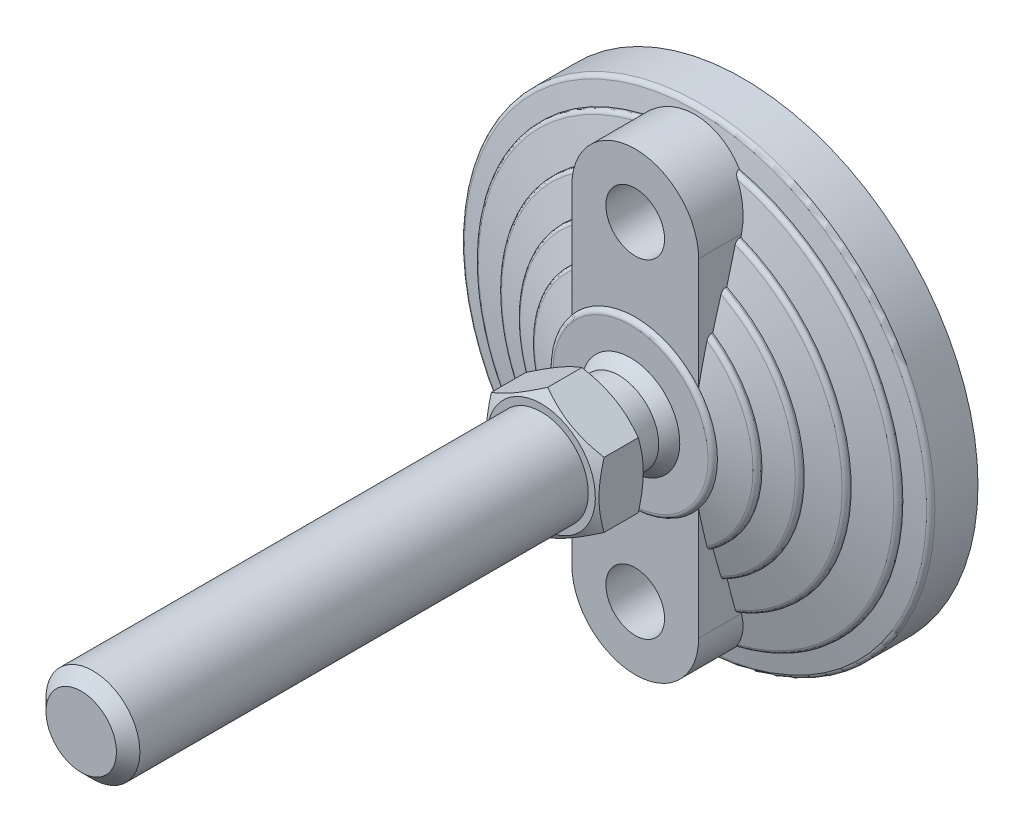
ISO-10303-21;
HEADER;
FILE_DESCRIPTION(('STEP AP214'),'2;1');
FILE_NAME('part.step','',(''),(''),'','','');
FILE_SCHEMA(('AUTOMOTIVE_DESIGN { 1 0 10303 214 1 1 1 1 }'));
ENDSEC;
DATA;
#1=APPLICATION_CONTEXT('core data for automotive mechanical design processes');
#2=APPLICATION_PROTOCOL_DEFINITION('international standard','automotive_design',2000,#1);
#3=PRODUCT_CONTEXT('',#1,'mechanical');
#4=PRODUCT('Part','Part','',(#3));
#5=PRODUCT_RELATED_PRODUCT_CATEGORY('part','',(#4));
#6=PRODUCT_DEFINITION_FORMATION('','',#4);
#7=PRODUCT_DEFINITION_CONTEXT('part definition',#1,'design');
#8=PRODUCT_DEFINITION('design','',#6,#7);
#9=PRODUCT_DEFINITION_SHAPE('','',#8);
#10=(LENGTH_UNIT() NAMED_UNIT(*) SI_UNIT(.MILLI.,.METRE.));
#11=(NAMED_UNIT(*) PLANE_ANGLE_UNIT() SI_UNIT($,.RADIAN.));
#12=(NAMED_UNIT(*) SI_UNIT($,.STERADIAN.) SOLID_ANGLE_UNIT());
#13=UNCERTAINTY_MEASURE_WITH_UNIT(LENGTH_MEASURE(1.E-05),#10,'distance_accuracy_value','');
#14=(GEOMETRIC_REPRESENTATION_CONTEXT(3) GLOBAL_UNCERTAINTY_ASSIGNED_CONTEXT((#13)) GLOBAL_UNIT_ASSIGNED_CONTEXT((#10,
#11,#12)) REPRESENTATION_CONTEXT('',''));
#15=CARTESIAN_POINT('',(0.,0.,0.));
#16=DIRECTION('',(0.,0.,1.));
#17=DIRECTION('',(1.,0.,0.));
#18=AXIS2_PLACEMENT_3D('',#15,#16,#17);
#19=CARTESIAN_POINT('',(-12.,14.022683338,33.));
#20=DIRECTION('',(0.,0.,1.));
#21=DIRECTION('',(0.,-1.,0.));
#22=AXIS2_PLACEMENT_3D('',#19,#20,#21);
#23=PLANE('',#22);
#24=CARTESIAN_POINT('',(0.,0.,33.));
#25=DIRECTION('',(0.,0.,-1.));
#26=DIRECTION('',(0.,1.,0.));
#27=AXIS2_PLACEMENT_3D('',#24,#25,#26);
#28=CIRCLE('',#27,11.5);
#29=CARTESIAN_POINT('',(0.,11.5,33.));
#30=VERTEX_POINT('',#29);
#31=EDGE_CURVE('E260',#30,#30,#28,.T.);
#32=ORIENTED_EDGE('',*,*,#31,.T.);
#33=EDGE_LOOP('',(#32));
#34=FACE_BOUND('',#33,.T.);
#35=CARTESIAN_POINT('',(0.,0.,33.));
#36=DIRECTION('',(0.,0.,-1.));
#37=DIRECTION('',(0.,1.,0.));
#38=AXIS2_PLACEMENT_3D('',#35,#36,#37);
#39=CIRCLE('',#38,8.5);
#40=CARTESIAN_POINT('',(0.,8.5,33.));
#41=VERTEX_POINT('',#40);
#42=EDGE_CURVE('E274',#41,#41,#39,.T.);
#43=ORIENTED_EDGE('',*,*,#42,.F.);
#44=EDGE_LOOP('',(#43));
#45=FACE_BOUND('',#44,.T.);
#46=ADVANCED_FACE('F14',(#34,#45),#23,.F.);
#47=CARTESIAN_POINT('',(0.,0.,33.));
#48=DIRECTION('',(0.,0.,-1.));
#49=DIRECTION('',(0.,1.,0.));
#50=AXIS2_PLACEMENT_3D('',#47,#48,#49);
#51=CYLINDRICAL_SURFACE('',#50,8.5);
#52=CARTESIAN_POINT('',(0.,0.,26.5));
#53=DIRECTION('',(0.,0.,-1.));
#54=DIRECTION('',(0.,1.,0.));
#55=AXIS2_PLACEMENT_3D('',#52,#53,#54);
#56=CIRCLE('',#55,8.5);
#57=CARTESIAN_POINT('',(0.,8.5,26.5));
#58=VERTEX_POINT('',#57);
#59=EDGE_CURVE('E1515',#58,#58,#56,.F.);
#60=ORIENTED_EDGE('',*,*,#59,.T.);
#61=EDGE_LOOP('',(#60));
#62=FACE_BOUND('',#61,.T.);
#63=ORIENTED_EDGE('',*,*,#42,.T.);
#64=EDGE_LOOP('',(#63));
#65=FACE_BOUND('',#64,.T.);
#66=ADVANCED_FACE('F928',(#62,#65),#51,.T.);
#67=CARTESIAN_POINT('',(-8.631599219,8.622532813,26.5));
#68=DIRECTION('',(0.,0.,1.));
#69=DIRECTION('',(0.,-1.,0.));
#70=AXIS2_PLACEMENT_3D('',#67,#68,#69);
#71=PLANE('',#70);
#72=CARTESIAN_POINT('',(0.,0.,26.5));
#73=DIRECTION('',(0.,0.,-1.));
#74=DIRECTION('',(0.,1.,0.));
#75=AXIS2_PLACEMENT_3D('',#72,#73,#74);
#76=CIRCLE('',#75,8.49107182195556);
#77=CARTESIAN_POINT('',(0.,8.49107182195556,26.5));
#78=VERTEX_POINT('',#77);
#79=EDGE_CURVE('E1513',#78,#78,#76,.T.);
#80=ORIENTED_EDGE('',*,*,#79,.F.);
#81=EDGE_LOOP('',(#80));
#82=FACE_BOUND('',#81,.T.);
#83=ORIENTED_EDGE('',*,*,#59,.F.);
#84=EDGE_LOOP('',(#83));
#85=FACE_BOUND('',#84,.T.);
#86=ADVANCED_FACE('F938',(#82,#85),#71,.F.);
#87=CARTESIAN_POINT('',(0.,0.,17.670266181));
#88=DIRECTION('',(0.,0.,-1.));
#89=DIRECTION('',(1.,0.,0.));
#90=AXIS2_PLACEMENT_3D('',#87,#88,#89);
#91=SPHERICAL_SURFACE('',#90,12.25);
#92=CARTESIAN_POINT('',(0.,0.,24.));
#93=DIRECTION('',(0.,0.,-1.));
#94=DIRECTION('',(0.,1.,0.));
#95=AXIS2_PLACEMENT_3D('',#92,#93,#94);
#96=CIRCLE('',#95,10.4879440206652);
#97=CARTESIAN_POINT('',(0.,10.4879440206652,24.));
#98=VERTEX_POINT('',#97);
#99=EDGE_CURVE('E1510',#98,#98,#96,.F.);
#100=ORIENTED_EDGE('',*,*,#99,.T.);
#101=EDGE_LOOP('',(#100));
#102=FACE_BOUND('',#101,.T.);
#103=ORIENTED_EDGE('',*,*,#79,.T.);
#104=EDGE_LOOP('',(#103));
#105=FACE_BOUND('',#104,.T.);
#106=ADVANCED_FACE('F948',(#102,#105),#91,.T.);
#107=CARTESIAN_POINT('',(0.,-35.,0.));
#108=DIRECTION('',(0.,0.,1.));
#109=DIRECTION('',(0.,-1.,0.));
#110=AXIS2_PLACEMENT_3D('',#107,#108,#109);
#111=CYLINDRICAL_SURFACE('',#110,6.25);
#112=CARTESIAN_POINT('',(0.,-35.,0.));
#113=DIRECTION('',(0.,0.,1.));
#114=DIRECTION('',(0.,-1.,0.));
#115=AXIS2_PLACEMENT_3D('',#112,#113,#114);
#116=CIRCLE('',#115,6.25);
#117=CARTESIAN_POINT('',(0.,-41.25,0.));
#118=VERTEX_POINT('',#117);
#119=EDGE_CURVE('E1507',#118,#118,#116,.F.);
#120=ORIENTED_EDGE('',*,*,#119,.T.);
#121=EDGE_LOOP('',(#120));
#122=FACE_BOUND('',#121,.T.);
#123=CARTESIAN_POINT('',(0.,-35.,23.));
#124=DIRECTION('',(0.,0.,1.));
#125=DIRECTION('',(0.,-1.,0.));
#126=AXIS2_PLACEMENT_3D('',#123,#124,#125);
#127=CIRCLE('',#126,6.25);
#128=CARTESIAN_POINT('',(0.,-41.25,23.));
#129=VERTEX_POINT('',#128);
#130=EDGE_CURVE('E521',#129,#129,#127,.T.);
#131=ORIENTED_EDGE('',*,*,#130,.T.);
#132=EDGE_LOOP('',(#131));
#133=FACE_BOUND('',#132,.T.);
#134=ADVANCED_FACE('F962',(#122,#133),#111,.F.);
#135=CARTESIAN_POINT('',(-16.755457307,-16.698,24.));
#136=DIRECTION('',(0.,0.,-1.));
#137=DIRECTION('',(0.,1.,0.));
#138=AXIS2_PLACEMENT_3D('',#135,#136,#137);
#139=PLANE('',#138);
#140=ORIENTED_EDGE('',*,*,#99,.F.);
#141=EDGE_LOOP('',(#140));
#142=FACE_BOUND('',#141,.T.);
#143=CARTESIAN_POINT('',(0.,0.,24.));
#144=DIRECTION('',(0.,0.,-1.));
#145=DIRECTION('',(0.,1.,0.));
#146=AXIS2_PLACEMENT_3D('',#143,#144,#145);
#147=CIRCLE('',#146,16.5);
#148=CARTESIAN_POINT('',(0.,16.5,24.));
#149=VERTEX_POINT('',#148);
#150=EDGE_CURVE('E520',#149,#149,#147,.T.);
#151=ORIENTED_EDGE('',*,*,#150,.F.);
#152=EDGE_LOOP('',(#151));
#153=FACE_BOUND('',#152,.T.);
#154=ADVANCED_FACE('F956',(#142,#153),#139,.F.);
#155=CARTESIAN_POINT('',(-50.774113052,50.6,0.));
#156=DIRECTION('',(0.,0.,1.));
#157=DIRECTION('',(0.,-1.,0.));
#158=AXIS2_PLACEMENT_3D('',#155,#156,#157);
#159=PLANE('',#158);
#160=ORIENTED_EDGE('',*,*,#119,.F.);
#161=EDGE_LOOP('',(#160));
#162=FACE_BOUND('',#161,.T.);
#163=CARTESIAN_POINT('',(0.,35.,0.));
#164=DIRECTION('',(0.,0.,1.));
#165=DIRECTION('',(0.,-1.,0.));
#166=AXIS2_PLACEMENT_3D('',#163,#164,#165);
#167=CIRCLE('',#166,6.25);
#168=CARTESIAN_POINT('',(0.,28.75,0.));
#169=VERTEX_POINT('',#168);
#170=EDGE_CURVE('E1254',#169,#169,#167,.T.);
#171=ORIENTED_EDGE('',*,*,#170,.T.);
#172=EDGE_LOOP('',(#171));
#173=FACE_BOUND('',#172,.T.);
#174=CARTESIAN_POINT('',(0.,0.,0.));
#175=DIRECTION('',(0.,0.,-1.));
#176=DIRECTION('',(1.,0.,0.));
#177=AXIS2_PLACEMENT_3D('',#174,#175,#176);
#178=CIRCLE('',#177,50.);
#179=CARTESIAN_POINT('',(50.,0.,0.));
#180=VERTEX_POINT('',#179);
#181=EDGE_CURVE('E538',#180,#180,#178,.F.);
#182=ORIENTED_EDGE('',*,*,#181,.F.);
#183=EDGE_LOOP('',(#182));
#184=FACE_BOUND('',#183,.T.);
#185=ADVANCED_FACE('F961',(#162,#173,#184),#159,.F.);
#186=CARTESIAN_POINT('',(0.,0.,23.));
#187=DIRECTION('',(0.,0.,-1.));
#188=DIRECTION('',(0.,1.,0.));
#189=AXIS2_PLACEMENT_3D('',#186,#187,#188);
#190=CONICAL_SURFACE('',#189,17.5,1.27229739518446);
#191=CARTESIAN_POINT('',(0.,0.,23.));
#192=DIRECTION('',(0.,0.,1.));
#193=DIRECTION('',(0.,-1.,0.));
#194=AXIS2_PLACEMENT_3D('',#191,#192,#193);
#195=CIRCLE('',#194,17.5);
#196=CARTESIAN_POINT('',(13.5000000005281,-11.1355287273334,22.999999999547));
#197=VERTEX_POINT('',#196);
#198=CARTESIAN_POINT('',(13.5000000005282,11.1355287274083,22.9999999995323));
#199=VERTEX_POINT('',#198);
#200=EDGE_CURVE('E517',#197,#199,#195,.T.);
#201=ORIENTED_EDGE('',*,*,#200,.F.);
#202=CARTESIAN_POINT('',(13.5,-18.9832672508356,21.2172043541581));
#203=CARTESIAN_POINT('',(13.5,-18.6579649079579,21.2987714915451));
#204=CARTESIAN_POINT('',(13.5,-18.3324976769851,21.3796813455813));
#205=CARTESIAN_POINT('',(13.5,-17.6811977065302,21.5400241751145));
#206=CARTESIAN_POINT('',(13.5,-17.3553649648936,21.6194571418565));
#207=CARTESIAN_POINT('',(13.5,-16.3773825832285,21.8552688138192));
#208=CARTESIAN_POINT('',(13.5,-15.7246371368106,22.0091884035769));
#209=CARTESIAN_POINT('',(13.5,-14.4172126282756,22.3088363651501));
#210=CARTESIAN_POINT('',(13.5,-13.7625334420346,22.4545641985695));
#211=CARTESIAN_POINT('',(13.5,-12.7787974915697,22.6654071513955));
#212=CARTESIAN_POINT('',(13.5,-12.4505717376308,22.7344021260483));
#213=CARTESIAN_POINT('',(13.5,-11.7935144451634,22.8694734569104));
#214=CARTESIAN_POINT('',(13.5,-11.4646828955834,22.9355497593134));
#215=CARTESIAN_POINT('',(13.5,-11.1355287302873,22.999999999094));
#216=B_SPLINE_CURVE_WITH_KNOTS('',3,(#202,#203,#204,#205,#206,#207,#208,#209,#210,#211,#212,
#213,#214,#215),.UNSPECIFIED.,.F.,.F.,(4,2,2,2,2,2,4),(0.,1.00611699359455,2.01223994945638,
4.02414047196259,6.03617307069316,7.04235800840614,8.04856148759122),.UNSPECIFIED.);
#217=CARTESIAN_POINT('',(13.5,-18.9832672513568,21.2172043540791));
#218=VERTEX_POINT('',#217);
#219=EDGE_CURVE('E1166',#218,#197,#216,.T.);
#220=ORIENTED_EDGE('',*,*,#219,.F.);
#221=CARTESIAN_POINT('',(3.16437848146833E-10,0.,21.217204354));
#222=DIRECTION('',(0.,0.,-1.));
#223=DIRECTION('',(0.,1.,0.));
#224=AXIS2_PLACEMENT_3D('',#221,#222,#223);
#225=CIRCLE('',#224,23.2940858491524);
#226=CARTESIAN_POINT('',(13.5,18.983267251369,21.2172043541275));
#227=VERTEX_POINT('',#226);
#228=EDGE_CURVE('E549',#227,#218,#225,.T.);
#229=ORIENTED_EDGE('',*,*,#228,.F.);
#230=CARTESIAN_POINT('',(13.5,11.1355287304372,22.9999999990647));
#231=CARTESIAN_POINT('',(13.5,11.4646828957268,22.9355497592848));
#232=CARTESIAN_POINT('',(13.5,11.7935144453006,22.8694734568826));
#233=CARTESIAN_POINT('',(13.5,12.4505717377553,22.7344021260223));
#234=CARTESIAN_POINT('',(13.5,12.7787974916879,22.6654071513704));
#235=CARTESIAN_POINT('',(13.5,13.762533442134,22.4545641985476));
#236=CARTESIAN_POINT('',(13.5,14.4172126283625,22.3088363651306));
#237=CARTESIAN_POINT('',(13.5,15.7246371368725,22.0091884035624));
#238=CARTESIAN_POINT('',(13.5,16.377382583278,21.8552688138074));
#239=CARTESIAN_POINT('',(13.5,17.3553649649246,21.619457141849));
#240=CARTESIAN_POINT('',(13.5,17.681197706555,21.5400241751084));
#241=CARTESIAN_POINT('',(13.5,18.3324976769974,21.3796813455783));
#242=CARTESIAN_POINT('',(13.5,18.6579649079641,21.2987714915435));
#243=CARTESIAN_POINT('',(13.5,18.9832672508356,21.2172043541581));
#244=B_SPLINE_CURVE_WITH_KNOTS('',3,(#230,#231,#232,#233,#234,#235,#236,#237,#238,#239,#240,
#241,#242,#243),.UNSPECIFIED.,.F.,.F.,(4,2,2,2,2,2,4),(0.,1.00620347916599,2.01238841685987,
4.02442101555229,6.03632153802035,7.0424444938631,8.04856148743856),.UNSPECIFIED.);
#245=EDGE_CURVE('E1247',#199,#227,#244,.T.);
#246=ORIENTED_EDGE('',*,*,#245,.F.);
#247=EDGE_LOOP('',(#201,#220,#229,#246));
#248=FACE_BOUND('',#247,.T.);
#249=ADVANCED_FACE('F974',(#248),#190,.T.);
#250=CARTESIAN_POINT('',(13.267303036,19.999466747,20.261425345));
#251=CARTESIAN_POINT('',(29.097194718,9.49818825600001,20.261425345));
#252=CARTESIAN_POINT('',(29.097194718,-9.49818825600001,20.261425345));
#253=CARTESIAN_POINT('',(13.267303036,-19.999466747,20.261425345));
#254=CARTESIAN_POINT('',(13.267303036,19.999466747,20.716888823));
#255=CARTESIAN_POINT('',(29.097194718,9.49818825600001,20.716888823));
#256=CARTESIAN_POINT('',(29.097194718,-9.49818825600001,20.716888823));
#257=CARTESIAN_POINT('',(13.267303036,-19.999466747,20.716888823));
#258=CARTESIAN_POINT('',(13.117718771,19.773979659,21.083258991));
#259=CARTESIAN_POINT('',(28.769133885,9.39109946,21.083258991));
#260=CARTESIAN_POINT('',(28.769133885,-9.39109946,21.083258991));
#261=CARTESIAN_POINT('',(13.117718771,-19.773979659,21.083258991));
#262=CARTESIAN_POINT('',(12.877070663,19.411220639,21.217204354));
#263=CARTESIAN_POINT('',(28.241356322,9.218817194,21.217204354));
#264=CARTESIAN_POINT('',(28.241356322,-9.218817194,21.217204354));
#265=CARTESIAN_POINT('',(12.877070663,-19.411220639,21.217204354));
#266=(BOUNDED_SURFACE() B_SPLINE_SURFACE(3,3,((#250,#251,#252,#253),(#254,#255,#256,#257),(#258,
#259,#260,#261),(#262,#263,#264,#265)),.UNSPECIFIED.,.F.,.F.,
.F.) B_SPLINE_SURFACE_WITH_KNOTS((4,4),(4,4),(0.,1.),(0.,1.),
.UNSPECIFIED.) GEOMETRIC_REPRESENTATION_ITEM() RATIONAL_B_SPLINE_SURFACE(((1.,0.701869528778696,
0.701869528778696,1.),(0.869593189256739,0.610340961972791,0.610340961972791,0.869593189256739),
(0.869593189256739,0.610340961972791,0.610340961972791,0.869593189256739),(1.,0.701869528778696,
0.701869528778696,1.))) REPRESENTATION_ITEM('') SURFACE());
#267=CARTESIAN_POINT('',(13.5,-19.8431348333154,20.2614253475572));
#268=CARTESIAN_POINT('',(13.5,-19.8431370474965,20.2860556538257));
#269=CARTESIAN_POINT('',(13.5,-19.8420333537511,20.3106726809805));
#270=CARTESIAN_POINT('',(13.5,-19.8376465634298,20.3597018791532));
#271=CARTESIAN_POINT('',(13.5,-19.8343643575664,20.3841141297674));
#272=CARTESIAN_POINT('',(13.5,-19.8213486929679,20.4565201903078));
#273=CARTESIAN_POINT('',(13.5,-19.8084453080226,20.5039784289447));
#274=CARTESIAN_POINT('',(13.5,-19.7748969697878,20.5959548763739));
#275=CARTESIAN_POINT('',(13.5,-19.7542611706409,20.6404764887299));
#276=CARTESIAN_POINT('',(13.5,-19.7062220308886,20.7257350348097));
#277=CARTESIAN_POINT('',(13.5,-19.6788120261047,20.7664681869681));
#278=CARTESIAN_POINT('',(13.5,-19.6164784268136,20.8458096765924));
#279=CARTESIAN_POINT('',(13.5,-19.5811980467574,20.8841360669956));
#280=CARTESIAN_POINT('',(13.5,-19.5055204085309,20.9553392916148));
#281=CARTESIAN_POINT('',(13.5,-19.465120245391,20.9882130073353));
#282=CARTESIAN_POINT('',(13.5,-19.3733614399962,21.0532792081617));
#283=CARTESIAN_POINT('',(13.5,-19.321293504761,21.0844693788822));
#284=CARTESIAN_POINT('',(13.5,-19.2133323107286,21.139175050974));
#285=CARTESIAN_POINT('',(13.5,-19.1574401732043,21.1626927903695));
#286=CARTESIAN_POINT('',(13.5,-19.0617819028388,21.1957297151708));
#287=CARTESIAN_POINT('',(13.5,-19.022719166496,21.207311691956));
#288=CARTESIAN_POINT('',(13.5,-18.9832672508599,21.2172043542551));
#289=B_SPLINE_CURVE_WITH_KNOTS('',3,(#267,#268,#269,#270,#271,#272,#273,#274,#275,#276,#277,
#278,#279,#280,#281,#282,#283,#284,#285,#286,#287,#288),.UNSPECIFIED.,.F.,.F.,(4,2,2,2,2,2,2,2,
2,2,4),(0.,0.073840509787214,0.147650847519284,0.29439860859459,0.440973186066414,
0.587692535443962,0.743377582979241,0.899151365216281,1.08055916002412,1.26191399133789,
1.38396481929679),.UNSPECIFIED.);
#290=CARTESIAN_POINT('',(13.5,-19.8431348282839,20.2614253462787));
#291=VERTEX_POINT('',#290);
#292=EDGE_CURVE('E1183',#291,#218,#289,.T.);
#293=CARTESIAN_POINT('',(0.,0.,20.261425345));
#294=DIRECTION('',(0.,0.,-1.));
#295=DIRECTION('',(0.,1.,0.));
#296=AXIS2_PLACEMENT_3D('',#293,#294,#295);
#297=CIRCLE('',#296,24.);
#298=CARTESIAN_POINT('',(13.5,19.8431348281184,20.2614253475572));
#299=VERTEX_POINT('',#298);
#300=EDGE_CURVE('E547',#299,#291,#297,.T.);
#301=CARTESIAN_POINT('',(13.5,18.9832672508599,21.2172043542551));
#302=CARTESIAN_POINT('',(13.5,19.0245269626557,21.2068474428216));
#303=CARTESIAN_POINT('',(13.5,19.0653049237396,21.1946763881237));
#304=CARTESIAN_POINT('',(13.5,19.1456358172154,21.1665827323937));
#305=CARTESIAN_POINT('',(13.5,19.1851861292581,21.1506526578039));
#306=CARTESIAN_POINT('',(13.5,19.3016874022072,21.0969581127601));
#307=CARTESIAN_POINT('',(13.5,19.3761277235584,21.0533765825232));
#308=CARTESIAN_POINT('',(13.5,19.4913457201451,20.9675664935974));
#309=CARTESIAN_POINT('',(13.5,19.5352290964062,20.9294496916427));
#310=CARTESIAN_POINT('',(13.5,19.6161219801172,20.8466003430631));
#311=CARTESIAN_POINT('',(13.5,19.6531483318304,20.801884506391));
#312=CARTESIAN_POINT('',(13.5,19.7189344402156,20.7060840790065));
#313=CARTESIAN_POINT('',(13.5,19.747615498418,20.6549449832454));
#314=CARTESIAN_POINT('',(13.5,19.7944064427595,20.5480322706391));
#315=CARTESIAN_POINT('',(13.5,19.8125331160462,20.4922661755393));
#316=CARTESIAN_POINT('',(13.5,19.8308153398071,20.4067306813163));
#317=CARTESIAN_POINT('',(13.5,19.8354249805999,20.3778585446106));
#318=CARTESIAN_POINT('',(13.5,19.8415861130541,20.3198066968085));
#319=CARTESIAN_POINT('',(13.5,19.8431393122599,20.2906271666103));
#320=CARTESIAN_POINT('',(13.5,19.8431348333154,20.2614253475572));
#321=B_SPLINE_CURVE_WITH_KNOTS('',3,(#301,#302,#303,#304,#305,#306,#307,#308,#309,#310,#311,
#312,#313,#314,#315,#316,#317,#318,#319,#320),.UNSPECIFIED.,.F.,.F.,(4,2,2,2,2,2,2,2,2,4),(0.,
0.127516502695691,0.25528869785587,0.511930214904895,0.685657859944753,0.858952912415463,
1.03383282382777,1.20843381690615,1.29600438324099,1.38352601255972),.UNSPECIFIED.);
#322=EDGE_CURVE('E1237',#227,#299,#321,.T.);
#323=ORIENTED_EDGE('',*,*,#228,.T.);
#324=ORIENTED_EDGE('',*,*,#292,.F.);
#325=ORIENTED_EDGE('',*,*,#300,.F.);
#326=ORIENTED_EDGE('',*,*,#322,.F.);
#327=EDGE_LOOP('',(#323,#324,#325,#326));
#328=FACE_BOUND('',#327,.T.);
#329=ADVANCED_FACE('F1089',(#328),#266,.T.);
#330=CARTESIAN_POINT('',(0.,0.,20.261425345));
#331=DIRECTION('',(0.,0.,-1.));
#332=DIRECTION('',(0.,1.,0.));
#333=AXIS2_PLACEMENT_3D('',#330,#331,#332);
#334=CYLINDRICAL_SURFACE('',#333,24.);
#335=CARTESIAN_POINT('',(0.,0.,20.));
#336=DIRECTION('',(0.,0.,-1.));
#337=DIRECTION('',(0.,1.,0.));
#338=AXIS2_PLACEMENT_3D('',#335,#336,#337);
#339=CIRCLE('',#338,24.);
#340=CARTESIAN_POINT('',(13.5,19.8431348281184,20.));
#341=VERTEX_POINT('',#340);
#342=CARTESIAN_POINT('',(13.5,-19.8431348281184,20.0000000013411));
#343=VERTEX_POINT('',#342);
#344=EDGE_CURVE('E545',#341,#343,#339,.T.);
#345=ORIENTED_EDGE('',*,*,#344,.F.);
#346=DIRECTION('',(0.,0.,-1.));
#347=VECTOR('',#346,1.);
#348=CARTESIAN_POINT('',(13.5,19.8431348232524,18.4084486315));
#349=LINE('',#348,#347);
#350=EDGE_CURVE('E1289',#299,#341,#349,.T.);
#351=ORIENTED_EDGE('',*,*,#350,.F.);
#352=ORIENTED_EDGE('',*,*,#300,.T.);
#353=DIRECTION('',(0.,0.,1.));
#354=VECTOR('',#353,1.);
#355=CARTESIAN_POINT('',(13.5,-19.8431348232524,18.4084486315));
#356=LINE('',#355,#354);
#357=EDGE_CURVE('E1281',#343,#291,#356,.T.);
#358=ORIENTED_EDGE('',*,*,#357,.F.);
#359=EDGE_LOOP('',(#345,#351,#352,#358));
#360=FACE_BOUND('',#359,.T.);
#361=ADVANCED_FACE('F1024',(#360),#334,.T.);
#362=CARTESIAN_POINT('',(0.,0.,20.));
#363=DIRECTION('',(0.,0.,-1.));
#364=DIRECTION('',(1.,0.,0.));
#365=AXIS2_PLACEMENT_3D('',#362,#363,#364);
#366=CONICAL_SURFACE('',#365,24.,1.24904577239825);
#367=ORIENTED_EDGE('',*,*,#344,.T.);
#368=CARTESIAN_POINT('',(13.5,-26.022897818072,18.2279240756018));
#369=CARTESIAN_POINT('',(13.5,-25.5091656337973,18.3799212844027));
#370=CARTESIAN_POINT('',(13.5,-24.9951778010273,18.5310587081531));
#371=CARTESIAN_POINT('',(13.5,-23.9666187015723,18.8312926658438));
#372=CARTESIAN_POINT('',(13.5,-23.4520474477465,18.9803892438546));
#373=CARTESIAN_POINT('',(13.5,-22.4222240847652,19.2762276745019));
#374=CARTESIAN_POINT('',(13.5,-21.9069719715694,19.422969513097));
#375=CARTESIAN_POINT('',(13.5,-20.8756730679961,19.713675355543));
#376=CARTESIAN_POINT('',(13.5,-20.3596262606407,19.8576392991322));
#377=CARTESIAN_POINT('',(13.5,-19.8431348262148,20.0000000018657));
#378=B_SPLINE_CURVE_WITH_KNOTS('',3,(#368,#369,#370,#371,#372,#373,#374,#375,#376,#377),
.UNSPECIFIED.,.F.,.F.,(4,2,2,2,4),(0.,1.60723934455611,3.21444392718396,4.82165809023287,
6.42890708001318),.UNSPECIFIED.);
#379=CARTESIAN_POINT('',(13.5,-26.0228978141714,18.2279240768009));
#380=VERTEX_POINT('',#379);
#381=EDGE_CURVE('E1191',#380,#343,#378,.T.);
#382=ORIENTED_EDGE('',*,*,#381,.F.);
#383=CARTESIAN_POINT('',(-5.51341958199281E-10,0.,18.227924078));
#384=DIRECTION('',(0.,0.,-1.));
#385=DIRECTION('',(0.,1.,0.));
#386=AXIS2_PLACEMENT_3D('',#383,#384,#385);
#387=CIRCLE('',#386,29.3162277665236);
#388=CARTESIAN_POINT('',(13.5,26.0228978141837,18.2279240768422));
#389=VERTEX_POINT('',#388);
#390=EDGE_CURVE('E544',#389,#380,#387,.T.);
#391=ORIENTED_EDGE('',*,*,#390,.F.);
#392=CARTESIAN_POINT('',(13.5000000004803,19.8431348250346,20.0000000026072));
#393=CARTESIAN_POINT('',(13.5000000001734,20.3596262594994,19.8576392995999));
#394=CARTESIAN_POINT('',(13.5000000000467,20.8756730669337,19.7136753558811));
#395=CARTESIAN_POINT('',(13.4999999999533,21.9069719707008,19.4229695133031));
#396=CARTESIAN_POINT('',(13.4999999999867,22.4222240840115,19.2762276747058));
#397=CARTESIAN_POINT('',(13.5000000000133,23.4520474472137,18.9803892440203));
#398=CARTESIAN_POINT('',(13.5000000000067,23.9666187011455,18.8312926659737));
#399=CARTESIAN_POINT('',(13.4999999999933,24.9951778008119,18.5310587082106));
#400=CARTESIAN_POINT('',(13.4999999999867,25.5091656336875,18.3799212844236));
#401=CARTESIAN_POINT('',(13.5,26.022897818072,18.2279240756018));
#402=B_SPLINE_CURVE_WITH_KNOTS('',3,(#392,#393,#394,#395,#396,#397,#398,#399,#400,#401),
.UNSPECIFIED.,.F.,.F.,(4,2,2,2,4),(0.,1.60724899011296,3.2144631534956,4.82166773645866,
6.42890708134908),.UNSPECIFIED.);
#403=EDGE_CURVE('E1223',#341,#389,#402,.T.);
#404=ORIENTED_EDGE('',*,*,#403,.F.);
#405=EDGE_LOOP('',(#367,#382,#391,#404));
#406=FACE_BOUND('',#405,.T.);
#407=ADVANCED_FACE('F1018',(#406),#366,.T.);
#408=CARTESIAN_POINT('',(13.143890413,26.967353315,17.27924078));
#409=CARTESIAN_POINT('',(38.983891,14.372934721,17.27924078));
#410=CARTESIAN_POINT('',(38.983891,-14.372934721,17.27924078));
#411=CARTESIAN_POINT('',(13.143890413,-26.967353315,17.27924078));
#412=CARTESIAN_POINT('',(13.143890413,26.967353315,17.725161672));
#413=CARTESIAN_POINT('',(38.983891,14.372934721,17.725161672));
#414=CARTESIAN_POINT('',(38.983891,-14.372934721,17.725161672));
#415=CARTESIAN_POINT('',(13.143890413,-26.967353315,17.725161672));
#416=CARTESIAN_POINT('',(13.029654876,26.732975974,18.086911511));
#417=CARTESIAN_POINT('',(38.645076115,14.248017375,18.086911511));
#418=CARTESIAN_POINT('',(38.645076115,-14.248017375,18.086911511));
#419=CARTESIAN_POINT('',(13.029654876,-26.732975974,18.086911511));
#420=CARTESIAN_POINT('',(12.844309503,26.352702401,18.227924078));
#421=CARTESIAN_POINT('',(38.095354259,14.045340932,18.227924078));
#422=CARTESIAN_POINT('',(38.095354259,-14.045340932,18.227924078));
#423=CARTESIAN_POINT('',(12.844309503,-26.352702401,18.227924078));
#424=(BOUNDED_SURFACE() B_SPLINE_SURFACE(3,3,((#408,#409,#410,#411),(#412,#413,#414,#415),(#416,
#417,#418,#419),(#420,#421,#422,#423)),.UNSPECIFIED.,.F.,.F.,
.F.) B_SPLINE_SURFACE_WITH_KNOTS((4,4),(4,4),(0.,1.),(0.,1.),
.UNSPECIFIED.) GEOMETRIC_REPRESENTATION_ITEM() RATIONAL_B_SPLINE_SURFACE(((1.,0.625419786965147,
0.625419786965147,1.),(0.874161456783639,0.546717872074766,0.546717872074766,0.874161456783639),
(0.874161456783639,0.546717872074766,0.546717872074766,0.874161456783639),(1.,0.625419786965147,
0.625419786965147,1.))) REPRESENTATION_ITEM('') SURFACE());
#425=CARTESIAN_POINT('',(13.5,-26.7908566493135,17.2792407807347));
#426=CARTESIAN_POINT('',(13.5,-26.7908579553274,17.3051907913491));
#427=CARTESIAN_POINT('',(13.5,-26.7897247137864,17.3311275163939));
#428=CARTESIAN_POINT('',(13.5,-26.7852140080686,17.3827974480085));
#429=CARTESIAN_POINT('',(13.5,-26.781837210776,17.4085307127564));
#430=CARTESIAN_POINT('',(13.5,-26.7684139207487,17.4849772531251));
#431=CARTESIAN_POINT('',(13.5,-26.7550740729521,17.5351491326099));
#432=CARTESIAN_POINT('',(13.5,-26.7202107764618,17.632486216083));
#433=CARTESIAN_POINT('',(13.5,-26.6986916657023,17.6796529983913));
#434=CARTESIAN_POINT('',(13.5,-26.648348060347,17.7699105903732));
#435=CARTESIAN_POINT('',(13.5,-26.6195218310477,17.8130004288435));
#436=CARTESIAN_POINT('',(13.5,-26.5542840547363,17.8959059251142));
#437=CARTESIAN_POINT('',(13.5,-26.5176080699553,17.9355124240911));
#438=CARTESIAN_POINT('',(13.5,-26.4386436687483,18.0087234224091));
#439=CARTESIAN_POINT('',(13.5,-26.3963509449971,18.0423232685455));
#440=CARTESIAN_POINT('',(13.5,-26.3267001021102,18.0898793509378));
#441=CARTESIAN_POINT('',(13.5,-26.3008113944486,18.106038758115));
#442=CARTESIAN_POINT('',(13.5,-26.2478537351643,18.1362297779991));
#443=CARTESIAN_POINT('',(13.5,-26.2207861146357,18.1502637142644));
#444=CARTESIAN_POINT('',(13.5,-26.1657188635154,18.176151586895));
#445=CARTESIAN_POINT('',(13.5,-26.1377218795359,18.1880111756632));
#446=CARTESIAN_POINT('',(13.5,-26.0808891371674,18.2095853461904));
#447=CARTESIAN_POINT('',(13.5,-26.0520527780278,18.2192983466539));
#448=CARTESIAN_POINT('',(13.5,-26.0228978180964,18.2279240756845));
#449=B_SPLINE_CURVE_WITH_KNOTS('',3,(#425,#426,#427,#428,#429,#430,#431,#432,#433,#434,#435,
#436,#437,#438,#439,#440,#441,#442,#443,#444,#445,#446,#447,#448),.UNSPECIFIED.,.F.,.F.,(4,2,2,
2,2,2,2,2,2,2,2,4),(0.,0.0777993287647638,0.155575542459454,0.310500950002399,0.465344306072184,
0.620224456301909,0.781511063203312,0.942922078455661,1.03439248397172,1.12576216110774,
1.21689083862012,1.30808642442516),.UNSPECIFIED.);
#450=CARTESIAN_POINT('',(13.5,-26.7908566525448,17.27924078));
#451=VERTEX_POINT('',#450);
#452=EDGE_CURVE('E1197',#451,#380,#449,.T.);
#453=CARTESIAN_POINT('',(0.,0.,17.27924078));
#454=DIRECTION('',(0.,0.,-1.));
#455=DIRECTION('',(0.,1.,0.));
#456=AXIS2_PLACEMENT_3D('',#453,#454,#455);
#457=CIRCLE('',#456,30.);
#458=CARTESIAN_POINT('',(13.5,26.7908566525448,17.2792407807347));
#459=VERTEX_POINT('',#458);
#460=EDGE_CURVE('E542',#459,#451,#457,.T.);
#461=CARTESIAN_POINT('',(13.5,26.0228978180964,18.2279240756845));
#462=CARTESIAN_POINT('',(13.5,26.0845570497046,18.2097134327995));
#463=CARTESIAN_POINT('',(13.5,26.1448460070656,18.1865640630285));
#464=CARTESIAN_POINT('',(13.5,26.2611194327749,18.1305926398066));
#465=CARTESIAN_POINT('',(13.5,26.3170802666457,18.0977216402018));
#466=CARTESIAN_POINT('',(13.5,26.422621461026,18.022592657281));
#467=CARTESIAN_POINT('',(13.5,26.4721821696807,17.9803067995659));
#468=CARTESIAN_POINT('',(13.5,26.5625156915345,17.887307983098));
#469=CARTESIAN_POINT('',(13.5,26.6033065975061,17.8366127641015));
#470=CARTESIAN_POINT('',(13.5,26.6708532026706,17.7331354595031));
#471=CARTESIAN_POINT('',(13.5,26.6985518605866,17.68096918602));
#472=CARTESIAN_POINT('',(13.5,26.743619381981,17.5723560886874));
#473=CARTESIAN_POINT('',(13.5,26.7610021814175,17.5159151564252));
#474=CARTESIAN_POINT('',(13.5,26.7787549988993,17.4289072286));
#475=CARTESIAN_POINT('',(13.5,26.7832876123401,17.399138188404));
#476=CARTESIAN_POINT('',(13.5,26.78933789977,17.3393328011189));
#477=CARTESIAN_POINT('',(13.5,26.7908592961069,17.3092968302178));
#478=CARTESIAN_POINT('',(13.5,26.7908566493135,17.2792407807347));
#479=B_SPLINE_CURVE_WITH_KNOTS('',3,(#461,#462,#463,#464,#465,#466,#467,#468,#469,#470,#471,
#472,#473,#474,#475,#476,#477,#478),.UNSPECIFIED.,.F.,.F.,(4,2,2,2,2,2,2,2,4),(0.,
0.192810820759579,0.386609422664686,0.580989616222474,0.774964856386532,0.951184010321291,
1.1271645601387,1.21736691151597,1.30745768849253),.UNSPECIFIED.);
#480=EDGE_CURVE('E1215',#389,#459,#479,.T.);
#481=ORIENTED_EDGE('',*,*,#390,.T.);
#482=ORIENTED_EDGE('',*,*,#452,.F.);
#483=ORIENTED_EDGE('',*,*,#460,.F.);
#484=ORIENTED_EDGE('',*,*,#480,.F.);
#485=EDGE_LOOP('',(#481,#482,#483,#484));
#486=FACE_BOUND('',#485,.T.);
#487=ADVANCED_FACE('F1023',(#486),#424,.T.);
#488=CARTESIAN_POINT('',(0.,0.,17.27924078));
#489=DIRECTION('',(0.,0.,-1.));
#490=DIRECTION('',(0.,1.,0.));
#491=AXIS2_PLACEMENT_3D('',#488,#489,#490);
#492=CYLINDRICAL_SURFACE('',#491,30.);
#493=CARTESIAN_POINT('',(0.,0.,17.));
#494=DIRECTION('',(0.,0.,-1.));
#495=DIRECTION('',(0.,1.,0.));
#496=AXIS2_PLACEMENT_3D('',#493,#494,#495);
#497=CIRCLE('',#496,30.);
#498=CARTESIAN_POINT('',(13.5,26.7908566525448,17.));
#499=VERTEX_POINT('',#498);
#500=CARTESIAN_POINT('',(13.5,-26.7908566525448,16.9999999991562));
#501=VERTEX_POINT('',#500);
#502=EDGE_CURVE('E540',#499,#501,#497,.T.);
#503=ORIENTED_EDGE('',*,*,#502,.F.);
#504=DIRECTION('',(0.,0.,-1.));
#505=VECTOR('',#504,1.);
#506=CARTESIAN_POINT('',(13.5,26.7908566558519,18.4084486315));
#507=LINE('',#506,#505);
#508=EDGE_CURVE('E1222',#459,#499,#507,.T.);
#509=ORIENTED_EDGE('',*,*,#508,.F.);
#510=ORIENTED_EDGE('',*,*,#460,.T.);
#511=DIRECTION('',(0.,0.,1.));
#512=VECTOR('',#511,1.);
#513=CARTESIAN_POINT('',(13.5,-26.7908566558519,18.4084486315));
#514=LINE('',#513,#512);
#515=EDGE_CURVE('E1203',#501,#451,#514,.T.);
#516=ORIENTED_EDGE('',*,*,#515,.F.);
#517=EDGE_LOOP('',(#503,#509,#510,#516));
#518=FACE_BOUND('',#517,.T.);
#519=ADVANCED_FACE('F1036',(#518),#492,.T.);
#520=CARTESIAN_POINT('',(0.,0.,17.));
#521=DIRECTION('',(0.,0.,-1.));
#522=DIRECTION('',(0.,1.,0.));
#523=AXIS2_PLACEMENT_3D('',#520,#521,#522);
#524=CONICAL_SURFACE('',#523,30.,1.29249666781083);
#525=ORIENTED_EDGE('',*,*,#502,.T.);
#526=CARTESIAN_POINT('',(13.5000000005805,-33.6690568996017,15.2072225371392));
#527=CARTESIAN_POINT('',(13.5000000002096,-33.0965095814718,15.3590521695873));
#528=CARTESIAN_POINT('',(13.5000000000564,-32.5238313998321,15.5103895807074));
#529=CARTESIAN_POINT('',(13.4999999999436,-31.3781752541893,15.8119124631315));
#530=CARTESIAN_POINT('',(13.4999999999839,-30.8051972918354,15.9620979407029));
#531=CARTESIAN_POINT('',(13.5000000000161,-29.6588964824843,16.2611513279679));
#532=CARTESIAN_POINT('',(13.5000000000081,-29.0855736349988,16.4100192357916));
#533=CARTESIAN_POINT('',(13.4999999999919,-27.9385277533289,16.7062178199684));
#534=CARTESIAN_POINT('',(13.4999999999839,-27.3648047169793,16.8535484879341));
#535=CARTESIAN_POINT('',(13.5,-26.7908566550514,16.9999999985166));
#536=B_SPLINE_CURVE_WITH_KNOTS('',3,(#526,#527,#528,#529,#530,#531,#532,#533,#534,#535),
.UNSPECIFIED.,.F.,.F.,(4,2,2,2,4),(0.,1.7770100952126,3.55401051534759,5.33101345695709,
7.10802608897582),.UNSPECIFIED.);
#537=CARTESIAN_POINT('',(13.5,-33.6690569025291,15.2072225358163));
#538=VERTEX_POINT('',#537);
#539=EDGE_CURVE('E1159',#538,#501,#536,.T.);
#540=ORIENTED_EDGE('',*,*,#539,.F.);
#541=CARTESIAN_POINT('',(3.08438170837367E-10,0.,15.207222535));
#542=DIRECTION('',(0.,0.,-1.));
#543=DIRECTION('',(1.,0.,0.));
#544=AXIS2_PLACEMENT_3D('',#541,#542,#543);
#545=CIRCLE('',#544,36.2747211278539);
#546=CARTESIAN_POINT('',(13.5,33.6690569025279,15.2072225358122));
#547=VERTEX_POINT('',#546);
#548=EDGE_CURVE('E539',#547,#538,#545,.T.);
#549=ORIENTED_EDGE('',*,*,#548,.F.);
#550=CARTESIAN_POINT('',(13.5000000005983,26.790856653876,16.9999999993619));
#551=CARTESIAN_POINT('',(13.5000000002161,27.3648047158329,16.85354848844));
#552=CARTESIAN_POINT('',(13.5000000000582,27.9385277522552,16.7062178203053));
#553=CARTESIAN_POINT('',(13.4999999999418,29.0855736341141,16.4100192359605));
#554=CARTESIAN_POINT('',(13.4999999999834,29.6588964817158,16.2611513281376));
#555=CARTESIAN_POINT('',(13.5000000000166,30.8051972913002,15.9620979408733));
#556=CARTESIAN_POINT('',(13.5000000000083,31.378175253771,15.8119124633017));
#557=CARTESIAN_POINT('',(13.4999999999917,32.523831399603,15.5103895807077));
#558=CARTESIAN_POINT('',(13.4999999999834,33.0965095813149,15.359052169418));
#559=CARTESIAN_POINT('',(13.5,33.6690568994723,15.2072225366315));
#560=B_SPLINE_CURVE_WITH_KNOTS('',3,(#550,#551,#552,#553,#554,#555,#556,#557,#558,#559),
.UNSPECIFIED.,.F.,.F.,(4,2,2,2,4),(0.,1.77701263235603,3.55401557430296,5.3310159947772,
7.10802609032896),.UNSPECIFIED.);
#561=EDGE_CURVE('E1224',#499,#547,#560,.T.);
#562=ORIENTED_EDGE('',*,*,#561,.F.);
#563=EDGE_LOOP('',(#525,#540,#549,#562));
#564=FACE_BOUND('',#563,.T.);
#565=ADVANCED_FACE('F1003',(#564),#524,.T.);
#566=CARTESIAN_POINT('',(13.003667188,34.639639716,14.245698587));
#567=CARTESIAN_POINT('',(51.0914438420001,20.341547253,14.245698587));
#568=CARTESIAN_POINT('',(51.0914438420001,-20.341547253,14.245698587));
#569=CARTESIAN_POINT('',(13.003667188,-34.639639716,14.245698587));
#570=CARTESIAN_POINT('',(13.003667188,34.639639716,14.709515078));
#571=CARTESIAN_POINT('',(51.091443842,20.341547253,14.709515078));
#572=CARTESIAN_POINT('',(51.091443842,-20.341547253,14.709515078));
#573=CARTESIAN_POINT('',(13.003667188,-34.639639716,14.709515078));
#574=CARTESIAN_POINT('',(12.905504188,34.378149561,15.079802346));
#575=CARTESIAN_POINT('',(50.7057611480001,20.187991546,15.079802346));
#576=CARTESIAN_POINT('',(50.7057611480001,-20.187991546,15.079802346));
#577=CARTESIAN_POINT('',(12.905504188,-34.378149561,15.079802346));
#578=CARTESIAN_POINT('',(12.748767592,33.960628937,15.207222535));
#579=CARTESIAN_POINT('',(50.089942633,19.942809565,15.207222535));
#580=CARTESIAN_POINT('',(50.089942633,-19.942809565,15.207222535));
#581=CARTESIAN_POINT('',(12.748767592,-33.960628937,15.207222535));
#582=(BOUNDED_SURFACE() B_SPLINE_SURFACE(3,3,((#566,#567,#568,#569),(#570,#571,#572,#573),(#574,
#575,#576,#577),(#578,#579,#580,#581)),.UNSPECIFIED.,.F.,.F.,
.F.) B_SPLINE_SURFACE_WITH_KNOTS((4,4),(4,4),(0.,1.),(0.,1.),
.UNSPECIFIED.) GEOMETRIC_REPRESENTATION_ITEM() RATIONAL_B_SPLINE_SURFACE(((1.,0.56763364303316,
0.56763364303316,1.),(0.865565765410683,0.491324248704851,0.491324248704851,0.865565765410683),
(0.865565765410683,0.491324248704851,0.491324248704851,0.865565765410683),(1.,0.56763364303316,
0.56763364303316,1.))) REPRESENTATION_ITEM('') SURFACE());
#583=CARTESIAN_POINT('',(13.5,-34.4492380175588,14.2456985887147));
#584=CARTESIAN_POINT('',(13.5,-34.4492388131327,14.2724185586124));
#585=CARTESIAN_POINT('',(13.5,-34.4480869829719,14.2991252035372));
#586=CARTESIAN_POINT('',(13.5,-34.4434985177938,14.3523366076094));
#587=CARTESIAN_POINT('',(13.5,-34.4400623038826,14.3788414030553));
#588=CARTESIAN_POINT('',(13.5,-34.42638545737,14.457641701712));
#589=CARTESIAN_POINT('',(13.5,-34.4127763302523,14.5093910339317));
#590=CARTESIAN_POINT('',(13.5,-34.3771048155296,14.6098360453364));
#591=CARTESIAN_POINT('',(13.5,-34.3550440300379,14.6585323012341));
#592=CARTESIAN_POINT('',(13.5,-34.3032810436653,14.7516688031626));
#593=CARTESIAN_POINT('',(13.5,-34.2735788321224,14.7961090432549));
#594=CARTESIAN_POINT('',(13.5,-34.2066078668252,14.8808807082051));
#595=CARTESIAN_POINT('',(13.5,-34.1691521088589,14.9210639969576));
#596=CARTESIAN_POINT('',(13.5,-34.0883643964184,14.9950807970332));
#597=CARTESIAN_POINT('',(13.5,-34.045025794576,15.0289070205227));
#598=CARTESIAN_POINT('',(13.5,-33.9488589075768,15.0927883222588));
#599=CARTESIAN_POINT('',(13.5,-33.8955116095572,15.1220613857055));
#600=CARTESIAN_POINT('',(13.5,-33.7848588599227,15.1715344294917));
#601=CARTESIAN_POINT('',(13.5,-33.727559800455,15.1917486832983));
#602=CARTESIAN_POINT('',(13.5,-33.6690568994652,15.2072225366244));
#603=B_SPLINE_CURVE_WITH_KNOTS('',3,(#583,#584,#585,#586,#587,#588,#589,#590,#591,#592,#593,
#594,#595,#596,#597,#598,#599,#600,#601,#602),.UNSPECIFIED.,.F.,.F.,(4,2,2,2,2,2,2,2,2,4),(0.,
0.0801088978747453,0.160203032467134,0.319894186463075,0.479555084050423,0.639216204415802,
0.803305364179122,0.967581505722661,1.14930395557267,1.33073905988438),.UNSPECIFIED.);
#604=CARTESIAN_POINT('',(13.5,-34.4492380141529,14.2456985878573));
#605=VERTEX_POINT('',#604);
#606=EDGE_CURVE('E1151',#605,#538,#603,.T.);
#607=CARTESIAN_POINT('',(0.,0.,14.245698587));
#608=DIRECTION('',(0.,0.,-1.));
#609=DIRECTION('',(0.,1.,0.));
#610=AXIS2_PLACEMENT_3D('',#607,#608,#609);
#611=CIRCLE('',#610,37.);
#612=CARTESIAN_POINT('',(13.5,34.4492380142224,14.2456985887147));
#613=VERTEX_POINT('',#612);
#614=EDGE_CURVE('E536',#613,#605,#611,.T.);
#615=CARTESIAN_POINT('',(13.5,33.6690568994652,15.2072225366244));
#616=CARTESIAN_POINT('',(13.5,33.7285004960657,15.1914984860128));
#617=CARTESIAN_POINT('',(13.5,33.7866931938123,15.1708859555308));
#618=CARTESIAN_POINT('',(13.5,33.8990439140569,15.1203027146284));
#619=CARTESIAN_POINT('',(13.5,33.9531903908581,15.09030640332));
#620=CARTESIAN_POINT('',(13.5,34.0556677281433,15.0214004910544));
#621=CARTESIAN_POINT('',(13.5,34.1039872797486,14.9824739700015));
#622=CARTESIAN_POINT('',(13.5,34.192879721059,14.8966704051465));
#623=CARTESIAN_POINT('',(13.5,34.2334627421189,14.8498039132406));
#624=CARTESIAN_POINT('',(13.5,34.3033335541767,14.7520897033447));
#625=CARTESIAN_POINT('',(13.5,34.3331130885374,14.7015938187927));
#626=CARTESIAN_POINT('',(13.5,34.3830581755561,14.5960457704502));
#627=CARTESIAN_POINT('',(13.5,34.4032299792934,14.5409965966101));
#628=CARTESIAN_POINT('',(13.5,34.4284319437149,14.4456451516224));
#629=CARTESIAN_POINT('',(13.5,34.4362159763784,14.4060504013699));
#630=CARTESIAN_POINT('',(13.5,34.4466250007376,14.3262117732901));
#631=CARTESIAN_POINT('',(13.5,34.4492528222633,14.2859682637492));
#632=CARTESIAN_POINT('',(13.5,34.4492380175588,14.2456985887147));
#633=B_SPLINE_CURVE_WITH_KNOTS('',3,(#615,#616,#617,#618,#619,#620,#621,#622,#623,#624,#625,
#626,#627,#628,#629,#630,#631,#632),.UNSPECIFIED.,.F.,.F.,(4,2,2,2,2,2,2,2,4),(0.,
0.184329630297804,0.369166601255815,0.554356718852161,0.739302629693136,0.914257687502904,
1.08909875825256,1.2098399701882,1.33051489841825),.UNSPECIFIED.);
#634=EDGE_CURVE('E1144',#547,#613,#633,.T.);
#635=ORIENTED_EDGE('',*,*,#548,.T.);
#636=ORIENTED_EDGE('',*,*,#606,.F.);
#637=ORIENTED_EDGE('',*,*,#614,.F.);
#638=ORIENTED_EDGE('',*,*,#634,.F.);
#639=EDGE_LOOP('',(#635,#636,#637,#638));
#640=FACE_BOUND('',#639,.T.);
#641=ADVANCED_FACE('F998',(#640),#582,.T.);
#642=CARTESIAN_POINT('',(0.,0.,14.245698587));
#643=DIRECTION('',(0.,0.,-1.));
#644=DIRECTION('',(1.,0.,0.));
#645=AXIS2_PLACEMENT_3D('',#642,#643,#644);
#646=CYLINDRICAL_SURFACE('',#645,37.);
#647=CARTESIAN_POINT('',(0.,0.,14.));
#648=DIRECTION('',(0.,0.,-1.));
#649=DIRECTION('',(0.,1.,0.));
#650=AXIS2_PLACEMENT_3D('',#647,#648,#649);
#651=CIRCLE('',#650,37.);
#652=CARTESIAN_POINT('',(13.5,34.4492380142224,14.000000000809));
#653=VERTEX_POINT('',#652);
#654=CARTESIAN_POINT('',(13.5,-34.4492380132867,14.0000000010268));
#655=VERTEX_POINT('',#654);
#656=EDGE_CURVE('E533',#653,#655,#651,.T.);
#657=ORIENTED_EDGE('',*,*,#656,.F.);
#658=DIRECTION('',(0.,0.,-1.));
#659=VECTOR('',#658,1.);
#660=CARTESIAN_POINT('',(13.5,34.4492380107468,18.4084486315));
#661=LINE('',#660,#659);
#662=EDGE_CURVE('E1285',#613,#653,#661,.T.);
#663=ORIENTED_EDGE('',*,*,#662,.F.);
#664=ORIENTED_EDGE('',*,*,#614,.T.);
#665=DIRECTION('',(0.,0.,1.));
#666=VECTOR('',#665,1.);
#667=CARTESIAN_POINT('',(13.5,-34.4492380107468,18.4084486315));
#668=LINE('',#667,#666);
#669=EDGE_CURVE('E1160',#655,#605,#668,.T.);
#670=ORIENTED_EDGE('',*,*,#669,.F.);
#671=EDGE_LOOP('',(#657,#663,#664,#670));
#672=FACE_BOUND('',#671,.T.);
#673=ADVANCED_FACE('F1002',(#672),#646,.T.);
#674=CARTESIAN_POINT('',(0.,0.,9.180196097));
#675=DIRECTION('',(0.,0.,-1.));
#676=DIRECTION('',(1.,0.,0.));
#677=AXIS2_PLACEMENT_3D('',#674,#675,#676);
#678=CYLINDRICAL_SURFACE('',#677,50.);
#679=CARTESIAN_POINT('',(0.,0.,9.180196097));
#680=DIRECTION('',(0.,0.,1.));
#681=DIRECTION('',(0.,-1.,0.));
#682=AXIS2_PLACEMENT_3D('',#679,#680,#681);
#683=CIRCLE('',#682,50.);
#684=CARTESIAN_POINT('',(0.,-50.,9.180196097));
#685=VERTEX_POINT('',#684);
#686=EDGE_CURVE('E371',#685,#685,#683,.T.);
#687=ORIENTED_EDGE('',*,*,#686,.F.);
#688=EDGE_LOOP('',(#687));
#689=FACE_BOUND('',#688,.T.);
#690=ORIENTED_EDGE('',*,*,#181,.T.);
#691=EDGE_LOOP('',(#690));
#692=FACE_BOUND('',#691,.T.);
#693=ADVANCED_FACE('F988',(#689,#692),#678,.T.);
#694=CARTESIAN_POINT('',(13.5,-35.,13.816897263));
#695=DIRECTION('',(1.,0.,0.));
#696=DIRECTION('',(0.,1.,0.));
#697=AXIS2_PLACEMENT_3D('',#694,#695,#696);
#698=PLANE('',#697);
#699=ORIENTED_EDGE('',*,*,#357,.T.);
#700=ORIENTED_EDGE('',*,*,#292,.T.);
#701=ORIENTED_EDGE('',*,*,#219,.T.);
#702=DIRECTION('',(0.,-1.,0.));
#703=VECTOR('',#702,1.);
#704=CARTESIAN_POINT('',(13.5,-29.840990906,23.));
#705=LINE('',#704,#703);
#706=CARTESIAN_POINT('',(13.5,-35.0000000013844,23.));
#707=VERTEX_POINT('',#706);
#708=EDGE_CURVE('E1272',#197,#707,#705,.T.);
#709=ORIENTED_EDGE('',*,*,#708,.T.);
#710=DIRECTION('',(0.,0.,1.));
#711=VECTOR('',#710,1.);
#712=CARTESIAN_POINT('',(13.5,-35.0000000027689,16.6119));
#713=LINE('',#712,#711);
#714=CARTESIAN_POINT('',(13.5,-34.9999999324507,13.8716672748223));
#715=VERTEX_POINT('',#714);
#716=EDGE_CURVE('E370',#715,#707,#713,.T.);
#717=ORIENTED_EDGE('',*,*,#716,.F.);
#718=CARTESIAN_POINT('',(13.4999999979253,-34.4492380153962,13.9999999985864));
#719=CARTESIAN_POINT('',(13.4999999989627,-34.5410365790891,13.9786323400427));
#720=CARTESIAN_POINT('',(13.4999999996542,-34.632832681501,13.9572541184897));
#721=CARTESIAN_POINT('',(13.5000000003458,-34.8164199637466,13.9144765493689));
#722=CARTESIAN_POINT('',(13.5000000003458,-34.9082111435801,13.8930772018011));
#723=CARTESIAN_POINT('',(13.5,-34.9999998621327,13.871667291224));
#724=B_SPLINE_CURVE_WITH_KNOTS('',3,(#718,#719,#720,#721,#722,#723),.UNSPECIFIED.,.F.,.F.,(4,2,
4),(0.,0.282757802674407,0.565515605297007),.UNSPECIFIED.);
#725=EDGE_CURVE('E1175',#655,#715,#724,.T.);
#726=ORIENTED_EDGE('',*,*,#725,.F.);
#727=ORIENTED_EDGE('',*,*,#669,.T.);
#728=ORIENTED_EDGE('',*,*,#606,.T.);
#729=ORIENTED_EDGE('',*,*,#539,.T.);
#730=ORIENTED_EDGE('',*,*,#515,.T.);
#731=ORIENTED_EDGE('',*,*,#452,.T.);
#732=ORIENTED_EDGE('',*,*,#381,.T.);
#733=EDGE_LOOP('',(#699,#700,#701,#709,#717,#726,#727,#728,#729,#730,#731,#732));
#734=FACE_BOUND('',#733,.T.);
#735=ADVANCED_FACE('F982',(#734),#698,.T.);
#736=CARTESIAN_POINT('',(-13.5,-48.770918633,23.));
#737=DIRECTION('',(0.,0.,-1.));
#738=DIRECTION('',(0.,1.,0.));
#739=AXIS2_PLACEMENT_3D('',#736,#737,#738);
#740=PLANE('',#739);
#741=ORIENTED_EDGE('',*,*,#130,.F.);
#742=EDGE_LOOP('',(#741));
#743=FACE_BOUND('',#742,.T.);
#744=ORIENTED_EDGE('',*,*,#708,.F.);
#745=CARTESIAN_POINT('',(0.,0.,23.));
#746=DIRECTION('',(0.,0.,-1.));
#747=DIRECTION('',(0.,1.,0.));
#748=AXIS2_PLACEMENT_3D('',#745,#746,#747);
#749=CIRCLE('',#748,17.5);
#750=CARTESIAN_POINT('',(-13.4999999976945,-11.1355287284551,23.));
#751=VERTEX_POINT('',#750);
#752=EDGE_CURVE('E1268',#751,#197,#749,.F.);
#753=ORIENTED_EDGE('',*,*,#752,.F.);
#754=DIRECTION('',(0.,1.,0.));
#755=VECTOR('',#754,1.);
#756=CARTESIAN_POINT('',(-13.5,-22.996170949,23.));
#757=LINE('',#756,#755);
#758=CARTESIAN_POINT('',(-13.5,-35.,23.));
#759=VERTEX_POINT('',#758);
#760=EDGE_CURVE('E501',#759,#751,#757,.T.);
#761=ORIENTED_EDGE('',*,*,#760,.F.);
#762=CARTESIAN_POINT('',(0.,-35.,23.));
#763=DIRECTION('',(0.,0.,-1.));
#764=DIRECTION('',(0.,1.,0.));
#765=AXIS2_PLACEMENT_3D('',#762,#763,#764);
#766=CIRCLE('',#765,13.5);
#767=EDGE_CURVE('E372',#707,#759,#766,.T.);
#768=ORIENTED_EDGE('',*,*,#767,.F.);
#769=EDGE_LOOP('',(#744,#753,#761,#768));
#770=FACE_BOUND('',#769,.T.);
#771=ADVANCED_FACE('F987',(#743,#770),#740,.F.);
#772=CARTESIAN_POINT('',(0.,0.,23.));
#773=DIRECTION('',(0.,0.,-1.));
#774=DIRECTION('',(0.,1.,0.));
#775=AXIS2_PLACEMENT_3D('',#772,#773,#774);
#776=TOROIDAL_SURFACE('',#775,16.5,1.);
#777=ORIENTED_EDGE('',*,*,#150,.T.);
#778=EDGE_LOOP('',(#777));
#779=FACE_BOUND('',#778,.T.);
#780=CARTESIAN_POINT('',(0.,0.,23.));
#781=DIRECTION('',(0.,0.,-1.));
#782=DIRECTION('',(0.,1.,0.));
#783=AXIS2_PLACEMENT_3D('',#780,#781,#782);
#784=CIRCLE('',#783,17.5);
#785=CARTESIAN_POINT('',(-13.4999999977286,11.1355287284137,23.));
#786=VERTEX_POINT('',#785);
#787=EDGE_CURVE('E491',#751,#786,#784,.T.);
#788=ORIENTED_EDGE('',*,*,#787,.F.);
#789=ORIENTED_EDGE('',*,*,#752,.T.);
#790=ORIENTED_EDGE('',*,*,#200,.T.);
#791=CARTESIAN_POINT('',(0.,0.,23.));
#792=DIRECTION('',(0.,0.,-1.));
#793=DIRECTION('',(0.,1.,0.));
#794=AXIS2_PLACEMENT_3D('',#791,#792,#793);
#795=CIRCLE('',#794,17.5);
#796=EDGE_CURVE('E1307',#199,#786,#795,.F.);
#797=ORIENTED_EDGE('',*,*,#796,.T.);
#798=EDGE_LOOP('',(#788,#789,#790,#797));
#799=FACE_BOUND('',#798,.T.);
#800=ADVANCED_FACE('F1060',(#779,#799),#776,.T.);
#801=CARTESIAN_POINT('',(0.,35.,0.));
#802=DIRECTION('',(0.,0.,1.));
#803=DIRECTION('',(0.,-1.,0.));
#804=AXIS2_PLACEMENT_3D('',#801,#802,#803);
#805=CYLINDRICAL_SURFACE('',#804,6.25);
#806=ORIENTED_EDGE('',*,*,#170,.F.);
#807=EDGE_LOOP('',(#806));
#808=FACE_BOUND('',#807,.T.);
#809=CARTESIAN_POINT('',(0.,35.,23.));
#810=DIRECTION('',(0.,0.,1.));
#811=DIRECTION('',(0.,-1.,0.));
#812=AXIS2_PLACEMENT_3D('',#809,#810,#811);
#813=CIRCLE('',#812,6.25);
#814=CARTESIAN_POINT('',(0.,28.75,23.));
#815=VERTEX_POINT('',#814);
#816=EDGE_CURVE('E335',#815,#815,#813,.T.);
#817=ORIENTED_EDGE('',*,*,#816,.T.);
#818=EDGE_LOOP('',(#817));
#819=FACE_BOUND('',#818,.T.);
#820=ADVANCED_FACE('F344',(#808,#819),#805,.F.);
#821=CARTESIAN_POINT('',(13.5,10.992341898,13.816897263));
#822=DIRECTION('',(1.,0.,0.));
#823=DIRECTION('',(0.,1.,0.));
#824=AXIS2_PLACEMENT_3D('',#821,#822,#823);
#825=PLANE('',#824);
#826=DIRECTION('',(0.,0.,-1.));
#827=VECTOR('',#826,1.);
#828=CARTESIAN_POINT('',(13.5,34.9999999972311,16.6119));
#829=LINE('',#828,#827);
#830=CARTESIAN_POINT('',(13.5,34.9999999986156,23.));
#831=VERTEX_POINT('',#830);
#832=CARTESIAN_POINT('',(13.5,34.9999999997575,13.8716672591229));
#833=VERTEX_POINT('',#832);
#834=EDGE_CURVE('E334',#831,#833,#829,.T.);
#835=ORIENTED_EDGE('',*,*,#834,.F.);
#836=DIRECTION('',(0.,-1.,0.));
#837=VECTOR('',#836,1.);
#838=CARTESIAN_POINT('',(13.5,29.817764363,23.));
#839=LINE('',#838,#837);
#840=EDGE_CURVE('E1304',#831,#199,#839,.T.);
#841=ORIENTED_EDGE('',*,*,#840,.T.);
#842=ORIENTED_EDGE('',*,*,#245,.T.);
#843=ORIENTED_EDGE('',*,*,#322,.T.);
#844=ORIENTED_EDGE('',*,*,#350,.T.);
#845=ORIENTED_EDGE('',*,*,#403,.T.);
#846=ORIENTED_EDGE('',*,*,#480,.T.);
#847=ORIENTED_EDGE('',*,*,#508,.T.);
#848=ORIENTED_EDGE('',*,*,#561,.T.);
#849=ORIENTED_EDGE('',*,*,#634,.T.);
#850=ORIENTED_EDGE('',*,*,#662,.T.);
#851=CARTESIAN_POINT('',(13.5,34.9999999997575,13.8716672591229));
#852=CARTESIAN_POINT('',(13.5,34.9082112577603,13.8930771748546));
#853=CARTESIAN_POINT('',(13.5,34.8164200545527,13.9144765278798));
#854=CARTESIAN_POINT('',(13.5,34.6328327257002,13.9572541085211));
#855=CARTESIAN_POINT('',(13.5,34.5410366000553,13.9786323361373));
#856=CARTESIAN_POINT('',(13.5,34.4492380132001,14.0000000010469));
#857=B_SPLINE_CURVE_WITH_KNOTS('',3,(#851,#852,#853,#854,#855,#856),.UNSPECIFIED.,.F.,.F.,(4,2,
4),(0.,0.282757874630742,0.565515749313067),.UNSPECIFIED.);
#858=EDGE_CURVE('E353',#833,#653,#857,.T.);
#859=ORIENTED_EDGE('',*,*,#858,.F.);
#860=EDGE_LOOP('',(#835,#841,#842,#843,#844,#845,#846,#847,#848,#849,#850,#859));
#861=FACE_BOUND('',#860,.T.);
#862=ADVANCED_FACE('F342',(#861),#825,.T.);
#863=CARTESIAN_POINT('',(0.,0.,14.));
#864=DIRECTION('',(0.,0.,-1.));
#865=DIRECTION('',(1.,0.,0.));
#866=AXIS2_PLACEMENT_3D('',#863,#864,#865);
#867=CONICAL_SURFACE('',#866,37.,1.32581766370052);
#868=ORIENTED_EDGE('',*,*,#858,.T.);
#869=ORIENTED_EDGE('',*,*,#656,.T.);
#870=ORIENTED_EDGE('',*,*,#725,.T.);
#871=CARTESIAN_POINT('',(10.9763923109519,-42.859313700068,12.1893660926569));
#872=CARTESIAN_POINT('',(11.0902470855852,-42.7003026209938,12.2208143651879));
#873=CARTESIAN_POINT('',(11.2005742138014,-42.5389181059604,12.2528659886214));
#874=CARTESIAN_POINT('',(11.4140175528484,-42.2116832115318,12.3181517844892));
#875=CARTESIAN_POINT('',(11.5171338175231,-42.045832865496,12.3513859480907));
#876=CARTESIAN_POINT('',(11.815381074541,-41.5420926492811,12.452808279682));
#877=CARTESIAN_POINT('',(11.9994728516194,-41.1979264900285,12.5227334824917));
#878=CARTESIAN_POINT('',(12.3326507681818,-40.5045455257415,12.665083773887));
#879=CARTESIAN_POINT('',(12.4824970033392,-40.1556720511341,12.7374026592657));
#880=CARTESIAN_POINT('',(12.7520641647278,-39.4472922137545,12.8858534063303));
#881=CARTESIAN_POINT('',(12.8717896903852,-39.0877874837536,12.9619846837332));
#882=CARTESIAN_POINT('',(13.0622198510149,-38.4243028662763,13.1041347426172));
#883=CARTESIAN_POINT('',(13.1378349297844,-38.121600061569,13.1695954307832));
#884=CARTESIAN_POINT('',(13.26786214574,-37.5121519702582,13.3027279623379));
#885=CARTESIAN_POINT('',(13.3222748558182,-37.2054067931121,13.3703997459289));
#886=CARTESIAN_POINT('',(13.410651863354,-36.5828211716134,13.5092155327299));
#887=CARTESIAN_POINT('',(13.4441594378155,-36.2669255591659,13.5804026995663));
#888=CARTESIAN_POINT('',(13.4888437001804,-35.6339537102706,13.7246710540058));
#889=CARTESIAN_POINT('',(13.5000180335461,-35.3168773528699,13.7977524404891));
#890=CARTESIAN_POINT('',(13.5,-34.9999998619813,13.8716672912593));
#891=B_SPLINE_CURVE_WITH_KNOTS('',3,(#871,#872,#873,#874,#875,#876,#877,#878,#879,#880,#881,
#882,#883,#884,#885,#886,#887,#888,#889,#890),.UNSPECIFIED.,.F.,.F.,(4,2,2,2,2,2,2,2,2,4),(0.,
0.594146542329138,1.18828864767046,2.37624851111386,3.5345088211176,4.69259215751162,
5.6482731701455,6.6039283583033,7.57979141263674,8.5557573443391),.UNSPECIFIED.);
#892=CARTESIAN_POINT('',(10.9763923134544,-42.8593136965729,12.1893660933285));
#893=VERTEX_POINT('',#892);
#894=EDGE_CURVE('E362',#893,#715,#891,.T.);
#895=ORIENTED_EDGE('',*,*,#894,.F.);
#896=CARTESIAN_POINT('',(2.4252648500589E-10,0.,12.189366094));
#897=DIRECTION('',(0.,0.,-1.));
#898=DIRECTION('',(0.,1.,0.));
#899=AXIS2_PLACEMENT_3D('',#896,#897,#898);
#900=CIRCLE('',#899,44.2425356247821);
#901=CARTESIAN_POINT('',(10.9763923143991,42.8593136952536,12.1893660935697));
#902=VERTEX_POINT('',#901);
#903=EDGE_CURVE('E514',#902,#893,#900,.T.);
#904=ORIENTED_EDGE('',*,*,#903,.F.);
#905=CARTESIAN_POINT('',(13.5,34.9999999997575,13.8716672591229));
#906=CARTESIAN_POINT('',(13.5000427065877,35.3882039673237,13.781111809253));
#907=CARTESIAN_POINT('',(13.4832570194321,35.7767153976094,13.6918094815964));
#908=CARTESIAN_POINT('',(13.4161694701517,36.5515574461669,13.5160966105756));
#909=CARTESIAN_POINT('',(13.3658621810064,36.9378877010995,13.429686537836));
#910=CARTESIAN_POINT('',(13.2335638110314,37.6957533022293,13.2623134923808));
#911=CARTESIAN_POINT('',(13.1524048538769,38.0674159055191,13.1812680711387));
#912=CARTESIAN_POINT('',(12.9587932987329,38.8031976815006,13.0226641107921));
#913=CARTESIAN_POINT('',(12.8463473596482,39.1673184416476,12.9451048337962));
#914=CARTESIAN_POINT('',(12.614591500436,39.8185376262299,12.8078727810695));
#915=CARTESIAN_POINT('',(12.5004567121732,40.107355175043,12.7475582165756));
#916=CARTESIAN_POINT('',(12.2523231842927,40.6768873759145,12.6295958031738));
#917=CARTESIAN_POINT('',(12.1183253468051,40.9576023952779,12.5719478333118));
#918=CARTESIAN_POINT('',(11.827980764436,41.5153469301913,12.4582871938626));
#919=CARTESIAN_POINT('',(11.6712235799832,41.7921750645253,12.402334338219));
#920=CARTESIAN_POINT('',(11.3382342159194,42.3345673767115,12.2935032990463));
#921=CARTESIAN_POINT('',(11.1619981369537,42.6001292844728,12.240625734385));
#922=CARTESIAN_POINT('',(10.9763923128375,42.8593136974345,12.1893660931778));
#923=B_SPLINE_CURVE_WITH_KNOTS('',3,(#905,#906,#907,#908,#909,#910,#911,#912,#913,#914,#915,
#916,#917,#918,#919,#920,#921,#922),.UNSPECIFIED.,.F.,.F.,(4,2,2,2,2,2,2,2,4),(0.,
1.19554847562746,2.39129055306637,3.5568389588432,4.72213948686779,5.67049672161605,
6.61881089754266,7.58705133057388,8.55548594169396),.UNSPECIFIED.);
#924=EDGE_CURVE('E326',#833,#902,#923,.T.);
#925=ORIENTED_EDGE('',*,*,#924,.F.);
#926=EDGE_LOOP('',(#868,#869,#870,#895,#904,#925));
#927=FACE_BOUND('',#926,.T.);
#928=ADVANCED_FACE('F337',(#927),#867,.T.);
#929=CARTESIAN_POINT('',(9.509200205,43.983805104,11.219223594));
#930=CARTESIAN_POINT('',(69.947296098,30.917224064,11.219223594));
#931=CARTESIAN_POINT('',(69.947296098,-30.917224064,11.219223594));
#932=CARTESIAN_POINT('',(9.509200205,-43.983805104,11.219223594));
#933=CARTESIAN_POINT('',(9.509200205,43.983805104,11.696951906));
#934=CARTESIAN_POINT('',(69.947296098,30.917224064,11.696951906));
#935=CARTESIAN_POINT('',(69.947296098,-30.917224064,11.696951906));
#936=CARTESIAN_POINT('',(9.509200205,-43.983805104,11.696951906));
#937=CARTESIAN_POINT('',(9.447073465,43.696444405,12.073499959));
#938=CARTESIAN_POINT('',(69.4903073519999,30.715231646,12.073499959));
#939=CARTESIAN_POINT('',(69.4903073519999,-30.715231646,12.073499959));
#940=CARTESIAN_POINT('',(9.447073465,-43.696444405,12.073499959));
#941=CARTESIAN_POINT('',(9.349136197,43.243445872,12.189366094));
#942=CARTESIAN_POINT('',(68.769905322,30.396808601,12.189366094));
#943=CARTESIAN_POINT('',(68.769905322,-30.396808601,12.189366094));
#944=CARTESIAN_POINT('',(9.349136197,-43.243445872,12.189366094));
#945=(BOUNDED_SURFACE() B_SPLINE_SURFACE(3,3,((#929,#930,#931,#932),(#933,#934,#935,#936),(#937,
#938,#939,#940),(#941,#942,#943,#944)),.UNSPECIFIED.,.F.,.F.,
.F.) B_SPLINE_SURFACE_WITH_KNOTS((4,4),(4,4),(0.,1.),(0.,1.),
.UNSPECIFIED.) GEOMETRIC_REPRESENTATION_ITEM() RATIONAL_B_SPLINE_SURFACE(((1.,0.474210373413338,
0.474210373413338,1.),(0.858803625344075,0.407253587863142,0.407253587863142,0.858803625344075),
(0.858803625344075,0.407253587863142,0.407253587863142,0.858803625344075),(1.,0.474210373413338,
0.474210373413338,1.))) REPRESENTATION_ITEM('') SURFACE());
#946=CARTESIAN_POINT('',(0.,0.,11.219223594));
#947=DIRECTION('',(0.,0.,-1.));
#948=DIRECTION('',(0.,1.,0.));
#949=AXIS2_PLACEMENT_3D('',#946,#947,#948);
#950=CIRCLE('',#949,45.);
#951=CARTESIAN_POINT('',(10.2161330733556,43.8250000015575,11.2192235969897));
#952=VERTEX_POINT('',#951);
#953=CARTESIAN_POINT('',(10.216133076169,-43.8249999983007,11.2192235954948));
#954=VERTEX_POINT('',#953);
#955=EDGE_CURVE('E510',#952,#954,#950,.T.);
#956=CARTESIAN_POINT('',(10.9763923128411,42.8593136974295,12.1893660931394));
#957=CARTESIAN_POINT('',(10.9414184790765,42.9081655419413,12.1796813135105));
#958=CARTESIAN_POINT('',(10.906315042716,42.9564954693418,12.1677025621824));
#959=CARTESIAN_POINT('',(10.8360680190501,43.0519016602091,12.1389495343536));
#960=CARTESIAN_POINT('',(10.8009246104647,43.0989738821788,12.1221614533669));
#961=CARTESIAN_POINT('',(10.7305792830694,43.1919542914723,12.0833916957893));
#962=CARTESIAN_POINT('',(10.6953822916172,43.2378400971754,12.0613467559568));
#963=CARTESIAN_POINT('',(10.6259110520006,43.3272572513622,12.0118633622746));
#964=CARTESIAN_POINT('',(10.5916356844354,43.370791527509,11.9844318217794));
#965=CARTESIAN_POINT('',(10.5256394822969,43.4536161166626,11.9245405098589));
#966=CARTESIAN_POINT('',(10.4938728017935,43.4929947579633,11.8922570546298));
#967=CARTESIAN_POINT('',(10.4481189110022,43.5491166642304,11.8392517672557));
#968=CARTESIAN_POINT('',(10.4332041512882,43.5673083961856,11.8208503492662));
#969=CARTESIAN_POINT('',(10.4041301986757,43.6025925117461,11.78238705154));
#970=CARTESIAN_POINT('',(10.3899723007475,43.6196830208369,11.7623224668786));
#971=CARTESIAN_POINT('',(10.3542455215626,43.662608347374,11.7076181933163));
#972=CARTESIAN_POINT('',(10.3334614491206,43.6873719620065,11.6715913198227));
#973=CARTESIAN_POINT('',(10.2956896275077,43.7321035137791,11.5949209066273));
#974=CARTESIAN_POINT('',(10.2786908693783,43.7520853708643,11.5542912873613));
#975=CARTESIAN_POINT('',(10.2536278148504,43.7814230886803,11.4795639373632));
#976=CARTESIAN_POINT('',(10.2443910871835,43.7921884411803,11.446417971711));
#977=CARTESIAN_POINT('',(10.2295810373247,43.8094156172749,11.3782664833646));
#978=CARTESIAN_POINT('',(10.2239986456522,43.8158880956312,11.3432657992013));
#979=CARTESIAN_POINT('',(10.2190506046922,43.8216216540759,11.2931619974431));
#980=CARTESIAN_POINT('',(10.2179590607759,43.8228858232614,11.2784273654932));
#981=CARTESIAN_POINT('',(10.216499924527,43.8245753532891,11.2488722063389));
#982=CARTESIAN_POINT('',(10.2161324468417,43.8250005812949,11.2340516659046));
#983=CARTESIAN_POINT('',(10.2161330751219,43.8249999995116,11.21922359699));
#984=B_SPLINE_CURVE_WITH_KNOTS('',3,(#956,#957,#958,#959,#960,#961,#962,#963,#964,#965,#966,
#967,#968,#969,#970,#971,#972,#973,#974,#975,#976,#977,#978,#979,#980,#981,#982,#983),
.UNSPECIFIED.,.F.,.F.,(4,2,2,2,2,2,2,2,2,2,2,2,2,4),(0.,0.182552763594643,0.365634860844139,
0.551042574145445,0.736213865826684,0.915808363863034,1.00534306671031,1.0950263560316,
1.23975433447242,1.38405573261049,1.49181113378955,1.59929807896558,1.64375005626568,
1.68820907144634),.UNSPECIFIED.);
#985=EDGE_CURVE('E318',#902,#952,#984,.T.);
#986=CARTESIAN_POINT('',(10.2161330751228,-43.8249999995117,11.2192235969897));
#987=CARTESIAN_POINT('',(10.2161249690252,-43.8250086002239,11.2397973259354));
#988=CARTESIAN_POINT('',(10.2168379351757,-43.824184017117,11.2603638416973));
#989=CARTESIAN_POINT('',(10.2196429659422,-43.8209356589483,11.3012464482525));
#990=CARTESIAN_POINT('',(10.2217330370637,-43.8185141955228,11.3215628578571));
#991=CARTESIAN_POINT('',(10.2271943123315,-43.8121797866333,11.3615120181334));
#992=CARTESIAN_POINT('',(10.2305487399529,-43.8082863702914,11.3811501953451));
#993=CARTESIAN_POINT('',(10.2384364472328,-43.7991167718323,11.4198571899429));
#994=CARTESIAN_POINT('',(10.242970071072,-43.7938401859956,11.4389258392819));
#995=CARTESIAN_POINT('',(10.2581066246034,-43.7761886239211,11.4948727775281));
#996=CARTESIAN_POINT('',(10.2702836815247,-43.7619475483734,11.5307547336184));
#997=CARTESIAN_POINT('',(10.2978960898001,-43.7294783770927,11.5993915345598));
#998=CARTESIAN_POINT('',(10.313342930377,-43.711236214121,11.6321347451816));
#999=CARTESIAN_POINT('',(10.3565346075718,-43.6599003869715,11.7128958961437));
#1000=CARTESIAN_POINT('',(10.3861274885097,-43.6244290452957,11.758407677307));
#1001=CARTESIAN_POINT('',(10.4489566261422,-43.5482023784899,11.8418473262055));
#1002=CARTESIAN_POINT('',(10.4822021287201,-43.5074335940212,11.879755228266));
#1003=CARTESIAN_POINT('',(10.5436529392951,-43.4310889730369,11.9415576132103));
#1004=CARTESIAN_POINT('',(10.5714611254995,-43.3962063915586,11.9667253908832));
#1005=CARTESIAN_POINT('',(10.6279526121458,-43.3245847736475,12.013154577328));
#1006=CARTESIAN_POINT('',(10.6566364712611,-43.2878445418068,12.0344134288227));
#1007=CARTESIAN_POINT('',(10.7434400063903,-43.1754150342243,12.092711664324));
#1008=CARTESIAN_POINT('',(10.8023642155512,-43.097451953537,12.1243230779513));
#1009=CARTESIAN_POINT('',(10.8805294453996,-42.9915669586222,12.1573317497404));
#1010=CARTESIAN_POINT('',(10.8997568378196,-42.9653233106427,12.1647354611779));
#1011=CARTESIAN_POINT('',(10.9381278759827,-42.9125478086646,12.178109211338));
#1012=CARTESIAN_POINT('',(10.9572715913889,-42.8860171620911,12.1840838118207));
#1013=CARTESIAN_POINT('',(10.9763923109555,-42.859313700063,12.1893660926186));
#1014=B_SPLINE_CURVE_WITH_KNOTS('',3,(#986,#987,#988,#989,#990,#991,#992,#993,#994,#995,#996,
#997,#998,#999,#1000,#1001,#1002,#1003,#1004,#1005,#1006,#1007,#1008,#1009,#1010,#1011,#1012,
#1013),.UNSPECIFIED.,.F.,.F.,(4,2,2,2,2,2,2,2,2,2,2,2,2,4),(0.,0.0616807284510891,
0.123272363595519,0.184073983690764,0.244893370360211,0.365736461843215,0.48701143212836,
0.680458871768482,0.874407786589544,1.02785807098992,1.18140839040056,1.4882194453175,
1.58829974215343,1.68805618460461),.UNSPECIFIED.);
#1015=EDGE_CURVE('E502',#954,#893,#1014,.T.);
#1016=ORIENTED_EDGE('',*,*,#955,.F.);
#1017=ORIENTED_EDGE('',*,*,#985,.F.);
#1018=ORIENTED_EDGE('',*,*,#903,.T.);
#1019=ORIENTED_EDGE('',*,*,#1015,.F.);
#1020=EDGE_LOOP('',(#1016,#1017,#1018,#1019));
#1021=FACE_BOUND('',#1020,.T.);
#1022=ADVANCED_FACE('F341',(#1021),#945,.T.);
#1023=CARTESIAN_POINT('',(0.,0.,11.219223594));
#1024=DIRECTION('',(0.,0.,-1.));
#1025=DIRECTION('',(0.,1.,0.));
#1026=AXIS2_PLACEMENT_3D('',#1023,#1024,#1025);
#1027=CYLINDRICAL_SURFACE('',#1026,45.);
#1028=CARTESIAN_POINT('',(0.,0.,11.));
#1029=DIRECTION('',(0.,0.,-1.));
#1030=DIRECTION('',(0.,1.,0.));
#1031=AXIS2_PLACEMENT_3D('',#1028,#1029,#1030);
#1032=CIRCLE('',#1031,45.);
#1033=CARTESIAN_POINT('',(10.2161330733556,43.8250000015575,11.));
#1034=VERTEX_POINT('',#1033);
#1035=CARTESIAN_POINT('',(10.2161330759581,-43.8249999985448,11.0000000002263));
#1036=VERTEX_POINT('',#1035);
#1037=EDGE_CURVE('E507',#1034,#1036,#1032,.T.);
#1038=ORIENTED_EDGE('',*,*,#1037,.F.);
#1039=DIRECTION('',(0.,0.,-1.));
#1040=VECTOR('',#1039,1.);
#1041=CARTESIAN_POINT('',(10.2161330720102,43.825000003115,16.6119));
#1042=LINE('',#1041,#1040);
#1043=EDGE_CURVE('E408',#952,#1034,#1042,.T.);
#1044=ORIENTED_EDGE('',*,*,#1043,.F.);
#1045=ORIENTED_EDGE('',*,*,#955,.T.);
#1046=DIRECTION('',(0.,0.,1.));
#1047=VECTOR('',#1046,1.);
#1048=CARTESIAN_POINT('',(10.2161330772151,-43.8249999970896,16.6119));
#1049=LINE('',#1048,#1047);
#1050=EDGE_CURVE('E526',#1036,#954,#1049,.T.);
#1051=ORIENTED_EDGE('',*,*,#1050,.F.);
#1052=EDGE_LOOP('',(#1038,#1044,#1045,#1051));
#1053=FACE_BOUND('',#1052,.T.);
#1054=ADVANCED_FACE('F381',(#1053),#1027,.T.);
#1055=CARTESIAN_POINT('',(0.,0.,9.18019609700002));
#1056=DIRECTION('',(0.,0.,-1.));
#1057=DIRECTION('',(0.,1.,0.));
#1058=AXIS2_PLACEMENT_3D('',#1055,#1056,#1057);
#1059=TOROIDAL_SURFACE('',#1058,48.9999999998,1.00000000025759);
#1060=CARTESIAN_POINT('',(0.,0.,10.1607767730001));
#1061=DIRECTION('',(0.,0.,-1.));
#1062=DIRECTION('',(0.,1.,0.));
#1063=AXIS2_PLACEMENT_3D('',#1060,#1061,#1062);
#1064=CIRCLE('',#1063,49.196116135);
#1065=CARTESIAN_POINT('',(0.,49.196116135,10.160776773));
#1066=VERTEX_POINT('',#1065);
#1067=EDGE_CURVE('E407',#1066,#1066,#1064,.F.);
#1068=ORIENTED_EDGE('',*,*,#1067,.F.);
#1069=EDGE_LOOP('',(#1068));
#1070=FACE_BOUND('',#1069,.T.);
#1071=ORIENTED_EDGE('',*,*,#686,.T.);
#1072=EDGE_LOOP('',(#1071));
#1073=FACE_BOUND('',#1072,.T.);
#1074=ADVANCED_FACE('F379',(#1070,#1073),#1059,.T.);
#1075=CARTESIAN_POINT('',(0.,-35.,23.));
#1076=DIRECTION('',(0.,0.,-1.));
#1077=DIRECTION('',(0.,1.,0.));
#1078=AXIS2_PLACEMENT_3D('',#1075,#1076,#1077);
#1079=CYLINDRICAL_SURFACE('',#1078,13.5);
#1080=ORIENTED_EDGE('',*,*,#1050,.T.);
#1081=ORIENTED_EDGE('',*,*,#1015,.T.);
#1082=ORIENTED_EDGE('',*,*,#894,.T.);
#1083=ORIENTED_EDGE('',*,*,#716,.T.);
#1084=ORIENTED_EDGE('',*,*,#767,.T.);
#1085=DIRECTION('',(0.,0.,1.));
#1086=VECTOR('',#1085,1.);
#1087=CARTESIAN_POINT('',(-13.5,-35.,18.4084486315));
#1088=LINE('',#1087,#1086);
#1089=CARTESIAN_POINT('',(-13.5,-34.999999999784,13.8716672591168));
#1090=VERTEX_POINT('',#1089);
#1091=EDGE_CURVE('E498',#1090,#759,#1088,.T.);
#1092=ORIENTED_EDGE('',*,*,#1091,.F.);
#1093=CARTESIAN_POINT('',(-10.9763923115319,-42.8593136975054,12.1893660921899));
#1094=CARTESIAN_POINT('',(-11.0902470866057,-42.7003026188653,12.220814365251));
#1095=CARTESIAN_POINT('',(-11.2005742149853,-42.5389181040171,12.2528659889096));
#1096=CARTESIAN_POINT('',(-11.4140175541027,-42.2116832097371,12.3181517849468));
#1097=CARTESIAN_POINT('',(-11.5171338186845,-42.0458328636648,12.3513859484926));
#1098=CARTESIAN_POINT('',(-11.8153810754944,-41.5420926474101,12.4528082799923));
#1099=CARTESIAN_POINT('',(-11.9994728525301,-41.1979264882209,12.5227334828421));
#1100=CARTESIAN_POINT('',(-12.3326507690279,-40.5045455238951,12.6650837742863));
#1101=CARTESIAN_POINT('',(-12.4824970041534,-40.1556720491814,12.7374026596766));
#1102=CARTESIAN_POINT('',(-12.7520641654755,-39.4472922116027,12.8858534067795));
#1103=CARTESIAN_POINT('',(-12.8717896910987,-39.0877874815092,12.9619846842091));
#1104=CARTESIAN_POINT('',(-13.0622198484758,-38.4243028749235,13.1041347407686));
#1105=CARTESIAN_POINT('',(-13.1378349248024,-38.1216000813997,13.1695954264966));
#1106=CARTESIAN_POINT('',(-13.2678621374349,-37.5121520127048,13.3027279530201));
#1107=CARTESIAN_POINT('',(-13.322274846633,-37.2054068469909,13.3703997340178));
#1108=CARTESIAN_POINT('',(-13.4106518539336,-36.58282124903,13.5092155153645));
#1109=CARTESIAN_POINT('',(-13.444159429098,-36.2669256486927,13.5804026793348));
#1110=CARTESIAN_POINT('',(-13.4888436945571,-35.633953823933,13.7246710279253));
#1111=CARTESIAN_POINT('',(-13.5000180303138,-35.3168774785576,13.7977524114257));
#1112=CARTESIAN_POINT('',(-13.5,-34.9999999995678,13.8716672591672));
#1113=B_SPLINE_CURVE_WITH_KNOTS('',3,(#1093,#1094,#1095,#1096,#1097,#1098,#1099,#1100,#1101,
#1102,#1103,#1104,#1105,#1106,#1107,#1108,#1109,#1110,#1111,#1112),.UNSPECIFIED.,.F.,.F.,(4,2,2,
2,2,2,2,2,2,4),(0.,0.594146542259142,1.18828864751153,2.37624851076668,3.53450882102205,
4.69259215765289,5.6482731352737,6.60392828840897,7.57979130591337,8.55575720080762),.UNSPECIFIED.);
#1114=CARTESIAN_POINT('',(-10.9763923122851,-42.859313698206,12.1893660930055));
#1115=VERTEX_POINT('',#1114);
#1116=EDGE_CURVE('E390',#1115,#1090,#1113,.T.);
#1117=ORIENTED_EDGE('',*,*,#1116,.F.);
#1118=CARTESIAN_POINT('',(-10.2161330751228,-43.8249999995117,11.219223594));
#1119=CARTESIAN_POINT('',(-10.2161249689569,-43.825008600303,11.2397973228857));
#1120=CARTESIAN_POINT('',(-10.2168379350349,-43.8241840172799,11.2603638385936));
#1121=CARTESIAN_POINT('',(-10.2196429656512,-43.8209356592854,11.3012464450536));
#1122=CARTESIAN_POINT('',(-10.221733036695,-43.8185141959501,11.3215628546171));
#1123=CARTESIAN_POINT('',(-10.2271943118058,-43.8121797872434,11.3615120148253));
#1124=CARTESIAN_POINT('',(-10.2305487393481,-43.8082863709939,11.3811501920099));
#1125=CARTESIAN_POINT('',(-10.2384364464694,-43.7991167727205,11.4198571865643));
#1126=CARTESIAN_POINT('',(-10.2429700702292,-43.7938401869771,11.4389258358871));
#1127=CARTESIAN_POINT('',(-10.2581066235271,-43.7761886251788,11.4948727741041));
#1128=CARTESIAN_POINT('',(-10.2702836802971,-43.7619475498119,11.5307547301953));
#1129=CARTESIAN_POINT('',(-10.2978960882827,-43.7294783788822,11.5993915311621));
#1130=CARTESIAN_POINT('',(-10.3133429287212,-43.7112362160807,11.6321347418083));
#1131=CARTESIAN_POINT('',(-10.3565346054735,-43.6599003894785,11.7128958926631));
#1132=CARTESIAN_POINT('',(-10.3861274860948,-43.6244290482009,11.7584076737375));
#1133=CARTESIAN_POINT('',(-10.4489566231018,-43.5482023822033,11.8418473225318));
#1134=CARTESIAN_POINT('',(-10.4822021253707,-43.5074335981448,11.8797552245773));
#1135=CARTESIAN_POINT('',(-10.5436529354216,-43.4310889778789,11.941557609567));
#1136=CARTESIAN_POINT('',(-10.5714611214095,-43.3962063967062,11.9667253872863));
#1137=CARTESIAN_POINT('',(-10.6279526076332,-43.3245847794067,12.0131545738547));
#1138=CARTESIAN_POINT('',(-10.6566364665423,-43.2878445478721,12.0344134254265));
#1139=CARTESIAN_POINT('',(-10.7434400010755,-43.1754150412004,12.0927116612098));
#1140=CARTESIAN_POINT('',(-10.8023642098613,-43.0974519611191,12.1243230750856));
#1141=CARTESIAN_POINT('',(-10.8805294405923,-42.9915669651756,12.1573317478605));
#1142=CARTESIAN_POINT('',(-10.8997568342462,-42.965323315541,12.1647354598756));
#1143=CARTESIAN_POINT('',(-10.9381278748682,-42.9125478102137,12.1781092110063));
#1144=CARTESIAN_POINT('',(-10.9572715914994,-42.8860171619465,12.1840838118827));
#1145=CARTESIAN_POINT('',(-10.9763923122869,-42.8593136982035,12.1893660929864));
#1146=B_SPLINE_CURVE_WITH_KNOTS('',3,(#1118,#1119,#1120,#1121,#1122,#1123,#1124,#1125,#1126,
#1127,#1128,#1129,#1130,#1131,#1132,#1133,#1134,#1135,#1136,#1137,#1138,#1139,#1140,#1141,#1142,
#1143,#1144,#1145),.UNSPECIFIED.,.F.,.F.,(4,2,2,2,2,2,2,2,2,2,2,2,2,4),(0.,0.0616807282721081,
0.123272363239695,0.184073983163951,0.244893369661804,0.365736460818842,0.487011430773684,
0.680458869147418,0.874407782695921,1.02785806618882,1.18140838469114,1.48821943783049,
1.58829974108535,1.68805618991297),.UNSPECIFIED.);
#1147=CARTESIAN_POINT('',(-10.2161330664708,-43.8250000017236,11.219223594));
#1148=VERTEX_POINT('',#1147);
#1149=EDGE_CURVE('E397',#1148,#1115,#1146,.T.);
#1150=ORIENTED_EDGE('',*,*,#1149,.F.);
#1151=DIRECTION('',(0.,0.,1.));
#1152=VECTOR('',#1151,1.);
#1153=CARTESIAN_POINT('',(-10.2161330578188,-43.8250000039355,11.109611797));
#1154=LINE('',#1153,#1152);
#1155=CARTESIAN_POINT('',(-10.216133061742,-43.8250000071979,10.9999999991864));
#1156=VERTEX_POINT('',#1155);
#1157=EDGE_CURVE('E468',#1156,#1148,#1154,.T.);
#1158=ORIENTED_EDGE('',*,*,#1157,.F.);
#1159=CARTESIAN_POINT('',(10.2161330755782,-43.8249999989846,11.0000000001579));
#1160=CARTESIAN_POINT('',(9.9702084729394,-44.1097543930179,10.955706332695));
#1161=CARTESIAN_POINT('',(9.71217126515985,-44.3843445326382,10.9133179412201));
#1162=CARTESIAN_POINT('',(9.17374577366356,-44.9113062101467,10.8324868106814));
#1163=CARTESIAN_POINT('',(8.89335691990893,-45.1636771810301,10.7940441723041));
#1164=CARTESIAN_POINT('',(8.31182712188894,-45.6445337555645,10.7212058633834));
#1165=CARTESIAN_POINT('',(8.01066589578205,-45.8729954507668,10.6868142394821));
#1166=CARTESIAN_POINT('',(7.38995533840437,-46.3040391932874,10.6222415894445));
#1167=CARTESIAN_POINT('',(7.07040692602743,-46.506622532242,10.592060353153));
#1168=CARTESIAN_POINT('',(6.41484825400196,-46.8845701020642,10.5359848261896));
#1169=CARTESIAN_POINT('',(6.07882327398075,-47.0599093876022,10.510094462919));
#1170=CARTESIAN_POINT('',(5.39296621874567,-47.3818181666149,10.4627230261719));
#1171=CARTESIAN_POINT('',(5.04313419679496,-47.5283877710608,10.4412419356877));
#1172=CARTESIAN_POINT('',(4.33283427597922,-47.7913913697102,10.4027991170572));
#1173=CARTESIAN_POINT('',(3.97238786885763,-47.9078821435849,10.3858288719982));
#1174=CARTESIAN_POINT('',(3.24293849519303,-48.1101705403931,10.3564169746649));
#1175=CARTESIAN_POINT('',(2.87393835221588,-48.1959781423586,10.3439738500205));
#1176=CARTESIAN_POINT('',(2.08991768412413,-48.343836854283,10.3225586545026));
#1177=CARTESIAN_POINT('',(1.67421067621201,-48.4023470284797,10.314102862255));
#1178=CARTESIAN_POINT('',(0.838994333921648,-48.4804318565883,10.3028230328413));
#1179=CARTESIAN_POINT('',(0.419484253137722,-48.4999986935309,10.3000001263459));
#1180=CARTESIAN_POINT('',(-0.376171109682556,-48.5000011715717,10.2999998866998));
#1181=CARTESIAN_POINT('',(-0.752321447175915,-48.4842686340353,10.3022697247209));
#1182=CARTESIAN_POINT('',(-1.50207049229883,-48.4214504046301,10.3113426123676));
#1183=CARTESIAN_POINT('',(-1.87566835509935,-48.374354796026,10.3181470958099));
#1184=CARTESIAN_POINT('',(-2.6179837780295,-48.2490764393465,10.3362793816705));
#1185=CARTESIAN_POINT('',(-2.98669461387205,-48.1708546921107,10.3476128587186));
#1186=CARTESIAN_POINT('',(-3.71613465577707,-47.9839169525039,10.3747648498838));
#1187=CARTESIAN_POINT('',(-4.07686384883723,-47.8752009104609,10.3905833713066));
#1188=CARTESIAN_POINT('',(-4.78761683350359,-47.6281514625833,10.426643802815));
#1189=CARTESIAN_POINT('',(-5.13764551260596,-47.4898318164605,10.4468836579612));
#1190=CARTESIAN_POINT('',(-5.82473732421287,-47.184571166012,10.4917245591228));
#1191=CARTESIAN_POINT('',(-6.16179924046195,-47.0176274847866,10.5163260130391));
#1192=CARTESIAN_POINT('',(-6.82029215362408,-46.6565209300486,10.5697840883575));
#1193=CARTESIAN_POINT('',(-7.14173617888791,-46.4623812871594,10.5986370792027));
#1194=CARTESIAN_POINT('',(-7.76695354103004,-46.0483044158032,10.6605027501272));
#1195=CARTESIAN_POINT('',(-8.07073211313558,-45.8283748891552,10.6935141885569));
#1196=CARTESIAN_POINT('',(-8.70112684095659,-45.3307278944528,10.7686595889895));
#1197=CARTESIAN_POINT('',(-9.02472178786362,-45.0492503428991,10.8114226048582));
#1198=CARTESIAN_POINT('',(-9.48831755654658,-44.6056004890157,10.8793534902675));
#1199=CARTESIAN_POINT('',(-9.63911856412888,-44.4542585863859,10.9026105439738));
#1200=CARTESIAN_POINT('',(-9.93327475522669,-44.1447042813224,10.9503733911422));
#1201=CARTESIAN_POINT('',(-10.0766302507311,-43.9864921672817,10.9748791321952));
#1202=CARTESIAN_POINT('',(-10.2161330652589,-43.8250000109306,10.9999999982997));
#1203=B_SPLINE_CURVE_WITH_KNOTS('',3,(#1159,#1160,#1161,#1162,#1163,#1164,#1165,#1166,#1167,
#1168,#1169,#1170,#1171,#1172,#1173,#1174,#1175,#1176,#1177,#1178,#1179,#1180,#1181,#1182,#1183,
#1184,#1185,#1186,#1187,#1188,#1189,#1190,#1191,#1192,#1193,#1194,#1195,#1196,#1197,#1198,#1199,
#1200,#1201,#1202),.UNSPECIFIED.,.F.,.F.,(4,2,2,2,2,2,2,2,2,2,2,2,2,2,2,2,2,2,2,2,2,4),(0.,
1.13621447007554,2.27245792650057,3.40982694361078,4.54713917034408,5.68548668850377,
6.82382981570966,7.96000812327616,9.09581657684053,10.3536032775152,11.611642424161,
12.7397847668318,13.8682839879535,14.9982016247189,16.1281211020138,17.257516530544,
18.3870176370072,19.5155597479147,20.6437656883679,21.9346193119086,22.5791427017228,
23.2236390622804),.UNSPECIFIED.);
#1204=EDGE_CURVE('E402',#1036,#1156,#1203,.T.);
#1205=ORIENTED_EDGE('',*,*,#1204,.F.);
#1206=EDGE_LOOP('',(#1080,#1081,#1082,#1083,#1084,#1092,#1117,#1150,#1158,#1205));
#1207=FACE_BOUND('',#1206,.T.);
#1208=ADVANCED_FACE('F374',(#1207),#1079,.T.);
#1209=CARTESIAN_POINT('',(-13.5,-10.992341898,13.816897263));
#1210=DIRECTION('',(-1.,0.,0.));
#1211=DIRECTION('',(0.,-1.,0.));
#1212=AXIS2_PLACEMENT_3D('',#1209,#1210,#1211);
#1213=PLANE('',#1212);
#1214=ORIENTED_EDGE('',*,*,#1091,.T.);
#1215=ORIENTED_EDGE('',*,*,#760,.T.);
#1216=CARTESIAN_POINT('',(-13.5000000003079,-18.983267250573,21.2172043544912));
#1217=CARTESIAN_POINT('',(-13.5000000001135,-18.6579649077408,21.2987714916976));
#1218=CARTESIAN_POINT('',(-13.5000000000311,-18.3324976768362,21.3796813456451));
#1219=CARTESIAN_POINT('',(-13.4999999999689,-17.6811977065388,21.5400241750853));
#1220=CARTESIAN_POINT('',(-13.4999999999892,-17.3553649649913,21.6194571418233));
#1221=CARTESIAN_POINT('',(-13.5000000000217,-16.3773825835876,21.855268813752));
#1222=CARTESIAN_POINT('',(-13.5000000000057,-15.7246371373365,22.0091884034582));
#1223=CARTESIAN_POINT('',(-13.4999999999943,-14.4172126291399,22.3088363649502));
#1224=CARTESIAN_POINT('',(-13.4999999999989,-13.7625334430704,22.4545641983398));
#1225=CARTESIAN_POINT('',(-13.5000000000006,-12.7787974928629,22.6654071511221));
#1226=CARTESIAN_POINT('',(-13.5000000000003,-12.45057173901,22.7344021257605));
#1227=CARTESIAN_POINT('',(-13.4999999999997,-11.7935144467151,22.8694734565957));
#1228=CARTESIAN_POINT('',(-13.4999999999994,-11.4646828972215,22.9355497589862));
#1229=CARTESIAN_POINT('',(-13.5,-11.1355287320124,22.9999999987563));
#1230=B_SPLINE_CURVE_WITH_KNOTS('',3,(#1216,#1217,#1218,#1219,#1220,#1221,#1222,#1223,#1224,
#1225,#1226,#1227,#1228,#1229),.UNSPECIFIED.,.F.,.F.,(4,2,2,2,2,2,4),(0.,1.00611699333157,
2.01223994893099,4.02414047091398,6.03617306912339,7.04235800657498,8.04856148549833),.UNSPECIFIED.);
#1231=CARTESIAN_POINT('',(-13.5,-18.9832672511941,21.2172043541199));
#1232=VERTEX_POINT('',#1231);
#1233=EDGE_CURVE('E495',#1232,#751,#1230,.T.);
#1234=ORIENTED_EDGE('',*,*,#1233,.F.);
#1235=CARTESIAN_POINT('',(-13.5,-19.8431348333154,20.2614253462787));
#1236=CARTESIAN_POINT('',(-13.5,-19.8431370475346,20.2860556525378));
#1237=CARTESIAN_POINT('',(-13.5,-19.8420333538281,20.310672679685));
#1238=CARTESIAN_POINT('',(-13.5,-19.8376465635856,20.3597018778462));
#1239=CARTESIAN_POINT('',(-13.5,-19.8343643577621,20.3841141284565));
#1240=CARTESIAN_POINT('',(-13.5,-19.8213486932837,20.456520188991));
#1241=CARTESIAN_POINT('',(-13.5,-19.8084453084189,20.5039784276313));
#1242=CARTESIAN_POINT('',(-13.5,-19.7748969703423,20.5959548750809));
#1243=CARTESIAN_POINT('',(-13.5,-19.7542611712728,20.6404764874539));
#1244=CARTESIAN_POINT('',(-13.5,-19.7062220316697,20.7257350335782));
#1245=CARTESIAN_POINT('',(-13.5,-19.6788120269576,20.7664681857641));
#1246=CARTESIAN_POINT('',(-13.5,-19.6164784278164,20.8458096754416));
#1247=CARTESIAN_POINT('',(-13.5,-19.5811980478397,20.8841360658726));
#1248=CARTESIAN_POINT('',(-13.5,-19.5055204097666,20.955339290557));
#1249=CARTESIAN_POINT('',(-13.5,-19.4651202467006,20.988213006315));
#1250=CARTESIAN_POINT('',(-13.5,-19.3733614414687,21.0532792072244));
#1251=CARTESIAN_POINT('',(-13.5,-19.3212935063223,21.0844693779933));
#1252=CARTESIAN_POINT('',(-13.5,-19.2133323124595,21.1391750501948));
#1253=CARTESIAN_POINT('',(-13.5,-19.1574401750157,21.1626927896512));
#1254=CARTESIAN_POINT('',(-13.5,-19.06178190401,21.1957297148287));
#1255=CARTESIAN_POINT('',(-13.5,-19.0227191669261,21.207311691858));
#1256=CARTESIAN_POINT('',(-13.5,-18.9832672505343,21.2172043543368));
#1257=B_SPLINE_CURVE_WITH_KNOTS('',3,(#1235,#1236,#1237,#1238,#1239,#1240,#1241,#1242,#1243,
#1244,#1245,#1246,#1247,#1248,#1249,#1250,#1251,#1252,#1253,#1254,#1255,#1256),.UNSPECIFIED.,
.F.,.F.,(4,2,2,2,2,2,2,2,2,2,4),(0.,0.0738405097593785,0.147650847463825,0.294398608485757,
0.440973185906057,0.587692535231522,0.743377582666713,0.899151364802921,1.08055915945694,
1.26191399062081,1.38396482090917),.UNSPECIFIED.);
#1258=CARTESIAN_POINT('',(-13.499999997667,-19.8431348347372,20.2614253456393));
#1259=VERTEX_POINT('',#1258);
#1260=EDGE_CURVE('E1301',#1259,#1232,#1257,.T.);
#1261=ORIENTED_EDGE('',*,*,#1260,.F.);
#1262=DIRECTION('',(0.,0.,1.));
#1263=VECTOR('',#1262,1.);
#1264=CARTESIAN_POINT('',(-13.499999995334,-19.8431348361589,20.1307126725));
#1265=LINE('',#1264,#1263);
#1266=CARTESIAN_POINT('',(-13.499999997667,-19.8431348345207,20.0000000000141));
#1267=VERTEX_POINT('',#1266);
#1268=EDGE_CURVE('E472',#1267,#1259,#1265,.T.);
#1269=ORIENTED_EDGE('',*,*,#1268,.F.);
#1270=CARTESIAN_POINT('',(-13.5000000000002,-26.0228978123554,18.2279240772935));
#1271=CARTESIAN_POINT('',(-13.5000000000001,-25.5091656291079,18.3799212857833));
#1272=CARTESIAN_POINT('',(-13.5,-24.9951777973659,18.5310587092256));
#1273=CARTESIAN_POINT('',(-13.5,-23.9666186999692,18.8312926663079));
#1274=CARTESIAN_POINT('',(-13.5,-23.4520474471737,18.9803892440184));
#1275=CARTESIAN_POINT('',(-13.5,-22.4222240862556,19.2762276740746));
#1276=CARTESIAN_POINT('',(-13.5,-21.9069719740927,19.4229695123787));
#1277=CARTESIAN_POINT('',(-13.5,-20.8756730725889,19.7136753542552));
#1278=CARTESIAN_POINT('',(-13.5,-20.35962626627,19.8576392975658));
#1279=CARTESIAN_POINT('',(-13.5,-19.8431348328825,20.0000000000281));
#1280=B_SPLINE_CURVE_WITH_KNOTS('',3,(#1270,#1271,#1272,#1273,#1274,#1275,#1276,#1277,#1278,
#1279),.UNSPECIFIED.,.F.,.F.,(4,2,2,2,4),(0.,1.60723934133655,3.21444392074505,4.82165808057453,
6.4289070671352),.UNSPECIFIED.);
#1281=CARTESIAN_POINT('',(-13.5,-26.0228978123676,18.2279240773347));
#1282=VERTEX_POINT('',#1281);
#1283=EDGE_CURVE('E473',#1282,#1267,#1280,.T.);
#1284=ORIENTED_EDGE('',*,*,#1283,.F.);
#1285=CARTESIAN_POINT('',(-13.5,-26.7908566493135,17.2792407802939));
#1286=CARTESIAN_POINT('',(-13.5,-26.7908579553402,17.3051907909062));
#1287=CARTESIAN_POINT('',(-13.5,-26.7897247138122,17.3311275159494));
#1288=CARTESIAN_POINT('',(-13.5,-26.7852140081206,17.3827974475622));
#1289=CARTESIAN_POINT('',(-13.5,-26.7818372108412,17.4085307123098));
#1290=CARTESIAN_POINT('',(-13.5,-26.7684139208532,17.4849772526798));
#1291=CARTESIAN_POINT('',(-13.5,-26.7550740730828,17.5351491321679));
#1292=CARTESIAN_POINT('',(-13.5,-26.7202107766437,17.6324862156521));
#1293=CARTESIAN_POINT('',(-13.5,-26.6986916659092,17.6796529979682));
#1294=CARTESIAN_POINT('',(-13.5,-26.648348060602,17.7699105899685));
#1295=CARTESIAN_POINT('',(-13.5,-26.6195218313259,17.8130004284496));
#1296=CARTESIAN_POINT('',(-13.5,-26.5542840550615,17.8959059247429));
#1297=CARTESIAN_POINT('',(-13.5,-26.5176080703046,17.935512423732));
#1298=CARTESIAN_POINT('',(-13.5,-26.438643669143,18.0087234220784));
#1299=CARTESIAN_POINT('',(-13.5,-26.3963509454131,18.0423232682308));
#1300=CARTESIAN_POINT('',(-13.5,-26.3267001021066,18.0898793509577));
#1301=CARTESIAN_POINT('',(-13.5,-26.3008113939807,18.1060387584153));
#1302=CARTESIAN_POINT('',(-13.5,-26.2478537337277,18.1362297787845));
#1303=CARTESIAN_POINT('',(-13.5,-26.2207861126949,18.1502637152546));
#1304=CARTESIAN_POINT('',(-13.5,-26.1657188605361,18.176151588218));
#1305=CARTESIAN_POINT('',(-13.5,-26.1377218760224,18.1880111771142));
#1306=CARTESIAN_POINT('',(-13.5,-26.0808891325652,18.2095853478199));
#1307=CARTESIAN_POINT('',(-13.5,-26.0520527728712,18.2192983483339));
#1308=CARTESIAN_POINT('',(-13.5,-26.0228978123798,18.227924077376));
#1309=B_SPLINE_CURVE_WITH_KNOTS('',3,(#1285,#1286,#1287,#1288,#1289,#1290,#1291,#1292,#1293,
#1294,#1295,#1296,#1297,#1298,#1299,#1300,#1301,#1302,#1303,#1304,#1305,#1306,#1307,#1308),
.UNSPECIFIED.,.F.,.F.,(4,2,2,2,2,2,2,2,2,2,2,4),(0.,0.0777993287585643,0.155575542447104,
0.31050094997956,0.465344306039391,0.620224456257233,0.781511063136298,0.942922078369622,
1.03439248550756,1.12576216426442,1.21689084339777,1.30808643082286),.UNSPECIFIED.);
#1310=CARTESIAN_POINT('',(-13.5000000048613,-26.7908566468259,17.2792407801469));
#1311=VERTEX_POINT('',#1310);
#1312=EDGE_CURVE('E477',#1311,#1282,#1309,.T.);
#1313=ORIENTED_EDGE('',*,*,#1312,.F.);
#1314=DIRECTION('',(0.,0.,1.));
#1315=VECTOR('',#1314,1.);
#1316=CARTESIAN_POINT('',(-13.5000000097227,-26.7908566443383,17.13962039));
#1317=LINE('',#1316,#1315);
#1318=CARTESIAN_POINT('',(-13.5000000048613,-26.7908566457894,17.0000000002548));
#1319=VERTEX_POINT('',#1318);
#1320=EDGE_CURVE('E481',#1319,#1311,#1317,.T.);
#1321=ORIENTED_EDGE('',*,*,#1320,.F.);
#1322=CARTESIAN_POINT('',(-13.5000000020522,-33.6690569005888,15.2072225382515));
#1323=CARTESIAN_POINT('',(-13.5000000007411,-33.0965095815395,15.3590521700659));
#1324=CARTESIAN_POINT('',(-13.5000000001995,-32.5238313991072,15.5103895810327));
#1325=CARTESIAN_POINT('',(-13.4999999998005,-31.3781752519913,15.8119124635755));
#1326=CARTESIAN_POINT('',(-13.499999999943,-30.8051972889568,15.9620979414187));
#1327=CARTESIAN_POINT('',(-13.500000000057,-29.6588964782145,16.261151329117));
#1328=CARTESIAN_POINT('',(-13.5000000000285,-29.0855736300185,16.4100192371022));
#1329=CARTESIAN_POINT('',(-13.4999999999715,-27.9385277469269,16.7062178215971));
#1330=CARTESIAN_POINT('',(-13.499999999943,-27.364804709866,16.8535484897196));
#1331=CARTESIAN_POINT('',(-13.5,-26.7908566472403,17.0000000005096));
#1332=B_SPLINE_CURVE_WITH_KNOTS('',3,(#1322,#1323,#1324,#1325,#1326,#1327,#1328,#1329,#1330,
#1331),.UNSPECIFIED.,.F.,.F.,(4,2,2,2,4),(0.,1.77701009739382,3.55401051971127,5.33101346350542,
7.10802609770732),.UNSPECIFIED.);
#1333=CARTESIAN_POINT('',(-13.5,-33.669056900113,15.2072225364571));
#1334=VERTEX_POINT('',#1333);
#1335=EDGE_CURVE('E482',#1334,#1319,#1332,.T.);
#1336=ORIENTED_EDGE('',*,*,#1335,.F.);
#1337=CARTESIAN_POINT('',(-13.5,-34.4492380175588,14.2456985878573));
#1338=CARTESIAN_POINT('',(-13.5,-34.4492388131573,14.2724185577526));
#1339=CARTESIAN_POINT('',(-13.5,-34.4480869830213,14.299125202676));
#1340=CARTESIAN_POINT('',(-13.5,-34.4434985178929,14.3523366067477));
#1341=CARTESIAN_POINT('',(-13.5,-34.4400623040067,14.3788414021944));
#1342=CARTESIAN_POINT('',(-13.5,-34.4263854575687,14.4576417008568));
#1343=CARTESIAN_POINT('',(-13.5,-34.4127763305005,14.5093910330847));
#1344=CARTESIAN_POINT('',(-13.5,-34.3771048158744,14.609836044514));
#1345=CARTESIAN_POINT('',(-13.5,-34.3550440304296,14.6585323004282));
#1346=CARTESIAN_POINT('',(-13.5,-34.3032810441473,14.7516688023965));
#1347=CARTESIAN_POINT('',(-13.5,-34.2735788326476,14.7961090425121));
#1348=CARTESIAN_POINT('',(-13.5,-34.2066078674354,14.8808807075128));
#1349=CARTESIAN_POINT('',(-13.5,-34.1691521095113,14.921063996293));
#1350=CARTESIAN_POINT('',(-13.5,-34.0883643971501,14.9950807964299));
#1351=CARTESIAN_POINT('',(-13.5,-34.0450257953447,15.0289070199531));
#1352=CARTESIAN_POINT('',(-13.5,-33.9488589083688,15.0927883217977));
#1353=CARTESIAN_POINT('',(-13.5,-33.8955116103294,15.1220613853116));
#1354=CARTESIAN_POINT('',(-13.5,-33.7848588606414,15.1715344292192));
#1355=CARTESIAN_POINT('',(-13.5,-33.7275598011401,15.1917486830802));
#1356=CARTESIAN_POINT('',(-13.5,-33.6690569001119,15.2072225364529));
#1357=B_SPLINE_CURVE_WITH_KNOTS('',3,(#1337,#1338,#1339,#1340,#1341,#1342,#1343,#1344,#1345,
#1346,#1347,#1348,#1349,#1350,#1351,#1352,#1353,#1354,#1355,#1356),.UNSPECIFIED.,.F.,.F.,(4,2,2,
2,2,2,2,2,2,4),(0.,0.080108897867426,0.160203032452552,0.319894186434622,0.479555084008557,
0.63921620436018,0.80330536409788,0.967581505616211,1.14930395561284,1.33073906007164),.UNSPECIFIED.);
#1358=CARTESIAN_POINT('',(-13.4999999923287,-34.4492380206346,14.2456985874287));
#1359=VERTEX_POINT('',#1358);
#1360=EDGE_CURVE('E486',#1359,#1334,#1357,.T.);
#1361=ORIENTED_EDGE('',*,*,#1360,.F.);
#1362=DIRECTION('',(0.,0.,1.));
#1363=VECTOR('',#1362,1.);
#1364=CARTESIAN_POINT('',(-13.4999999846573,-34.4492380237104,14.1228492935));
#1365=LINE('',#1364,#1363);
#1366=CARTESIAN_POINT('',(-13.4999999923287,-34.4492380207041,14.));
#1367=VERTEX_POINT('',#1366);
#1368=EDGE_CURVE('E494',#1367,#1359,#1365,.T.);
#1369=ORIENTED_EDGE('',*,*,#1368,.F.);
#1370=CARTESIAN_POINT('',(-13.5,-34.9999999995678,13.8716672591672));
#1371=CARTESIAN_POINT('',(-13.5,-34.9082112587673,13.8930771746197));
#1372=CARTESIAN_POINT('',(-13.5,-34.8164200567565,13.914476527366));
#1373=CARTESIAN_POINT('',(-13.5,-34.6328327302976,13.9572541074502));
#1374=CARTESIAN_POINT('',(-13.5,-34.5410366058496,13.978632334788));
#1375=CARTESIAN_POINT('',(-13.5,-34.4492380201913,13.9999999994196));
#1376=B_SPLINE_CURVE_WITH_KNOTS('',3,(#1370,#1371,#1372,#1373,#1374,#1375),.UNSPECIFIED.,.F.,
.F.,(4,2,4),(0.,0.282757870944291,0.56551574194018),.UNSPECIFIED.);
#1377=EDGE_CURVE('E490',#1090,#1367,#1376,.T.);
#1378=ORIENTED_EDGE('',*,*,#1377,.F.);
#1379=EDGE_LOOP('',(#1214,#1215,#1234,#1261,#1269,#1284,#1313,#1321,#1336,#1361,#1369,#1378));
#1380=FACE_BOUND('',#1379,.T.);
#1381=ADVANCED_FACE('F378',(#1380),#1213,.T.);
#1382=CARTESIAN_POINT('',(0.,0.,23.));
#1383=DIRECTION('',(0.,0.,-1.));
#1384=DIRECTION('',(0.,1.,0.));
#1385=AXIS2_PLACEMENT_3D('',#1382,#1383,#1384);
#1386=CONICAL_SURFACE('',#1385,17.5,1.27229739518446);
#1387=ORIENTED_EDGE('',*,*,#787,.T.);
#1388=CARTESIAN_POINT('',(-13.5,18.9832672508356,21.2172043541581));
#1389=CARTESIAN_POINT('',(-13.5,18.6579649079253,21.2987714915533));
#1390=CARTESIAN_POINT('',(-13.5,18.3324976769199,21.3796813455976));
#1391=CARTESIAN_POINT('',(-13.5,17.6811977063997,21.5400241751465));
#1392=CARTESIAN_POINT('',(-13.5,17.3553649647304,21.6194571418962));
#1393=CARTESIAN_POINT('',(-13.5,16.3773825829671,21.8552688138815));
#1394=CARTESIAN_POINT('',(-13.5,15.7246371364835,22.0091884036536));
#1395=CARTESIAN_POINT('',(-13.5,14.4172126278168,22.3088363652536));
#1396=CARTESIAN_POINT('',(-13.5,13.7625334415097,22.4545641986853));
#1397=CARTESIAN_POINT('',(-13.5,12.7787974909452,22.6654071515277));
#1398=CARTESIAN_POINT('',(-13.5,12.450571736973,22.7344021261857));
#1399=CARTESIAN_POINT('',(-13.5,11.793514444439,22.8694734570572));
#1400=CARTESIAN_POINT('',(-13.5,11.4646828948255,22.9355497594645));
#1401=CARTESIAN_POINT('',(-13.5,11.135528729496,22.9999999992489));
#1402=B_SPLINE_CURVE_WITH_KNOTS('',3,(#1388,#1389,#1390,#1391,#1392,#1393,#1394,#1395,#1396,
#1397,#1398,#1399,#1400,#1401),.UNSPECIFIED.,.F.,.F.,(4,2,2,2,2,2,4),(0.,1.00611699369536,
2.01223994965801,4.02414047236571,6.03617307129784,7.04235800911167,8.04856148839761),.UNSPECIFIED.);
#1403=CARTESIAN_POINT('',(-13.5,18.9832672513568,21.2172043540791));
#1404=VERTEX_POINT('',#1403);
#1405=EDGE_CURVE('E489',#1404,#786,#1402,.T.);
#1406=ORIENTED_EDGE('',*,*,#1405,.F.);
#1407=CARTESIAN_POINT('',(-3.16437848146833E-10,0.,21.217204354));
#1408=DIRECTION('',(0.,0.,-1.));
#1409=DIRECTION('',(0.,1.,0.));
#1410=AXIS2_PLACEMENT_3D('',#1407,#1408,#1409);
#1411=CIRCLE('',#1410,23.2940858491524);
#1412=EDGE_CURVE('E523',#1232,#1404,#1411,.T.);
#1413=ORIENTED_EDGE('',*,*,#1412,.F.);
#1414=ORIENTED_EDGE('',*,*,#1233,.T.);
#1415=EDGE_LOOP('',(#1387,#1406,#1413,#1414));
#1416=FACE_BOUND('',#1415,.T.);
#1417=ADVANCED_FACE('F382',(#1416),#1386,.T.);
#1418=CARTESIAN_POINT('',(0.,0.,14.245698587));
#1419=DIRECTION('',(0.,0.,-1.));
#1420=DIRECTION('',(1.,0.,0.));
#1421=AXIS2_PLACEMENT_3D('',#1418,#1419,#1420);
#1422=CYLINDRICAL_SURFACE('',#1421,37.);
#1423=CARTESIAN_POINT('',(0.,0.,14.));
#1424=DIRECTION('',(0.,0.,-1.));
#1425=DIRECTION('',(0.,1.,0.));
#1426=AXIS2_PLACEMENT_3D('',#1423,#1424,#1425);
#1427=CIRCLE('',#1426,37.);
#1428=CARTESIAN_POINT('',(-13.5,34.4492380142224,14.000000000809));
#1429=VERTEX_POINT('',#1428);
#1430=EDGE_CURVE('E487',#1367,#1429,#1427,.T.);
#1431=ORIENTED_EDGE('',*,*,#1430,.F.);
#1432=ORIENTED_EDGE('',*,*,#1368,.T.);
#1433=CARTESIAN_POINT('',(1.28203871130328E-10,0.,14.245698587));
#1434=DIRECTION('',(0.,0.,1.));
#1435=DIRECTION('',(0.,-1.,0.));
#1436=AXIS2_PLACEMENT_3D('',#1433,#1434,#1435);
#1437=CIRCLE('',#1436,36.9999999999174);
#1438=CARTESIAN_POINT('',(-13.5,34.4492380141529,14.2456985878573));
#1439=VERTEX_POINT('',#1438);
#1440=EDGE_CURVE('E497',#1439,#1359,#1437,.T.);
#1441=ORIENTED_EDGE('',*,*,#1440,.F.);
#1442=DIRECTION('',(0.,0.,1.));
#1443=VECTOR('',#1442,1.);
#1444=CARTESIAN_POINT('',(-13.5,34.4492380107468,18.4084486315));
#1445=LINE('',#1444,#1443);
#1446=EDGE_CURVE('E1319',#1429,#1439,#1445,.T.);
#1447=ORIENTED_EDGE('',*,*,#1446,.F.);
#1448=EDGE_LOOP('',(#1431,#1432,#1441,#1447));
#1449=FACE_BOUND('',#1448,.T.);
#1450=ADVANCED_FACE('F838',(#1449),#1422,.T.);
#1451=CARTESIAN_POINT('',(-13.003667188,-34.639639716,14.245698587));
#1452=CARTESIAN_POINT('',(-51.0914438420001,-20.341547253,14.245698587));
#1453=CARTESIAN_POINT('',(-51.0914438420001,20.341547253,14.245698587));
#1454=CARTESIAN_POINT('',(-13.003667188,34.639639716,14.245698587));
#1455=CARTESIAN_POINT('',(-13.003667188,-34.639639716,14.709515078));
#1456=CARTESIAN_POINT('',(-51.091443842,-20.341547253,14.709515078));
#1457=CARTESIAN_POINT('',(-51.091443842,20.341547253,14.709515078));
#1458=CARTESIAN_POINT('',(-13.003667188,34.639639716,14.709515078));
#1459=CARTESIAN_POINT('',(-12.905504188,-34.378149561,15.079802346));
#1460=CARTESIAN_POINT('',(-50.7057611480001,-20.187991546,15.079802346));
#1461=CARTESIAN_POINT('',(-50.7057611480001,20.187991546,15.079802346));
#1462=CARTESIAN_POINT('',(-12.905504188,34.378149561,15.079802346));
#1463=CARTESIAN_POINT('',(-12.748767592,-33.960628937,15.207222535));
#1464=CARTESIAN_POINT('',(-50.089942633,-19.942809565,15.207222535));
#1465=CARTESIAN_POINT('',(-50.089942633,19.942809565,15.207222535));
#1466=CARTESIAN_POINT('',(-12.748767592,33.960628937,15.207222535));
#1467=(BOUNDED_SURFACE() B_SPLINE_SURFACE(3,3,((#1451,#1452,#1453,#1454),(#1455,#1456,#1457,
#1458),(#1459,#1460,#1461,#1462),(#1463,#1464,#1465,#1466)),.UNSPECIFIED.,.F.,.F.,
.F.) B_SPLINE_SURFACE_WITH_KNOTS((4,4),(4,4),(0.,1.),(0.,1.),
.UNSPECIFIED.) GEOMETRIC_REPRESENTATION_ITEM() RATIONAL_B_SPLINE_SURFACE(((1.,0.56763364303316,
0.56763364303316,1.),(0.865565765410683,0.491324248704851,0.491324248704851,0.865565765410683),
(0.865565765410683,0.491324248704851,0.491324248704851,0.865565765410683),(1.,0.56763364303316,
0.56763364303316,1.))) REPRESENTATION_ITEM('') SURFACE());
#1468=CARTESIAN_POINT('',(0.,0.,15.2072225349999));
#1469=DIRECTION('',(0.,0.,-1.));
#1470=DIRECTION('',(0.,1.,0.));
#1471=AXIS2_PLACEMENT_3D('',#1468,#1469,#1470);
#1472=CIRCLE('',#1471,36.274721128);
#1473=CARTESIAN_POINT('',(-13.5,33.6690569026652,15.2072225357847));
#1474=VERTEX_POINT('',#1473);
#1475=EDGE_CURVE('E483',#1474,#1334,#1472,.F.);
#1476=CARTESIAN_POINT('',(-13.5,34.4492380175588,14.2456985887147));
#1477=CARTESIAN_POINT('',(-13.5,34.4492388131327,14.2724185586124));
#1478=CARTESIAN_POINT('',(-13.5,34.4480869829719,14.2991252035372));
#1479=CARTESIAN_POINT('',(-13.5,34.4434985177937,14.3523366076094));
#1480=CARTESIAN_POINT('',(-13.5,34.4400623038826,14.3788414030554));
#1481=CARTESIAN_POINT('',(-13.5,34.42638545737,14.457641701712));
#1482=CARTESIAN_POINT('',(-13.5,34.4127763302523,14.5093910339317));
#1483=CARTESIAN_POINT('',(-13.5,34.3771048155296,14.6098360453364));
#1484=CARTESIAN_POINT('',(-13.5,34.3550440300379,14.6585323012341));
#1485=CARTESIAN_POINT('',(-13.5,34.3032810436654,14.7516688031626));
#1486=CARTESIAN_POINT('',(-13.5,34.2735788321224,14.7961090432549));
#1487=CARTESIAN_POINT('',(-13.5,34.2066078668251,14.8808807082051));
#1488=CARTESIAN_POINT('',(-13.5,34.1691521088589,14.9210639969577));
#1489=CARTESIAN_POINT('',(-13.5,34.0883643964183,14.9950807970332));
#1490=CARTESIAN_POINT('',(-13.5,34.045025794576,15.0289070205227));
#1491=CARTESIAN_POINT('',(-13.5,33.948858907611,15.0927883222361));
#1492=CARTESIAN_POINT('',(-13.5,33.8955116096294,15.1220613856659));
#1493=CARTESIAN_POINT('',(-13.5,33.7848588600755,15.1715344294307));
#1494=CARTESIAN_POINT('',(-13.5,33.7275598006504,15.1917486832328));
#1495=CARTESIAN_POINT('',(-13.5,33.6690568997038,15.2072225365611));
#1496=B_SPLINE_CURVE_WITH_KNOTS('',3,(#1476,#1477,#1478,#1479,#1480,#1481,#1482,#1483,#1484,
#1485,#1486,#1487,#1488,#1489,#1490,#1491,#1492,#1493,#1494,#1495),.UNSPECIFIED.,.F.,.F.,(4,2,2,
2,2,2,2,2,2,4),(0.,0.0801088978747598,0.160203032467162,0.319894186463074,0.479555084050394,
0.639216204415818,0.803305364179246,0.967581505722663,1.14930395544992,1.33073905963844),.UNSPECIFIED.);
#1497=EDGE_CURVE('E1322',#1439,#1474,#1496,.T.);
#1498=ORIENTED_EDGE('',*,*,#1440,.T.);
#1499=ORIENTED_EDGE('',*,*,#1360,.T.);
#1500=ORIENTED_EDGE('',*,*,#1475,.F.);
#1501=ORIENTED_EDGE('',*,*,#1497,.F.);
#1502=EDGE_LOOP('',(#1498,#1499,#1500,#1501));
#1503=FACE_BOUND('',#1502,.T.);
#1504=ADVANCED_FACE('F847',(#1503),#1467,.T.);
#1505=CARTESIAN_POINT('',(0.,0.,17.));
#1506=DIRECTION('',(0.,0.,-1.));
#1507=DIRECTION('',(0.,1.,0.));
#1508=AXIS2_PLACEMENT_3D('',#1505,#1506,#1507);
#1509=CONICAL_SURFACE('',#1508,30.,1.29249666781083);
#1510=CARTESIAN_POINT('',(0.,0.,17.));
#1511=DIRECTION('',(0.,0.,-1.));
#1512=DIRECTION('',(0.,1.,0.));
#1513=AXIS2_PLACEMENT_3D('',#1510,#1511,#1512);
#1514=CIRCLE('',#1513,30.);
#1515=CARTESIAN_POINT('',(-13.5,26.7908566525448,16.9999999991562));
#1516=VERTEX_POINT('',#1515);
#1517=EDGE_CURVE('E478',#1516,#1319,#1514,.F.);
#1518=ORIENTED_EDGE('',*,*,#1517,.F.);
#1519=CARTESIAN_POINT('',(-13.5000000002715,33.6690568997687,15.2072225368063));
#1520=CARTESIAN_POINT('',(-13.500000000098,33.0965095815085,15.3590521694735));
#1521=CARTESIAN_POINT('',(-13.5000000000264,32.5238313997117,15.5103895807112));
#1522=CARTESIAN_POINT('',(-13.4999999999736,31.3781752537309,15.81191246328));
#1523=CARTESIAN_POINT('',(-13.4999999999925,30.8051972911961,15.9620979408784));
#1524=CARTESIAN_POINT('',(-13.5000000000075,29.6588964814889,16.2611513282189));
#1525=CARTESIAN_POINT('',(-13.5000000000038,29.0855736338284,16.4100192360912));
#1526=CARTESIAN_POINT('',(-13.4999999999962,27.9385277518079,16.7062178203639));
#1527=CARTESIAN_POINT('',(-13.4999999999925,27.3648047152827,16.853548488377));
#1528=CARTESIAN_POINT('',(-13.5,26.7908566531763,16.9999999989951));
#1529=B_SPLINE_CURVE_WITH_KNOTS('',3,(#1519,#1520,#1521,#1522,#1523,#1524,#1525,#1526,#1527,
#1528),.UNSPECIFIED.,.F.,.F.,(4,2,2,2,4),(0.,1.77701009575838,3.55401051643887,5.33101345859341,
7.10802609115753),.UNSPECIFIED.);
#1530=EDGE_CURVE('E1318',#1474,#1516,#1529,.T.);
#1531=ORIENTED_EDGE('',*,*,#1530,.F.);
#1532=ORIENTED_EDGE('',*,*,#1475,.T.);
#1533=ORIENTED_EDGE('',*,*,#1335,.T.);
#1534=EDGE_LOOP('',(#1518,#1531,#1532,#1533));
#1535=FACE_BOUND('',#1534,.T.);
#1536=ADVANCED_FACE('F856',(#1535),#1509,.T.);
#1537=CARTESIAN_POINT('',(0.,0.,17.27924078));
#1538=DIRECTION('',(0.,0.,-1.));
#1539=DIRECTION('',(0.,1.,0.));
#1540=AXIS2_PLACEMENT_3D('',#1537,#1538,#1539);
#1541=CYLINDRICAL_SURFACE('',#1540,30.);
#1542=ORIENTED_EDGE('',*,*,#1517,.T.);
#1543=ORIENTED_EDGE('',*,*,#1320,.T.);
#1544=CARTESIAN_POINT('',(0.,0.,17.27924078));
#1545=DIRECTION('',(0.,0.,-1.));
#1546=DIRECTION('',(0.,1.,0.));
#1547=AXIS2_PLACEMENT_3D('',#1544,#1545,#1546);
#1548=CIRCLE('',#1547,30.);
#1549=CARTESIAN_POINT('',(-13.5,26.7908566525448,17.27924078));
#1550=VERTEX_POINT('',#1549);
#1551=EDGE_CURVE('E525',#1550,#1311,#1548,.F.);
#1552=ORIENTED_EDGE('',*,*,#1551,.F.);
#1553=DIRECTION('',(0.,0.,1.));
#1554=VECTOR('',#1553,1.);
#1555=CARTESIAN_POINT('',(-13.5,26.7908566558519,18.4084486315));
#1556=LINE('',#1555,#1554);
#1557=EDGE_CURVE('E1314',#1516,#1550,#1556,.T.);
#1558=ORIENTED_EDGE('',*,*,#1557,.F.);
#1559=EDGE_LOOP('',(#1542,#1543,#1552,#1558));
#1560=FACE_BOUND('',#1559,.T.);
#1561=ADVANCED_FACE('F866',(#1560),#1541,.T.);
#1562=CARTESIAN_POINT('',(-13.143890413,-26.967353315,17.27924078));
#1563=CARTESIAN_POINT('',(-38.983891,-14.372934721,17.27924078));
#1564=CARTESIAN_POINT('',(-38.983891,14.372934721,17.27924078));
#1565=CARTESIAN_POINT('',(-13.143890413,26.967353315,17.27924078));
#1566=CARTESIAN_POINT('',(-13.143890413,-26.967353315,17.725161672));
#1567=CARTESIAN_POINT('',(-38.983891,-14.372934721,17.725161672));
#1568=CARTESIAN_POINT('',(-38.983891,14.372934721,17.725161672));
#1569=CARTESIAN_POINT('',(-13.143890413,26.967353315,17.725161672));
#1570=CARTESIAN_POINT('',(-13.029654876,-26.732975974,18.086911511));
#1571=CARTESIAN_POINT('',(-38.645076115,-14.248017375,18.086911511));
#1572=CARTESIAN_POINT('',(-38.645076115,14.248017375,18.086911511));
#1573=CARTESIAN_POINT('',(-13.029654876,26.732975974,18.086911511));
#1574=CARTESIAN_POINT('',(-12.844309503,-26.352702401,18.227924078));
#1575=CARTESIAN_POINT('',(-38.095354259,-14.045340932,18.227924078));
#1576=CARTESIAN_POINT('',(-38.095354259,14.045340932,18.227924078));
#1577=CARTESIAN_POINT('',(-12.844309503,26.352702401,18.227924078));
#1578=(BOUNDED_SURFACE() B_SPLINE_SURFACE(3,3,((#1562,#1563,#1564,#1565),(#1566,#1567,#1568,
#1569),(#1570,#1571,#1572,#1573),(#1574,#1575,#1576,#1577)),.UNSPECIFIED.,.F.,.F.,
.F.) B_SPLINE_SURFACE_WITH_KNOTS((4,4),(4,4),(0.,1.),(0.,1.),
.UNSPECIFIED.) GEOMETRIC_REPRESENTATION_ITEM() RATIONAL_B_SPLINE_SURFACE(((1.,0.625419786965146,
0.625419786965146,1.),(0.874161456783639,0.546717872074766,0.546717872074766,0.874161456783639),
(0.874161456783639,0.546717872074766,0.546717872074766,0.874161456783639),(1.,0.625419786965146,
0.625419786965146,1.))) REPRESENTATION_ITEM('') SURFACE());
#1579=CARTESIAN_POINT('',(0.,0.,18.2279240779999));
#1580=DIRECTION('',(0.,0.,-1.));
#1581=DIRECTION('',(0.,1.,0.));
#1582=AXIS2_PLACEMENT_3D('',#1579,#1580,#1581);
#1583=CIRCLE('',#1582,29.316227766);
#1584=CARTESIAN_POINT('',(-13.5,26.0228978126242,18.2279240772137));
#1585=VERTEX_POINT('',#1584);
#1586=EDGE_CURVE('E474',#1585,#1282,#1583,.F.);
#1587=CARTESIAN_POINT('',(-13.5,26.7908566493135,17.2792407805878));
#1588=CARTESIAN_POINT('',(-13.5,26.7908579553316,17.3051907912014));
#1589=CARTESIAN_POINT('',(-13.5,26.789724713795,17.3311275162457));
#1590=CARTESIAN_POINT('',(-13.5,26.785214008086,17.3827974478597));
#1591=CARTESIAN_POINT('',(-13.5,26.7818372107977,17.4085307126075));
#1592=CARTESIAN_POINT('',(-13.5,26.7684139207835,17.4849772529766));
#1593=CARTESIAN_POINT('',(-13.5,26.7550740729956,17.5351491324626));
#1594=CARTESIAN_POINT('',(-13.5,26.7202107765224,17.6324862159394));
#1595=CARTESIAN_POINT('',(-13.5,26.6986916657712,17.6796529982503));
#1596=CARTESIAN_POINT('',(-13.5,26.648348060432,17.7699105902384));
#1597=CARTESIAN_POINT('',(-13.5,26.6195218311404,17.8130004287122));
#1598=CARTESIAN_POINT('',(-13.5,26.5542840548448,17.8959059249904));
#1599=CARTESIAN_POINT('',(-13.5,26.5176080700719,17.9355124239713));
#1600=CARTESIAN_POINT('',(-13.5,26.43864366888,18.0087234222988));
#1601=CARTESIAN_POINT('',(-13.5,26.3963509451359,18.0423232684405));
#1602=CARTESIAN_POINT('',(-13.5,26.3267001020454,18.0898793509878));
#1603=CARTESIAN_POINT('',(-13.5,26.3008113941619,18.1060387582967));
#1604=CARTESIAN_POINT('',(-13.5,26.247853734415,18.136229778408));
#1605=CARTESIAN_POINT('',(-13.5,26.2207861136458,18.1502637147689));
#1606=CARTESIAN_POINT('',(-13.5,26.1657188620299,18.1761515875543));
#1607=CARTESIAN_POINT('',(-13.5,26.1377218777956,18.1880111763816));
#1608=CARTESIAN_POINT('',(-13.5,26.080889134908,18.2095853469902));
#1609=CARTESIAN_POINT('',(-13.5,26.0520527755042,18.2192983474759));
#1610=CARTESIAN_POINT('',(-13.5,26.0228978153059,18.2279240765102));
#1611=B_SPLINE_CURVE_WITH_KNOTS('',3,(#1587,#1588,#1589,#1590,#1591,#1592,#1593,#1594,#1595,
#1596,#1597,#1598,#1599,#1600,#1601,#1602,#1603,#1604,#1605,#1606,#1607,#1608,#1609,#1610),
.UNSPECIFIED.,.F.,.F.,(4,2,2,2,2,2,2,2,2,2,2,4),(0.,0.0777993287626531,0.155575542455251,
0.310500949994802,0.465344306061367,0.620224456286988,0.78151106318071,0.942922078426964,
1.03439248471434,1.12576216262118,1.21689084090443,1.30808642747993),.UNSPECIFIED.);
#1612=EDGE_CURVE('E1317',#1550,#1585,#1611,.T.);
#1613=ORIENTED_EDGE('',*,*,#1551,.T.);
#1614=ORIENTED_EDGE('',*,*,#1312,.T.);
#1615=ORIENTED_EDGE('',*,*,#1586,.F.);
#1616=ORIENTED_EDGE('',*,*,#1612,.F.);
#1617=EDGE_LOOP('',(#1613,#1614,#1615,#1616));
#1618=FACE_BOUND('',#1617,.T.);
#1619=ADVANCED_FACE('F876',(#1618),#1578,.T.);
#1620=CARTESIAN_POINT('',(0.,0.,20.));
#1621=DIRECTION('',(0.,0.,-1.));
#1622=DIRECTION('',(1.,0.,0.));
#1623=AXIS2_PLACEMENT_3D('',#1620,#1621,#1622);
#1624=CONICAL_SURFACE('',#1623,24.,1.24904577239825);
#1625=CARTESIAN_POINT('',(0.,0.,20.));
#1626=DIRECTION('',(0.,0.,-1.));
#1627=DIRECTION('',(0.,1.,0.));
#1628=AXIS2_PLACEMENT_3D('',#1625,#1626,#1627);
#1629=CIRCLE('',#1628,24.);
#1630=CARTESIAN_POINT('',(-13.5,19.8431348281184,20.000000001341));
#1631=VERTEX_POINT('',#1630);
#1632=EDGE_CURVE('E469',#1631,#1267,#1629,.F.);
#1633=ORIENTED_EDGE('',*,*,#1632,.F.);
#1634=CARTESIAN_POINT('',(-13.5,26.0228978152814,18.2279240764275));
#1635=CARTESIAN_POINT('',(-13.5,25.5091656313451,18.3799212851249));
#1636=CARTESIAN_POINT('',(-13.5,24.9951777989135,18.5310587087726));
#1637=CARTESIAN_POINT('',(-13.5,23.9666187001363,18.8312926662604));
#1638=CARTESIAN_POINT('',(-13.5,23.4520474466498,18.9803892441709));
#1639=CARTESIAN_POINT('',(-13.5,22.4222240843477,19.2762276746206));
#1640=CARTESIAN_POINT('',(-13.5,21.9069719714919,19.4229695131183));
#1641=CARTESIAN_POINT('',(-13.5,20.8756730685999,19.7136753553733));
#1642=CARTESIAN_POINT('',(-13.5,20.3596262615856,19.8576392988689));
#1643=CARTESIAN_POINT('',(-13.5,19.8431348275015,20.0000000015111));
#1644=B_SPLINE_CURVE_WITH_KNOTS('',3,(#1634,#1635,#1636,#1637,#1638,#1639,#1640,#1641,#1642,
#1643),.UNSPECIFIED.,.F.,.F.,(4,2,2,2,4),(0.,1.60723934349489,3.21444392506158,4.82165808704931,
6.42890707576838),.UNSPECIFIED.);
#1645=EDGE_CURVE('E1313',#1585,#1631,#1644,.T.);
#1646=ORIENTED_EDGE('',*,*,#1645,.F.);
#1647=ORIENTED_EDGE('',*,*,#1586,.T.);
#1648=ORIENTED_EDGE('',*,*,#1283,.T.);
#1649=EDGE_LOOP('',(#1633,#1646,#1647,#1648));
#1650=FACE_BOUND('',#1649,.T.);
#1651=ADVANCED_FACE('F886',(#1650),#1624,.T.);
#1652=CARTESIAN_POINT('',(0.,0.,20.261425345));
#1653=DIRECTION('',(0.,0.,-1.));
#1654=DIRECTION('',(0.,1.,0.));
#1655=AXIS2_PLACEMENT_3D('',#1652,#1653,#1654);
#1656=CYLINDRICAL_SURFACE('',#1655,24.);
#1657=ORIENTED_EDGE('',*,*,#1632,.T.);
#1658=ORIENTED_EDGE('',*,*,#1268,.T.);
#1659=CARTESIAN_POINT('',(6.05875592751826E-10,0.,20.261425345));
#1660=DIRECTION('',(0.,0.,1.));
#1661=DIRECTION('',(-1.,0.,0.));
#1662=AXIS2_PLACEMENT_3D('',#1659,#1660,#1661);
#1663=CIRCLE('',#1662,24.0000000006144);
#1664=CARTESIAN_POINT('',(-13.5,19.8431348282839,20.2614253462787));
#1665=VERTEX_POINT('',#1664);
#1666=EDGE_CURVE('E1298',#1665,#1259,#1663,.T.);
#1667=ORIENTED_EDGE('',*,*,#1666,.F.);
#1668=DIRECTION('',(0.,0.,1.));
#1669=VECTOR('',#1668,1.);
#1670=CARTESIAN_POINT('',(-13.5,19.8431348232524,18.4084486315));
#1671=LINE('',#1670,#1669);
#1672=EDGE_CURVE('E1309',#1631,#1665,#1671,.T.);
#1673=ORIENTED_EDGE('',*,*,#1672,.F.);
#1674=EDGE_LOOP('',(#1657,#1658,#1667,#1673));
#1675=FACE_BOUND('',#1674,.T.);
#1676=ADVANCED_FACE('F896',(#1675),#1656,.T.);
#1677=CARTESIAN_POINT('',(-13.267303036,-19.999466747,20.261425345));
#1678=CARTESIAN_POINT('',(-29.097194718,-9.49818825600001,20.261425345));
#1679=CARTESIAN_POINT('',(-29.097194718,9.49818825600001,20.261425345));
#1680=CARTESIAN_POINT('',(-13.267303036,19.999466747,20.261425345));
#1681=CARTESIAN_POINT('',(-13.267303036,-19.999466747,20.716888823));
#1682=CARTESIAN_POINT('',(-29.097194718,-9.49818825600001,20.716888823));
#1683=CARTESIAN_POINT('',(-29.097194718,9.49818825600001,20.716888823));
#1684=CARTESIAN_POINT('',(-13.267303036,19.999466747,20.716888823));
#1685=CARTESIAN_POINT('',(-13.117718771,-19.773979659,21.083258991));
#1686=CARTESIAN_POINT('',(-28.769133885,-9.39109946,21.083258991));
#1687=CARTESIAN_POINT('',(-28.769133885,9.39109946,21.083258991));
#1688=CARTESIAN_POINT('',(-13.117718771,19.773979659,21.083258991));
#1689=CARTESIAN_POINT('',(-12.877070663,-19.411220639,21.217204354));
#1690=CARTESIAN_POINT('',(-28.241356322,-9.218817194,21.217204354));
#1691=CARTESIAN_POINT('',(-28.241356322,9.218817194,21.217204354));
#1692=CARTESIAN_POINT('',(-12.877070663,19.411220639,21.217204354));
#1693=(BOUNDED_SURFACE() B_SPLINE_SURFACE(3,3,((#1677,#1678,#1679,#1680),(#1681,#1682,#1683,
#1684),(#1685,#1686,#1687,#1688),(#1689,#1690,#1691,#1692)),.UNSPECIFIED.,.F.,.F.,
.F.) B_SPLINE_SURFACE_WITH_KNOTS((4,4),(4,4),(0.,1.),(0.,1.),
.UNSPECIFIED.) GEOMETRIC_REPRESENTATION_ITEM() RATIONAL_B_SPLINE_SURFACE(((1.,0.701869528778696,
0.701869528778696,1.),(0.869593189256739,0.610340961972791,0.610340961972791,0.869593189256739),
(0.869593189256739,0.610340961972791,0.610340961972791,0.869593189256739),(1.,0.701869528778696,
0.701869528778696,1.))) REPRESENTATION_ITEM('') SURFACE());
#1694=CARTESIAN_POINT('',(-13.5,19.8431348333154,20.2614253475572));
#1695=CARTESIAN_POINT('',(-13.5,19.8431370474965,20.2860556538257));
#1696=CARTESIAN_POINT('',(-13.5,19.8420333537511,20.3106726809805));
#1697=CARTESIAN_POINT('',(-13.5,19.8376465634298,20.3597018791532));
#1698=CARTESIAN_POINT('',(-13.5,19.8343643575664,20.3841141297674));
#1699=CARTESIAN_POINT('',(-13.5,19.8213486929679,20.4565201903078));
#1700=CARTESIAN_POINT('',(-13.5,19.8084453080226,20.5039784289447));
#1701=CARTESIAN_POINT('',(-13.5,19.7748969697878,20.5959548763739));
#1702=CARTESIAN_POINT('',(-13.5,19.7542611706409,20.6404764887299));
#1703=CARTESIAN_POINT('',(-13.5,19.7062220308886,20.7257350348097));
#1704=CARTESIAN_POINT('',(-13.5,19.6788120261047,20.7664681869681));
#1705=CARTESIAN_POINT('',(-13.5,19.6164784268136,20.8458096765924));
#1706=CARTESIAN_POINT('',(-13.5,19.5811980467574,20.8841360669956));
#1707=CARTESIAN_POINT('',(-13.5,19.5055204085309,20.9553392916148));
#1708=CARTESIAN_POINT('',(-13.5,19.465120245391,20.9882130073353));
#1709=CARTESIAN_POINT('',(-13.5,19.3733614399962,21.0532792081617));
#1710=CARTESIAN_POINT('',(-13.5,19.321293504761,21.0844693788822));
#1711=CARTESIAN_POINT('',(-13.5,19.2133323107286,21.139175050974));
#1712=CARTESIAN_POINT('',(-13.5,19.1574401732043,21.1626927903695));
#1713=CARTESIAN_POINT('',(-13.5,19.0617819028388,21.1957297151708));
#1714=CARTESIAN_POINT('',(-13.5,19.022719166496,21.207311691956));
#1715=CARTESIAN_POINT('',(-13.5,18.9832672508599,21.2172043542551));
#1716=B_SPLINE_CURVE_WITH_KNOTS('',3,(#1694,#1695,#1696,#1697,#1698,#1699,#1700,#1701,#1702,
#1703,#1704,#1705,#1706,#1707,#1708,#1709,#1710,#1711,#1712,#1713,#1714,#1715),.UNSPECIFIED.,
.F.,.F.,(4,2,2,2,2,2,2,2,2,2,4),(0.,0.073840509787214,0.147650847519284,0.29439860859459,
0.440973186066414,0.587692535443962,0.743377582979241,0.899151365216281,1.08055916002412,
1.26191399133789,1.38396481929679),.UNSPECIFIED.);
#1717=EDGE_CURVE('E1312',#1665,#1404,#1716,.T.);
#1718=ORIENTED_EDGE('',*,*,#1666,.T.);
#1719=ORIENTED_EDGE('',*,*,#1260,.T.);
#1720=ORIENTED_EDGE('',*,*,#1412,.T.);
#1721=ORIENTED_EDGE('',*,*,#1717,.F.);
#1722=EDGE_LOOP('',(#1718,#1719,#1720,#1721));
#1723=FACE_BOUND('',#1722,.T.);
#1724=ADVANCED_FACE('F417',(#1723),#1693,.T.);
#1725=CARTESIAN_POINT('',(-13.5,10.911341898,23.));
#1726=DIRECTION('',(0.,0.,-1.));
#1727=DIRECTION('',(0.,1.,0.));
#1728=AXIS2_PLACEMENT_3D('',#1725,#1726,#1727);
#1729=PLANE('',#1728);
#1730=ORIENTED_EDGE('',*,*,#816,.F.);
#1731=EDGE_LOOP('',(#1730));
#1732=FACE_BOUND('',#1731,.T.);
#1733=ORIENTED_EDGE('',*,*,#796,.F.);
#1734=ORIENTED_EDGE('',*,*,#840,.F.);
#1735=CARTESIAN_POINT('',(0.,35.,23.));
#1736=DIRECTION('',(0.,0.,-1.));
#1737=DIRECTION('',(0.,1.,0.));
#1738=AXIS2_PLACEMENT_3D('',#1735,#1736,#1737);
#1739=CIRCLE('',#1738,13.5);
#1740=CARTESIAN_POINT('',(-13.5,34.9999999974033,23.));
#1741=VERTEX_POINT('',#1740);
#1742=EDGE_CURVE('E462',#1741,#831,#1739,.T.);
#1743=ORIENTED_EDGE('',*,*,#1742,.F.);
#1744=DIRECTION('',(0.,1.,0.));
#1745=VECTOR('',#1744,1.);
#1746=CARTESIAN_POINT('',(-13.5,22.996170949,23.));
#1747=LINE('',#1746,#1745);
#1748=EDGE_CURVE('E1323',#786,#1741,#1747,.T.);
#1749=ORIENTED_EDGE('',*,*,#1748,.F.);
#1750=EDGE_LOOP('',(#1733,#1734,#1743,#1749));
#1751=FACE_BOUND('',#1750,.T.);
#1752=ADVANCED_FACE('F415',(#1732,#1751),#1729,.F.);
#1753=CARTESIAN_POINT('',(0.,0.,11.));
#1754=DIRECTION('',(0.,0.,-1.));
#1755=DIRECTION('',(0.,1.,0.));
#1756=AXIS2_PLACEMENT_3D('',#1753,#1754,#1755);
#1757=CONICAL_SURFACE('',#1756,45.,1.37340076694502);
#1758=ORIENTED_EDGE('',*,*,#1037,.T.);
#1759=ORIENTED_EDGE('',*,*,#1204,.T.);
#1760=CARTESIAN_POINT('',(0.,0.,11.));
#1761=DIRECTION('',(0.,0.,-1.));
#1762=DIRECTION('',(0.,1.,0.));
#1763=AXIS2_PLACEMENT_3D('',#1760,#1761,#1762);
#1764=CIRCLE('',#1763,45.);
#1765=CARTESIAN_POINT('',(-10.216133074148,43.8250000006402,10.9999999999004));
#1766=VERTEX_POINT('',#1765);
#1767=EDGE_CURVE('E465',#1766,#1156,#1764,.F.);
#1768=ORIENTED_EDGE('',*,*,#1767,.F.);
#1769=CARTESIAN_POINT('',(10.2161330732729,43.8250000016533,10.9999999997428));
#1770=CARTESIAN_POINT('',(9.9702084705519,44.1097543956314,10.9557063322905));
#1771=CARTESIAN_POINT('',(9.71217126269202,44.3843445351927,10.9133179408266));
#1772=CARTESIAN_POINT('',(9.17374577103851,44.911306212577,10.8324868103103));
#1773=CARTESIAN_POINT('',(8.89335691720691,45.1636771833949,10.7940441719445));
#1774=CARTESIAN_POINT('',(8.31182711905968,45.6445337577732,10.7212058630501));
#1775=CARTESIAN_POINT('',(8.01066589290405,45.8729954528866,10.6868142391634));
#1776=CARTESIAN_POINT('',(7.38995533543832,46.3040391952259,10.6222415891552));
#1777=CARTESIAN_POINT('',(7.07040692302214,46.5066225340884,10.5920603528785));
#1778=CARTESIAN_POINT('',(6.41484825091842,46.8845701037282,10.5359848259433));
#1779=CARTESIAN_POINT('',(6.07882327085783,47.0599093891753,10.5100944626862));
#1780=CARTESIAN_POINT('',(5.39296621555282,47.3818181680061,10.4627230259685));
#1781=CARTESIAN_POINT('',(5.04313419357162,47.5283877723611,10.4412419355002));
#1782=CARTESIAN_POINT('',(4.33283427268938,47.7913913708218,10.4027991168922));
#1783=CARTESIAN_POINT('',(3.97238786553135,47.9078821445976,10.38582887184));
#1784=CARTESIAN_POINT('',(3.24293849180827,48.1101705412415,10.3564169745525));
#1785=CARTESIAN_POINT('',(2.87393834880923,48.195978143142,10.3439738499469));
#1786=CARTESIAN_POINT('',(2.08991768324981,48.3438368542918,10.3225586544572));
#1787=CARTESIAN_POINT('',(1.67421067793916,48.4023470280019,10.3141028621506));
#1788=CARTESIAN_POINT('',(0.838994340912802,48.4804318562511,10.3028230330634));
#1789=CARTESIAN_POINT('',(0.419484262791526,48.4999986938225,10.3000001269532));
#1790=CARTESIAN_POINT('',(-0.376171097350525,48.5000011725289,10.2999998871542));
#1791=CARTESIAN_POINT('',(-0.752321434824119,48.4842686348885,10.3022697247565));
#1792=CARTESIAN_POINT('',(-1.50207047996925,48.4214504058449,10.3113426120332));
#1793=CARTESIAN_POINT('',(-1.87566834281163,48.3743547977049,10.3181470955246));
#1794=CARTESIAN_POINT('',(-2.61798376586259,48.2490764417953,10.3362793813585));
#1795=CARTESIAN_POINT('',(-2.98669460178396,48.170854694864,10.3476128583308));
#1796=CARTESIAN_POINT('',(-3.7161346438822,47.9839169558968,10.374764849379));
#1797=CARTESIAN_POINT('',(-4.07686383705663,47.8752009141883,10.3905833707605));
#1798=CARTESIAN_POINT('',(-4.78761682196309,47.6281514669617,10.4266438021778));
#1799=CARTESIAN_POINT('',(-5.13764550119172,47.4898318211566,10.4468836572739));
#1800=CARTESIAN_POINT('',(-5.8247373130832,47.1845711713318,10.4917245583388));
#1801=CARTESIAN_POINT('',(-6.16179922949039,47.0176274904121,10.5163260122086));
#1802=CARTESIAN_POINT('',(-6.82029214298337,46.6565209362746,10.5697840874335));
#1803=CARTESIAN_POINT('',(-7.14173616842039,46.4623812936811,10.5986370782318));
#1804=CARTESIAN_POINT('',(-7.76695353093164,46.0483044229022,10.6605027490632));
#1805=CARTESIAN_POINT('',(-8.07073210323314,45.8283748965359,10.6935141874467));
#1806=CARTESIAN_POINT('',(-8.70112683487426,45.3307278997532,10.7686595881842));
#1807=CARTESIAN_POINT('',(-9.02472178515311,45.0492503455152,10.8114226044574));
#1808=CARTESIAN_POINT('',(-9.48831755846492,44.6056004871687,10.8793534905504));
#1809=CARTESIAN_POINT('',(-9.63911856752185,44.4542585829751,10.902610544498));
#1810=CARTESIAN_POINT('',(-9.9332747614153,44.1447042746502,10.9503733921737));
#1811=CARTESIAN_POINT('',(-10.0766302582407,43.9864921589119,10.9748791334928));
#1812=CARTESIAN_POINT('',(-10.2161330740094,43.8250000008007,10.9999999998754));
#1813=B_SPLINE_CURVE_WITH_KNOTS('',3,(#1769,#1770,#1771,#1772,#1773,#1774,#1775,#1776,#1777,
#1778,#1779,#1780,#1781,#1782,#1783,#1784,#1785,#1786,#1787,#1788,#1789,#1790,#1791,#1792,#1793,
#1794,#1795,#1796,#1797,#1798,#1799,#1800,#1801,#1802,#1803,#1804,#1805,#1806,#1807,#1808,#1809,
#1810,#1811,#1812),.UNSPECIFIED.,.F.,.F.,(4,2,2,2,2,2,2,2,2,2,2,2,2,2,2,2,2,2,2,2,2,4),(0.,
1.13621447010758,2.27245792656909,3.40982694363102,4.54713917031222,5.68548668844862,
6.8238298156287,7.96000812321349,9.09581657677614,10.3536032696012,11.6116424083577,
12.7397847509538,13.8682839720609,14.9982016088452,16.1281210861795,17.2575165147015,
18.3870176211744,19.5155597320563,20.6437656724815,21.9346193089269,22.5791427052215,
23.2236390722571),.UNSPECIFIED.);
#1814=EDGE_CURVE('E308',#1034,#1766,#1813,.T.);
#1815=ORIENTED_EDGE('',*,*,#1814,.F.);
#1816=EDGE_LOOP('',(#1758,#1759,#1768,#1815));
#1817=FACE_BOUND('',#1816,.T.);
#1818=ORIENTED_EDGE('',*,*,#1067,.T.);
#1819=EDGE_LOOP('',(#1818));
#1820=FACE_BOUND('',#1819,.T.);
#1821=ADVANCED_FACE('F409',(#1817,#1820),#1757,.T.);
#1822=CARTESIAN_POINT('',(0.,0.,11.219223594));
#1823=DIRECTION('',(0.,0.,-1.));
#1824=DIRECTION('',(0.,1.,0.));
#1825=AXIS2_PLACEMENT_3D('',#1822,#1823,#1824);
#1826=CYLINDRICAL_SURFACE('',#1825,45.);
#1827=CARTESIAN_POINT('',(-2.73740231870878E-10,0.,11.219223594));
#1828=DIRECTION('',(0.,0.,1.));
#1829=DIRECTION('',(0.,-1.,0.));
#1830=AXIS2_PLACEMENT_3D('',#1827,#1828,#1829);
#1831=CIRCLE('',#1830,44.999999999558);
#1832=CARTESIAN_POINT('',(-10.2161330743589,43.825000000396,11.2192235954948));
#1833=VERTEX_POINT('',#1832);
#1834=EDGE_CURVE('E504',#1833,#1148,#1831,.T.);
#1835=ORIENTED_EDGE('',*,*,#1834,.F.);
#1836=DIRECTION('',(0.,0.,1.));
#1837=VECTOR('',#1836,1.);
#1838=CARTESIAN_POINT('',(-10.216133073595,43.8250000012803,16.6119));
#1839=LINE('',#1838,#1837);
#1840=EDGE_CURVE('E460',#1766,#1833,#1839,.T.);
#1841=ORIENTED_EDGE('',*,*,#1840,.F.);
#1842=ORIENTED_EDGE('',*,*,#1767,.T.);
#1843=ORIENTED_EDGE('',*,*,#1157,.T.);
#1844=EDGE_LOOP('',(#1835,#1841,#1842,#1843));
#1845=FACE_BOUND('',#1844,.T.);
#1846=ADVANCED_FACE('F414',(#1845),#1826,.T.);
#1847=CARTESIAN_POINT('',(-9.509200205,-43.983805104,11.219223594));
#1848=CARTESIAN_POINT('',(-69.947296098,-30.917224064,11.219223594));
#1849=CARTESIAN_POINT('',(-69.947296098,30.917224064,11.219223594));
#1850=CARTESIAN_POINT('',(-9.509200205,43.983805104,11.219223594));
#1851=CARTESIAN_POINT('',(-9.509200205,-43.983805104,11.696951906));
#1852=CARTESIAN_POINT('',(-69.947296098,-30.917224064,11.696951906));
#1853=CARTESIAN_POINT('',(-69.947296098,30.917224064,11.696951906));
#1854=CARTESIAN_POINT('',(-9.509200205,43.983805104,11.696951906));
#1855=CARTESIAN_POINT('',(-9.447073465,-43.696444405,12.073499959));
#1856=CARTESIAN_POINT('',(-69.4903073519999,-30.715231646,12.073499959));
#1857=CARTESIAN_POINT('',(-69.4903073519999,30.715231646,12.073499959));
#1858=CARTESIAN_POINT('',(-9.447073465,43.696444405,12.073499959));
#1859=CARTESIAN_POINT('',(-9.349136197,-43.243445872,12.189366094));
#1860=CARTESIAN_POINT('',(-68.769905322,-30.396808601,12.189366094));
#1861=CARTESIAN_POINT('',(-68.769905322,30.396808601,12.189366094));
#1862=CARTESIAN_POINT('',(-9.349136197,43.243445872,12.189366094));
#1863=(BOUNDED_SURFACE() B_SPLINE_SURFACE(3,3,((#1847,#1848,#1849,#1850),(#1851,#1852,#1853,
#1854),(#1855,#1856,#1857,#1858),(#1859,#1860,#1861,#1862)),.UNSPECIFIED.,.F.,.F.,
.F.) B_SPLINE_SURFACE_WITH_KNOTS((4,4),(4,4),(0.,1.),(0.,1.),
.UNSPECIFIED.) GEOMETRIC_REPRESENTATION_ITEM() RATIONAL_B_SPLINE_SURFACE(((1.,0.474210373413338,
0.474210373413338,1.),(0.858803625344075,0.407253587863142,0.407253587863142,0.858803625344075),
(0.858803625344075,0.407253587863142,0.407253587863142,0.858803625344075),(1.,0.474210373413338,
0.474210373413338,1.))) REPRESENTATION_ITEM('') SURFACE());
#1864=CARTESIAN_POINT('',(0.,0.,12.189366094));
#1865=DIRECTION('',(0.,0.,-1.));
#1866=DIRECTION('',(0.,1.,0.));
#1867=AXIS2_PLACEMENT_3D('',#1864,#1865,#1866);
#1868=CIRCLE('',#1867,44.242535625);
#1869=CARTESIAN_POINT('',(-10.9763923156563,42.8593136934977,12.1893660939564));
#1870=VERTEX_POINT('',#1869);
#1871=EDGE_CURVE('E445',#1870,#1115,#1868,.F.);
#1872=CARTESIAN_POINT('',(-10.2161330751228,43.8249999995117,11.2192235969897));
#1873=CARTESIAN_POINT('',(-10.2161249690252,43.8250086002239,11.2397973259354));
#1874=CARTESIAN_POINT('',(-10.2168379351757,43.824184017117,11.2603638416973));
#1875=CARTESIAN_POINT('',(-10.2196429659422,43.8209356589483,11.3012464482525));
#1876=CARTESIAN_POINT('',(-10.2217330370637,43.8185141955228,11.321562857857));
#1877=CARTESIAN_POINT('',(-10.2271943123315,43.8121797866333,11.3615120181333));
#1878=CARTESIAN_POINT('',(-10.2305487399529,43.8082863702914,11.3811501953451));
#1879=CARTESIAN_POINT('',(-10.2384364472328,43.7991167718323,11.4198571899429));
#1880=CARTESIAN_POINT('',(-10.242970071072,43.7938401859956,11.4389258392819));
#1881=CARTESIAN_POINT('',(-10.2581066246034,43.7761886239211,11.4948727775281));
#1882=CARTESIAN_POINT('',(-10.2702836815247,43.7619475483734,11.5307547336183));
#1883=CARTESIAN_POINT('',(-10.2978960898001,43.7294783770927,11.5993915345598));
#1884=CARTESIAN_POINT('',(-10.313342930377,43.711236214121,11.6321347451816));
#1885=CARTESIAN_POINT('',(-10.3565346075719,43.6599003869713,11.7128958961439));
#1886=CARTESIAN_POINT('',(-10.3861274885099,43.6244290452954,11.7584076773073));
#1887=CARTESIAN_POINT('',(-10.4489566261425,43.5482023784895,11.8418473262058));
#1888=CARTESIAN_POINT('',(-10.4822021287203,43.507433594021,11.8797552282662));
#1889=CARTESIAN_POINT('',(-10.5436529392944,43.4310889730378,11.9415576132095));
#1890=CARTESIAN_POINT('',(-10.571461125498,43.3962063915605,11.9667253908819));
#1891=CARTESIAN_POINT('',(-10.6279526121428,43.3245847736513,12.0131545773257));
#1892=CARTESIAN_POINT('',(-10.6566364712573,43.2878445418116,12.0344134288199));
#1893=CARTESIAN_POINT('',(-10.743440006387,43.1754150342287,12.0927116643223));
#1894=CARTESIAN_POINT('',(-10.8023642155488,43.0974519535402,12.1243230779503));
#1895=CARTESIAN_POINT('',(-10.8805294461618,42.9915669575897,12.1573317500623));
#1896=CARTESIAN_POINT('',(-10.8997568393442,42.9653233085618,12.1647354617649));
#1897=CARTESIAN_POINT('',(-10.9381278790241,42.9125478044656,12.1781092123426));
#1898=CARTESIAN_POINT('',(-10.9572715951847,42.8860171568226,12.184083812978));
#1899=CARTESIAN_POINT('',(-10.9763923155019,42.8593136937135,12.1893660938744));
#1900=B_SPLINE_CURVE_WITH_KNOTS('',3,(#1872,#1873,#1874,#1875,#1876,#1877,#1878,#1879,#1880,
#1881,#1882,#1883,#1884,#1885,#1886,#1887,#1888,#1889,#1890,#1891,#1892,#1893,#1894,#1895,#1896,
#1897,#1898,#1899),.UNSPECIFIED.,.F.,.F.,(4,2,2,2,2,2,2,2,2,2,2,2,2,4),(0.,0.0616807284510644,
0.123272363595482,0.184073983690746,0.244893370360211,0.365736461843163,0.487011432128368,
0.680458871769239,0.874407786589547,1.02785807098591,1.18140839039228,1.48821944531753,
1.5882997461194,1.68805619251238),.UNSPECIFIED.);
#1901=EDGE_CURVE('E290',#1833,#1870,#1900,.T.);
#1902=ORIENTED_EDGE('',*,*,#1871,.F.);
#1903=ORIENTED_EDGE('',*,*,#1901,.F.);
#1904=ORIENTED_EDGE('',*,*,#1834,.T.);
#1905=ORIENTED_EDGE('',*,*,#1149,.T.);
#1906=EDGE_LOOP('',(#1902,#1903,#1904,#1905));
#1907=FACE_BOUND('',#1906,.T.);
#1908=ADVANCED_FACE('F424',(#1907),#1863,.T.);
#1909=CARTESIAN_POINT('',(0.,0.,14.));
#1910=DIRECTION('',(0.,0.,-1.));
#1911=DIRECTION('',(1.,0.,0.));
#1912=AXIS2_PLACEMENT_3D('',#1909,#1910,#1911);
#1913=CONICAL_SURFACE('',#1912,37.,1.32581766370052);
#1914=CARTESIAN_POINT('',(-13.5,34.9999998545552,13.8716672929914));
#1915=CARTESIAN_POINT('',(-13.5,34.9082111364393,13.8930772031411));
#1916=CARTESIAN_POINT('',(-13.5,34.8164199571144,13.9144765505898));
#1917=CARTESIAN_POINT('',(-13.5,34.6328326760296,13.957254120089));
#1918=CARTESIAN_POINT('',(-13.5,34.5410365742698,13.9786323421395));
#1919=CARTESIAN_POINT('',(-13.5,34.449238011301,14.000000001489));
#1920=B_SPLINE_CURVE_WITH_KNOTS('',3,(#1914,#1915,#1916,#1917,#1918,#1919),.UNSPECIFIED.,.F.,
.F.,(4,2,4),(0.,0.282757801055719,0.565515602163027),.UNSPECIFIED.);
#1921=CARTESIAN_POINT('',(-13.5,34.999999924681,13.8716672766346));
#1922=VERTEX_POINT('',#1921);
#1923=EDGE_CURVE('E455',#1922,#1429,#1920,.T.);
#1924=ORIENTED_EDGE('',*,*,#1923,.F.);
#1925=CARTESIAN_POINT('',(-10.9763923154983,42.8593136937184,12.1893660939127));
#1926=CARTESIAN_POINT('',(-11.0902470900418,42.7003026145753,12.2208143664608));
#1927=CARTESIAN_POINT('',(-11.2005742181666,42.5389180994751,12.2528659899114));
#1928=CARTESIAN_POINT('',(-11.4140175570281,42.2116832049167,12.3181517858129));
#1929=CARTESIAN_POINT('',(-11.5171338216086,42.045832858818,12.351385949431));
#1930=CARTESIAN_POINT('',(-11.8153810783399,41.5420926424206,12.4528082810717));
#1931=CARTESIAN_POINT('',(-11.9994728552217,41.1979264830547,12.5227334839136));
#1932=CARTESIAN_POINT('',(-12.3326507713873,40.5045455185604,12.6650837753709));
#1933=CARTESIAN_POINT('',(-12.4824970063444,40.1556720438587,12.7374026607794));
#1934=CARTESIAN_POINT('',(-12.7520641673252,39.4472922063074,12.8858534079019));
#1935=CARTESIAN_POINT('',(-12.871789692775,39.0877874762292,12.9619846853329));
#1936=CARTESIAN_POINT('',(-13.0622198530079,38.4243028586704,13.104134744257));
#1937=CARTESIAN_POINT('',(-13.1378349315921,38.121600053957,13.1695954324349));
#1938=CARTESIAN_POINT('',(-13.2678621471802,37.512151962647,13.3027279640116));
#1939=CARTESIAN_POINT('',(-13.3222748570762,37.2054067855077,13.3703997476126));
#1940=CARTESIAN_POINT('',(-13.4106518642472,36.5828211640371,13.5092155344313));
#1941=CARTESIAN_POINT('',(-13.4441594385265,36.266925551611,13.5804027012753));
#1942=CARTESIAN_POINT('',(-13.4888437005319,35.633953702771,13.724671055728));
#1943=CARTESIAN_POINT('',(-13.5000180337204,35.3168773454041,13.7977524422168));
#1944=CARTESIAN_POINT('',(-13.5,34.9999998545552,13.8716672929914));
#1945=B_SPLINE_CURVE_WITH_KNOTS('',3,(#1925,#1926,#1927,#1928,#1929,#1930,#1931,#1932,#1933,
#1934,#1935,#1936,#1937,#1938,#1939,#1940,#1941,#1942,#1943,#1944),.UNSPECIFIED.,.F.,.F.,(4,2,2,
2,2,2,2,2,2,4),(0.,0.594146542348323,1.18828864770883,2.37624851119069,3.53450882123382,
4.69259215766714,5.64827317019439,6.60392835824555,7.57979141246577,8.55575734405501),.UNSPECIFIED.);
#1946=EDGE_CURVE('E281',#1870,#1922,#1945,.T.);
#1947=ORIENTED_EDGE('',*,*,#1946,.F.);
#1948=ORIENTED_EDGE('',*,*,#1871,.T.);
#1949=ORIENTED_EDGE('',*,*,#1116,.T.);
#1950=ORIENTED_EDGE('',*,*,#1377,.T.);
#1951=ORIENTED_EDGE('',*,*,#1430,.T.);
#1952=EDGE_LOOP('',(#1924,#1947,#1948,#1949,#1950,#1951));
#1953=FACE_BOUND('',#1952,.T.);
#1954=ADVANCED_FACE('F297',(#1953),#1913,.T.);
#1955=CARTESIAN_POINT('',(-13.5,35.,13.816897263));
#1956=DIRECTION('',(-1.,0.,0.));
#1957=DIRECTION('',(0.,-1.,0.));
#1958=AXIS2_PLACEMENT_3D('',#1955,#1956,#1957);
#1959=PLANE('',#1958);
#1960=ORIENTED_EDGE('',*,*,#1672,.T.);
#1961=ORIENTED_EDGE('',*,*,#1717,.T.);
#1962=ORIENTED_EDGE('',*,*,#1405,.T.);
#1963=ORIENTED_EDGE('',*,*,#1748,.T.);
#1964=DIRECTION('',(0.,0.,1.));
#1965=VECTOR('',#1964,1.);
#1966=CARTESIAN_POINT('',(-13.5,34.9999999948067,16.6119));
#1967=LINE('',#1966,#1965);
#1968=EDGE_CURVE('E29',#1922,#1741,#1967,.T.);
#1969=ORIENTED_EDGE('',*,*,#1968,.F.);
#1970=ORIENTED_EDGE('',*,*,#1923,.T.);
#1971=ORIENTED_EDGE('',*,*,#1446,.T.);
#1972=ORIENTED_EDGE('',*,*,#1497,.T.);
#1973=ORIENTED_EDGE('',*,*,#1530,.T.);
#1974=ORIENTED_EDGE('',*,*,#1557,.T.);
#1975=ORIENTED_EDGE('',*,*,#1612,.T.);
#1976=ORIENTED_EDGE('',*,*,#1645,.T.);
#1977=EDGE_LOOP('',(#1960,#1961,#1962,#1963,#1969,#1970,#1971,#1972,#1973,#1974,#1975,#1976));
#1978=FACE_BOUND('',#1977,.T.);
#1979=ADVANCED_FACE('F16',(#1978),#1959,.T.);
#1980=CARTESIAN_POINT('',(0.,35.,23.));
#1981=DIRECTION('',(0.,0.,-1.));
#1982=DIRECTION('',(0.,1.,0.));
#1983=AXIS2_PLACEMENT_3D('',#1980,#1981,#1982);
#1984=CYLINDRICAL_SURFACE('',#1983,13.5);
#1985=ORIENTED_EDGE('',*,*,#1946,.T.);
#1986=ORIENTED_EDGE('',*,*,#1968,.T.);
#1987=ORIENTED_EDGE('',*,*,#1742,.T.);
#1988=ORIENTED_EDGE('',*,*,#834,.T.);
#1989=ORIENTED_EDGE('',*,*,#924,.T.);
#1990=ORIENTED_EDGE('',*,*,#985,.T.);
#1991=ORIENTED_EDGE('',*,*,#1043,.T.);
#1992=ORIENTED_EDGE('',*,*,#1814,.T.);
#1993=ORIENTED_EDGE('',*,*,#1840,.T.);
#1994=ORIENTED_EDGE('',*,*,#1901,.T.);
#1995=EDGE_LOOP('',(#1985,#1986,#1987,#1988,#1989,#1990,#1991,#1992,#1993,#1994));
#1996=FACE_BOUND('',#1995,.T.);
#1997=ADVANCED_FACE('F299',(#1996),#1984,.T.);
#1998=CARTESIAN_POINT('',(0.,0.,36.0547441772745));
#1999=DIRECTION('',(0.,0.,1.));
#2000=DIRECTION('',(0.,-1.,0.));
#2001=AXIS2_PLACEMENT_3D('',#1998,#1999,#2000);
#2002=CONICAL_SURFACE('',#2001,16.7909721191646,1.0471975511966);
#2003=CARTESIAN_POINT('',(12.0002,-6.92808775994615,34.3605385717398));
#2004=CARTESIAN_POINT('',(11.7364142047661,-7.08038455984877,34.2726247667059));
#2005=CARTESIAN_POINT('',(11.4716448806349,-7.23324920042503,34.1887011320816));
#2006=CARTESIAN_POINT('',(10.939982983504,-7.54020433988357,34.0299413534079));
#2007=CARTESIAN_POINT('',(10.6730897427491,-7.69429522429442,33.9551081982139));
#2008=CARTESIAN_POINT('',(9.86810959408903,-8.15905072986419,33.7456926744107));
#2009=CARTESIAN_POINT('',(9.32684492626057,-8.47155003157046,33.6265783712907));
#2010=CARTESIAN_POINT('',(8.51686717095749,-8.93919090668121,33.4869061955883));
#2011=CARTESIAN_POINT('',(8.25057389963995,-9.09293539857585,33.4471189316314));
#2012=CARTESIAN_POINT('',(7.71675440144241,-9.4011362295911,33.3803985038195));
#2013=CARTESIAN_POINT('',(7.44922815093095,-9.55559258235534,33.3534655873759));
#2014=CARTESIAN_POINT('',(6.91372963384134,-9.86476279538,33.3131437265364));
#2015=CARTESIAN_POINT('',(6.64575827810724,-10.0194761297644,33.2997386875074));
#2016=CARTESIAN_POINT('',(6.10956726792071,-10.329046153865,33.2867582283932));
#2017=CARTESIAN_POINT('',(5.84134762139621,-10.4839028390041,33.2871823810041));
#2018=CARTESIAN_POINT('',(5.33991062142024,-10.7734076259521,33.3008951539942));
#2019=CARTESIAN_POINT('',(5.10665750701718,-10.9080763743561,33.3125111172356));
#2020=CARTESIAN_POINT('',(4.64068775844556,-11.1771041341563,33.3459831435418));
#2021=CARTESIAN_POINT('',(4.40797116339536,-11.3114631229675,33.3678399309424));
#2022=CARTESIAN_POINT('',(3.943200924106,-11.5797983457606,33.4214125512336));
#2023=CARTESIAN_POINT('',(3.71114798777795,-11.7137741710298,33.4531365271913));
#2024=CARTESIAN_POINT('',(3.24813003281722,-11.981097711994,33.5258869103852));
#2025=CARTESIAN_POINT('',(3.01716508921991,-12.1144453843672,33.5669139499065));
#2026=CARTESIAN_POINT('',(2.31605804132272,-12.5192297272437,33.7049867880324));
#2027=CARTESIAN_POINT('',(1.84794625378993,-12.7894941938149,33.8158000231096));
#2028=CARTESIAN_POINT('',(0.918702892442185,-13.3259930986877,34.0673009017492));
#2029=CARTESIAN_POINT('',(0.457559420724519,-13.5922344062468,34.207929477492));
#2030=CARTESIAN_POINT('',(-0.000200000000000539,-13.8565219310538,34.3605385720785));
#2031=B_SPLINE_CURVE_WITH_KNOTS('',3,(#2003,#2004,#2005,#2006,#2007,#2008,#2009,#2010,#2011,
#2012,#2013,#2014,#2015,#2016,#2017,#2018,#2019,#2020,#2021,#2022,#2023,#2024,#2025,#2026,#2027,
#2028,#2029,#2030),.UNSPECIFIED.,.F.,.F.,(4,2,2,2,2,2,2,2,2,2,2,2,2,4),(0.,0.951004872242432,
1.90232158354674,3.80900466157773,4.73894551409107,5.66890426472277,6.59775529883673,
7.5265776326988,8.33514643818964,9.14377244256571,9.9530675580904,10.7624176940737,
12.4167102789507,14.0677556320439),.UNSPECIFIED.);
#2032=CARTESIAN_POINT('',(12.,-6.92820323,34.3604719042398));
#2033=VERTEX_POINT('',#2032);
#2034=CARTESIAN_POINT('',(0.,-13.856406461,34.3604719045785));
#2035=VERTEX_POINT('',#2034);
#2036=EDGE_CURVE('E36',#2033,#2035,#2031,.T.);
#2037=ORIENTED_EDGE('',*,*,#2036,.T.);
#2038=CARTESIAN_POINT('',(0.0002,-13.8565219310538,34.3605385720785));
#2039=CARTESIAN_POINT('',(-0.263585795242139,-13.7042251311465,34.2726247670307));
#2040=CARTESIAN_POINT('',(-0.528355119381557,-13.5513604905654,34.1887011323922));
#2041=CARTESIAN_POINT('',(-1.06001701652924,-13.2444053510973,34.0299413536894));
#2042=CARTESIAN_POINT('',(-1.32691025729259,-13.0903144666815,33.9551081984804));
#2043=CARTESIAN_POINT('',(-2.13189040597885,-12.6255589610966,33.7456926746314));
#2044=CARTESIAN_POINT('',(-2.67315507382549,-12.3130596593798,33.6265783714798));
#2045=CARTESIAN_POINT('',(-3.48313282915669,-11.8454187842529,33.4869061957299));
#2046=CARTESIAN_POINT('',(-3.7494261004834,-11.6916742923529,33.4471189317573));
#2047=CARTESIAN_POINT('',(-4.28324559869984,-11.3834734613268,33.3803985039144));
#2048=CARTESIAN_POINT('',(-4.55077184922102,-11.2290171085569,33.3534655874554));
#2049=CARTESIAN_POINT('',(-5.08627036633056,-10.9198468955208,33.3131437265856));
#2050=CARTESIAN_POINT('',(-5.35424172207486,-10.7651335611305,33.2997386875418));
#2051=CARTESIAN_POINT('',(-5.89043273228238,-10.4555635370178,33.2867582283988));
#2052=CARTESIAN_POINT('',(-6.15865237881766,-10.3007068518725,33.2871823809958));
#2053=CARTESIAN_POINT('',(-6.66008937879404,-10.0112020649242,33.3008951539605));
#2054=CARTESIAN_POINT('',(-6.8933424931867,-9.87653331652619,33.3125111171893));
#2055=CARTESIAN_POINT('',(-7.35931224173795,-9.60750555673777,33.3459831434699));
#2056=CARTESIAN_POINT('',(-7.59202883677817,-9.47314656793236,33.3678399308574));
#2057=CARTESIAN_POINT('',(-8.05679907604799,-9.20481134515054,33.421412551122));
#2058=CARTESIAN_POINT('',(-8.28885201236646,-9.07083551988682,33.4531365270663));
#2059=CARTESIAN_POINT('',(-8.75186996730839,-8.80351197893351,33.5258869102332));
#2060=CARTESIAN_POINT('',(-8.98283491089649,-8.67016430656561,33.566913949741));
#2061=CARTESIAN_POINT('',(-9.68394195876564,-8.26537996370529,33.7049867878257));
#2062=CARTESIAN_POINT('',(-10.1520537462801,-7.99511549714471,33.8158000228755));
#2063=CARTESIAN_POINT('',(-11.0812971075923,-7.45861659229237,34.0673009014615));
#2064=CARTESIAN_POINT('',(-11.5424405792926,-7.19237528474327,34.2079294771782));
#2065=CARTESIAN_POINT('',(-12.0002,-6.92808775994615,34.3605385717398));
#2066=B_SPLINE_CURVE_WITH_KNOTS('',3,(#2038,#2039,#2040,#2041,#2042,#2043,#2044,#2045,#2046,
#2047,#2048,#2049,#2050,#2051,#2052,#2053,#2054,#2055,#2056,#2057,#2058,#2059,#2060,#2061,#2062,
#2063,#2064,#2065),.UNSPECIFIED.,.F.,.F.,(4,2,2,2,2,2,2,2,2,2,2,2,2,4),(0.,0.951004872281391,
1.90232158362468,3.80900466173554,4.73894551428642,5.66890426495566,6.59775529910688,
7.52657763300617,8.33514643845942,9.14377244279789,9.95306755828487,10.7624176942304,
12.4167102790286,14.0677556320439),.UNSPECIFIED.);
#2067=CARTESIAN_POINT('',(-12.,-6.92820323,34.3604719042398));
#2068=VERTEX_POINT('',#2067);
#2069=EDGE_CURVE('E251',#2035,#2068,#2066,.T.);
#2070=ORIENTED_EDGE('',*,*,#2069,.T.);
#2071=CARTESIAN_POINT('',(-12.,18.5702925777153,39.1257342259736));
#2072=CARTESIAN_POINT('',(-12.,18.3084065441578,38.9987436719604));
#2073=CARTESIAN_POINT('',(-12.,18.0462121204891,38.8723893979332));
#2074=CARTESIAN_POINT('',(-12.,17.5211421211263,38.6210975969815));
#2075=CARTESIAN_POINT('',(-12.,17.2582665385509,38.4961600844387));
#2076=CARTESIAN_POINT('',(-12.,16.4684509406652,38.1236557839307));
#2077=CARTESIAN_POINT('',(-12.,15.9404001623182,37.8784352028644));
#2078=CARTESIAN_POINT('',(-12.,14.8778588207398,37.3944123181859));
#2079=CARTESIAN_POINT('',(-12.,14.3433488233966,37.1556525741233));
#2080=CARTESIAN_POINT('',(-12.,13.2700640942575,36.6879534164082));
#2081=CARTESIAN_POINT('',(-12.,12.731289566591,36.4590135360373));
#2082=CARTESIAN_POINT('',(-12.,11.6313896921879,36.0064652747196));
#2083=CARTESIAN_POINT('',(-12.,11.0700984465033,35.7832579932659));
#2084=CARTESIAN_POINT('',(-12.,9.94093059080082,35.3538321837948));
#2085=CARTESIAN_POINT('',(-12.,9.37305324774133,35.1476155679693));
#2086=CARTESIAN_POINT('',(-12.,8.23090415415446,34.7576167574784));
#2087=CARTESIAN_POINT('',(-12.,7.65664815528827,34.5737888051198));
#2088=CARTESIAN_POINT('',(-12.,6.49984440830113,34.2344821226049));
#2089=CARTESIAN_POINT('',(-12.,5.91729934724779,34.0789944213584));
#2090=CARTESIAN_POINT('',(-12.,5.03877303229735,33.8730877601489));
#2091=CARTESIAN_POINT('',(-12.,4.74594253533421,33.8091424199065));
#2092=CARTESIAN_POINT('',(-12.,4.15828812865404,33.6911261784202));
#2093=CARTESIAN_POINT('',(-12.,3.86346426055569,33.6370550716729));
#2094=CARTESIAN_POINT('',(-12.,3.27202904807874,33.5397441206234));
#2095=CARTESIAN_POINT('',(-12.,2.97541772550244,33.4965041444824));
#2096=CARTESIAN_POINT('',(-12.,2.380725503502,33.4217195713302));
#2097=CARTESIAN_POINT('',(-12.,2.08264466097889,33.3901745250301));
#2098=CARTESIAN_POINT('',(-12.,1.48930464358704,33.3397997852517));
#2099=CARTESIAN_POINT('',(-12.,1.19405912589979,33.3208102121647));
#2100=CARTESIAN_POINT('',(-12.,0.603030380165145,33.2953309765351));
#2101=CARTESIAN_POINT('',(-12.,0.307247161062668,33.2888411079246));
#2102=CARTESIAN_POINT('',(-12.,-0.28432983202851,33.2885154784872));
#2103=CARTESIAN_POINT('',(-12.,-0.580123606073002,33.2946797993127));
#2104=CARTESIAN_POINT('',(-12.,-1.17118932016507,33.3195129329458));
#2105=CARTESIAN_POINT('',(-12.,-1.46646123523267,33.3381823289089));
#2106=CARTESIAN_POINT('',(-12.,-2.1772878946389,33.3977844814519));
#2107=CARTESIAN_POINT('',(-12.,-2.59234833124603,33.4447168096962));
#2108=CARTESIAN_POINT('',(-12.,-3.41936508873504,33.5607255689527));
#2109=CARTESIAN_POINT('',(-12.,-3.8313209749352,33.6298050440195));
#2110=CARTESIAN_POINT('',(-12.,-4.65174365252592,33.7876506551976));
#2111=CARTESIAN_POINT('',(-12.,-5.0602074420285,33.8764322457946));
#2112=CARTESIAN_POINT('',(-12.,-5.8730261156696,34.0709753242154));
#2113=CARTESIAN_POINT('',(-12.,-6.27738106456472,34.1767365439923));
#2114=CARTESIAN_POINT('',(-12.,-7.0908707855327,34.4051666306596));
#2115=CARTESIAN_POINT('',(-12.,-7.49991480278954,34.5281564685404));
#2116=CARTESIAN_POINT('',(-12.,-8.31397271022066,34.7867524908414));
#2117=CARTESIAN_POINT('',(-12.,-8.71898657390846,34.9223587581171));
#2118=CARTESIAN_POINT('',(-12.,-9.52518616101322,35.2040424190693));
#2119=CARTESIAN_POINT('',(-12.,-9.92637312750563,35.3501162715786));
#2120=CARTESIAN_POINT('',(-12.,-10.7254285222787,35.6510254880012));
#2121=CARTESIAN_POINT('',(-12.,-11.123296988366,35.8058607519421));
#2122=CARTESIAN_POINT('',(-12.,-12.0580368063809,36.1795896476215));
#2123=CARTESIAN_POINT('',(-12.,-12.5936722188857,36.4015697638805));
#2124=CARTESIAN_POINT('',(-12.,-13.660429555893,36.856152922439));
#2125=CARTESIAN_POINT('',(-12.,-14.1915512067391,37.0887566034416));
#2126=CARTESIAN_POINT('',(-12.,-15.2501171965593,37.5624694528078));
#2127=CARTESIAN_POINT('',(-12.,-15.7775607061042,37.8035804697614));
#2128=CARTESIAN_POINT('',(-12.,-16.8292657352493,38.2926004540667));
#2129=CARTESIAN_POINT('',(-12.,-17.3535273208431,38.5405092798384));
#2130=CARTESIAN_POINT('',(-12.,-18.3999565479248,39.042129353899));
#2131=CARTESIAN_POINT('',(-12.,-18.9221213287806,39.2958465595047));
#2132=CARTESIAN_POINT('',(-12.,-19.96421191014,39.8078372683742));
#2133=CARTESIAN_POINT('',(-12.,-20.4841377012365,40.0661107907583));
#2134=CARTESIAN_POINT('',(-12.,-21.5220275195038,40.586403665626));
#2135=CARTESIAN_POINT('',(-12.,-22.0399917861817,40.8484225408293));
#2136=CARTESIAN_POINT('',(-12.,-23.0743065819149,41.3756279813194));
#2137=CARTESIAN_POINT('',(-12.,-23.5906571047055,41.6408145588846));
#2138=CARTESIAN_POINT('',(-12.,-25.0518084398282,42.3960049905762));
#2139=CARTESIAN_POINT('',(-12.,-25.9949838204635,42.8891537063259));
#2140=CARTESIAN_POINT('',(-12.,-27.8778358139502,43.8821483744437));
#2141=CARTESIAN_POINT('',(-12.,-28.8175123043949,44.3819945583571));
#2142=CARTESIAN_POINT('',(-12.,-30.6918182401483,45.3855884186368));
#2143=CARTESIAN_POINT('',(-12.,-31.6264544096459,45.8893235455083));
#2144=CARTESIAN_POINT('',(-12.,-33.0267564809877,46.647912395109));
#2145=CARTESIAN_POINT('',(-12.,-33.4932361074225,46.9012662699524));
#2146=CARTESIAN_POINT('',(-12.,-34.4257067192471,47.4088700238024));
#2147=CARTESIAN_POINT('',(-12.,-34.8916977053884,47.6631199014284));
#2148=CARTESIAN_POINT('',(-12.,-35.3574719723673,47.9177662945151));
#2149=B_SPLINE_CURVE_WITH_KNOTS('',3,(#2071,#2072,#2073,#2074,#2075,#2076,#2077,#2078,#2079,
#2080,#2081,#2082,#2083,#2084,#2085,#2086,#2087,#2088,#2089,#2090,#2091,#2092,#2093,#2094,#2095,
#2096,#2097,#2098,#2099,#2100,#2101,#2102,#2103,#2104,#2105,#2106,#2107,#2108,#2109,#2110,#2111,
#2112,#2113,#2114,#2115,#2116,#2117,#2118,#2119,#2120,#2121,#2122,#2123,#2124,#2125,#2126,#2127,
#2128,#2129,#2130,#2131,#2132,#2133,#2134,#2135,#2136,#2137,#2138,#2139,#2140,#2141,#2142,#2143,
#2144,#2145,#2146,#2147,#2148),.UNSPECIFIED.,.F.,.F.,(4,2,2,2,2,2,2,2,2,2,2,2,2,2,2,2,2,2,2,2,2,
2,2,2,2,2,2,2,2,2,2,2,2,2,2,2,2,2,4),(0.,0.873152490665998,1.74631383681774,3.49289700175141,
5.24905591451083,7.00513126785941,8.81705375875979,10.6291798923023,12.4375379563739,
14.2453225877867,15.1443761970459,16.0434110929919,16.9424350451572,17.8414244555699,
18.7287337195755,19.6160283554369,20.5033287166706,21.3906704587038,22.6430928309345,
23.8956874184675,25.1492680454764,26.4028288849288,27.6839876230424,28.9651547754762,
30.2458905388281,31.5266116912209,33.2658885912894,35.0052701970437,36.7450321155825,
38.484757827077,40.2263557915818,41.9679610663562,43.7093463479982,45.4507383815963,
48.6436553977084,51.8366830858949,55.0218926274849,56.6144128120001,58.2069305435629),.UNSPECIFIED.);
#2150=CARTESIAN_POINT('',(-12.,6.92820323,34.3604719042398));
#2151=VERTEX_POINT('',#2150);
#2152=EDGE_CURVE('E255',#2068,#2151,#2149,.F.);
#2153=ORIENTED_EDGE('',*,*,#2152,.T.);
#2154=CARTESIAN_POINT('',(-12.0002,6.92808775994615,34.3605385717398));
#2155=CARTESIAN_POINT('',(-11.7364142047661,7.08038455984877,34.2726247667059));
#2156=CARTESIAN_POINT('',(-11.4716448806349,7.23324920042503,34.1887011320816));
#2157=CARTESIAN_POINT('',(-10.939982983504,7.54020433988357,34.0299413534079));
#2158=CARTESIAN_POINT('',(-10.6730897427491,7.69429522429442,33.9551081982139));
#2159=CARTESIAN_POINT('',(-9.86810959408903,8.15905072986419,33.7456926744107));
#2160=CARTESIAN_POINT('',(-9.32684492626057,8.47155003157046,33.6265783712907));
#2161=CARTESIAN_POINT('',(-8.51686717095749,8.93919090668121,33.4869061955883));
#2162=CARTESIAN_POINT('',(-8.25057389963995,9.09293539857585,33.4471189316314));
#2163=CARTESIAN_POINT('',(-7.71675440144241,9.4011362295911,33.3803985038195));
#2164=CARTESIAN_POINT('',(-7.44922815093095,9.55559258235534,33.3534655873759));
#2165=CARTESIAN_POINT('',(-6.91372963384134,9.86476279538,33.3131437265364));
#2166=CARTESIAN_POINT('',(-6.64575827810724,10.0194761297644,33.2997386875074));
#2167=CARTESIAN_POINT('',(-6.10956726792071,10.329046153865,33.2867582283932));
#2168=CARTESIAN_POINT('',(-5.84134762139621,10.4839028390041,33.2871823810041));
#2169=CARTESIAN_POINT('',(-5.33991062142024,10.7734076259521,33.3008951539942));
#2170=CARTESIAN_POINT('',(-5.10665750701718,10.9080763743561,33.3125111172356));
#2171=CARTESIAN_POINT('',(-4.64068775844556,11.1771041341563,33.3459831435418));
#2172=CARTESIAN_POINT('',(-4.40797116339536,11.3114631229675,33.3678399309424));
#2173=CARTESIAN_POINT('',(-3.943200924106,11.5797983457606,33.4214125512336));
#2174=CARTESIAN_POINT('',(-3.71114798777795,11.7137741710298,33.4531365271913));
#2175=CARTESIAN_POINT('',(-3.24813003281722,11.981097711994,33.5258869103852));
#2176=CARTESIAN_POINT('',(-3.01716508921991,12.1144453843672,33.5669139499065));
#2177=CARTESIAN_POINT('',(-2.31605804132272,12.5192297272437,33.7049867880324));
#2178=CARTESIAN_POINT('',(-1.84794625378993,12.7894941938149,33.8158000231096));
#2179=CARTESIAN_POINT('',(-0.918702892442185,13.3259930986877,34.0673009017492));
#2180=CARTESIAN_POINT('',(-0.457559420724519,13.5922344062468,34.207929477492));
#2181=CARTESIAN_POINT('',(0.000200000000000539,13.8565219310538,34.3605385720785));
#2182=B_SPLINE_CURVE_WITH_KNOTS('',3,(#2154,#2155,#2156,#2157,#2158,#2159,#2160,#2161,#2162,
#2163,#2164,#2165,#2166,#2167,#2168,#2169,#2170,#2171,#2172,#2173,#2174,#2175,#2176,#2177,#2178,
#2179,#2180,#2181),.UNSPECIFIED.,.F.,.F.,(4,2,2,2,2,2,2,2,2,2,2,2,2,4),(0.,0.951004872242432,
1.90232158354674,3.80900466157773,4.73894551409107,5.66890426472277,6.59775529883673,
7.5265776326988,8.33514643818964,9.14377244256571,9.9530675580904,10.7624176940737,
12.4167102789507,14.0677556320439),.UNSPECIFIED.);
#2183=CARTESIAN_POINT('',(0.,13.856406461,34.3604719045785));
#2184=VERTEX_POINT('',#2183);
#2185=EDGE_CURVE('E269',#2151,#2184,#2182,.T.);
#2186=ORIENTED_EDGE('',*,*,#2185,.T.);
#2187=CARTESIAN_POINT('',(-0.0002,13.8565219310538,34.3605385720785));
#2188=CARTESIAN_POINT('',(0.263585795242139,13.7042251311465,34.2726247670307));
#2189=CARTESIAN_POINT('',(0.528355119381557,13.5513604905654,34.1887011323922));
#2190=CARTESIAN_POINT('',(1.06001701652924,13.2444053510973,34.0299413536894));
#2191=CARTESIAN_POINT('',(1.32691025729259,13.0903144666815,33.9551081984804));
#2192=CARTESIAN_POINT('',(2.13189040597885,12.6255589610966,33.7456926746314));
#2193=CARTESIAN_POINT('',(2.67315507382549,12.3130596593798,33.6265783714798));
#2194=CARTESIAN_POINT('',(3.48313282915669,11.8454187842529,33.4869061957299));
#2195=CARTESIAN_POINT('',(3.7494261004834,11.6916742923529,33.4471189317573));
#2196=CARTESIAN_POINT('',(4.28324559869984,11.3834734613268,33.3803985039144));
#2197=CARTESIAN_POINT('',(4.55077184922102,11.2290171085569,33.3534655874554));
#2198=CARTESIAN_POINT('',(5.08627036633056,10.9198468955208,33.3131437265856));
#2199=CARTESIAN_POINT('',(5.35424172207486,10.7651335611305,33.2997386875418));
#2200=CARTESIAN_POINT('',(5.89043273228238,10.4555635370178,33.2867582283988));
#2201=CARTESIAN_POINT('',(6.15865237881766,10.3007068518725,33.2871823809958));
#2202=CARTESIAN_POINT('',(6.66008937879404,10.0112020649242,33.3008951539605));
#2203=CARTESIAN_POINT('',(6.8933424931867,9.87653331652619,33.3125111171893));
#2204=CARTESIAN_POINT('',(7.35931224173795,9.60750555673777,33.3459831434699));
#2205=CARTESIAN_POINT('',(7.59202883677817,9.47314656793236,33.3678399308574));
#2206=CARTESIAN_POINT('',(8.05679907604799,9.20481134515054,33.421412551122));
#2207=CARTESIAN_POINT('',(8.28885201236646,9.07083551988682,33.4531365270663));
#2208=CARTESIAN_POINT('',(8.75186996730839,8.80351197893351,33.5258869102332));
#2209=CARTESIAN_POINT('',(8.98283491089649,8.67016430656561,33.566913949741));
#2210=CARTESIAN_POINT('',(9.68394195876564,8.26537996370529,33.7049867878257));
#2211=CARTESIAN_POINT('',(10.1520537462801,7.99511549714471,33.8158000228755));
#2212=CARTESIAN_POINT('',(11.0812971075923,7.45861659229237,34.0673009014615));
#2213=CARTESIAN_POINT('',(11.5424405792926,7.19237528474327,34.2079294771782));
#2214=CARTESIAN_POINT('',(12.0002,6.92808775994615,34.3605385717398));
#2215=B_SPLINE_CURVE_WITH_KNOTS('',3,(#2187,#2188,#2189,#2190,#2191,#2192,#2193,#2194,#2195,
#2196,#2197,#2198,#2199,#2200,#2201,#2202,#2203,#2204,#2205,#2206,#2207,#2208,#2209,#2210,#2211,
#2212,#2213,#2214),.UNSPECIFIED.,.F.,.F.,(4,2,2,2,2,2,2,2,2,2,2,2,2,4),(0.,0.951004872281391,
1.90232158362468,3.80900466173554,4.73894551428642,5.66890426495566,6.59775529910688,
7.52657763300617,8.33514643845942,9.14377244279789,9.95306755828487,10.7624176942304,
12.4167102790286,14.0677556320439),.UNSPECIFIED.);
#2216=CARTESIAN_POINT('',(12.,6.92820323,34.3604719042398));
#2217=VERTEX_POINT('',#2216);
#2218=EDGE_CURVE('E641',#2184,#2217,#2215,.T.);
#2219=ORIENTED_EDGE('',*,*,#2218,.T.);
#2220=CARTESIAN_POINT('',(12.,18.5702925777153,39.1257342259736));
#2221=CARTESIAN_POINT('',(12.,18.3084065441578,38.9987436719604));
#2222=CARTESIAN_POINT('',(12.,18.0462121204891,38.8723893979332));
#2223=CARTESIAN_POINT('',(12.,17.5211421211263,38.6210975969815));
#2224=CARTESIAN_POINT('',(12.,17.2582665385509,38.4961600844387));
#2225=CARTESIAN_POINT('',(12.,16.4684509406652,38.1236557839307));
#2226=CARTESIAN_POINT('',(12.,15.9404001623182,37.8784352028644));
#2227=CARTESIAN_POINT('',(12.,14.8778588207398,37.3944123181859));
#2228=CARTESIAN_POINT('',(12.,14.3433488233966,37.1556525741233));
#2229=CARTESIAN_POINT('',(12.,13.2700640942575,36.6879534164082));
#2230=CARTESIAN_POINT('',(12.,12.731289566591,36.4590135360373));
#2231=CARTESIAN_POINT('',(12.,11.6313896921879,36.0064652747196));
#2232=CARTESIAN_POINT('',(12.,11.0700984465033,35.7832579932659));
#2233=CARTESIAN_POINT('',(12.,9.94093059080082,35.3538321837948));
#2234=CARTESIAN_POINT('',(12.,9.37305324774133,35.1476155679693));
#2235=CARTESIAN_POINT('',(12.,8.23090415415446,34.7576167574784));
#2236=CARTESIAN_POINT('',(12.,7.65664815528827,34.5737888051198));
#2237=CARTESIAN_POINT('',(12.,6.49984440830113,34.2344821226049));
#2238=CARTESIAN_POINT('',(12.,5.91729934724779,34.0789944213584));
#2239=CARTESIAN_POINT('',(12.,5.03877303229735,33.8730877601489));
#2240=CARTESIAN_POINT('',(12.,4.74594253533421,33.8091424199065));
#2241=CARTESIAN_POINT('',(12.,4.15828812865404,33.6911261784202));
#2242=CARTESIAN_POINT('',(12.,3.86346426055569,33.6370550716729));
#2243=CARTESIAN_POINT('',(12.,3.27202904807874,33.5397441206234));
#2244=CARTESIAN_POINT('',(12.,2.97541772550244,33.4965041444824));
#2245=CARTESIAN_POINT('',(12.,2.380725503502,33.4217195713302));
#2246=CARTESIAN_POINT('',(12.,2.08264466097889,33.3901745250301));
#2247=CARTESIAN_POINT('',(12.,1.48930464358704,33.3397997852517));
#2248=CARTESIAN_POINT('',(12.,1.19405912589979,33.3208102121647));
#2249=CARTESIAN_POINT('',(12.,0.603030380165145,33.2953309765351));
#2250=CARTESIAN_POINT('',(12.,0.307247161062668,33.2888411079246));
#2251=CARTESIAN_POINT('',(12.,-0.28432983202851,33.2885154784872));
#2252=CARTESIAN_POINT('',(12.,-0.580123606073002,33.2946797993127));
#2253=CARTESIAN_POINT('',(12.,-1.17118932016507,33.3195129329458));
#2254=CARTESIAN_POINT('',(12.,-1.46646123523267,33.3381823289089));
#2255=CARTESIAN_POINT('',(12.,-2.1772878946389,33.3977844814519));
#2256=CARTESIAN_POINT('',(12.,-2.59234833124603,33.4447168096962));
#2257=CARTESIAN_POINT('',(12.,-3.41936508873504,33.5607255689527));
#2258=CARTESIAN_POINT('',(12.,-3.8313209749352,33.6298050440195));
#2259=CARTESIAN_POINT('',(12.,-4.65174365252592,33.7876506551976));
#2260=CARTESIAN_POINT('',(12.,-5.0602074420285,33.8764322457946));
#2261=CARTESIAN_POINT('',(12.,-5.8730261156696,34.0709753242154));
#2262=CARTESIAN_POINT('',(12.,-6.27738106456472,34.1767365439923));
#2263=CARTESIAN_POINT('',(12.,-7.0908707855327,34.4051666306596));
#2264=CARTESIAN_POINT('',(12.,-7.49991480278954,34.5281564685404));
#2265=CARTESIAN_POINT('',(12.,-8.31397271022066,34.7867524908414));
#2266=CARTESIAN_POINT('',(12.,-8.71898657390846,34.9223587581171));
#2267=CARTESIAN_POINT('',(12.,-9.52518616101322,35.2040424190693));
#2268=CARTESIAN_POINT('',(12.,-9.92637312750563,35.3501162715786));
#2269=CARTESIAN_POINT('',(12.,-10.7254285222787,35.6510254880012));
#2270=CARTESIAN_POINT('',(12.,-11.123296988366,35.8058607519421));
#2271=CARTESIAN_POINT('',(12.,-12.0580368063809,36.1795896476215));
#2272=CARTESIAN_POINT('',(12.,-12.5936722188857,36.4015697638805));
#2273=CARTESIAN_POINT('',(12.,-13.660429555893,36.856152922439));
#2274=CARTESIAN_POINT('',(12.,-14.1915512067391,37.0887566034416));
#2275=CARTESIAN_POINT('',(12.,-15.2501171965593,37.5624694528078));
#2276=CARTESIAN_POINT('',(12.,-15.7775607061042,37.8035804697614));
#2277=CARTESIAN_POINT('',(12.,-16.8292657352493,38.2926004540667));
#2278=CARTESIAN_POINT('',(12.,-17.3535273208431,38.5405092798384));
#2279=CARTESIAN_POINT('',(12.,-18.3999565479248,39.042129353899));
#2280=CARTESIAN_POINT('',(12.,-18.9221213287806,39.2958465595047));
#2281=CARTESIAN_POINT('',(12.,-19.96421191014,39.8078372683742));
#2282=CARTESIAN_POINT('',(12.,-20.4841377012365,40.0661107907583));
#2283=CARTESIAN_POINT('',(12.,-21.5220275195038,40.586403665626));
#2284=CARTESIAN_POINT('',(12.,-22.0399917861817,40.8484225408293));
#2285=CARTESIAN_POINT('',(12.,-23.0743065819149,41.3756279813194));
#2286=CARTESIAN_POINT('',(12.,-23.5906571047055,41.6408145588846));
#2287=CARTESIAN_POINT('',(12.,-25.0518084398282,42.3960049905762));
#2288=CARTESIAN_POINT('',(12.,-25.9949838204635,42.8891537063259));
#2289=CARTESIAN_POINT('',(12.,-27.8778358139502,43.8821483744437));
#2290=CARTESIAN_POINT('',(12.,-28.8175123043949,44.3819945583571));
#2291=CARTESIAN_POINT('',(12.,-30.6918182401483,45.3855884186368));
#2292=CARTESIAN_POINT('',(12.,-31.6264544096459,45.8893235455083));
#2293=CARTESIAN_POINT('',(12.,-33.0267564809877,46.647912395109));
#2294=CARTESIAN_POINT('',(12.,-33.4932361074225,46.9012662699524));
#2295=CARTESIAN_POINT('',(12.,-34.4257067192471,47.4088700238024));
#2296=CARTESIAN_POINT('',(12.,-34.8916977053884,47.6631199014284));
#2297=CARTESIAN_POINT('',(12.,-35.3574719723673,47.9177662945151));
#2298=B_SPLINE_CURVE_WITH_KNOTS('',3,(#2220,#2221,#2222,#2223,#2224,#2225,#2226,#2227,#2228,
#2229,#2230,#2231,#2232,#2233,#2234,#2235,#2236,#2237,#2238,#2239,#2240,#2241,#2242,#2243,#2244,
#2245,#2246,#2247,#2248,#2249,#2250,#2251,#2252,#2253,#2254,#2255,#2256,#2257,#2258,#2259,#2260,
#2261,#2262,#2263,#2264,#2265,#2266,#2267,#2268,#2269,#2270,#2271,#2272,#2273,#2274,#2275,#2276,
#2277,#2278,#2279,#2280,#2281,#2282,#2283,#2284,#2285,#2286,#2287,#2288,#2289,#2290,#2291,#2292,
#2293,#2294,#2295,#2296,#2297),.UNSPECIFIED.,.F.,.F.,(4,2,2,2,2,2,2,2,2,2,2,2,2,2,2,2,2,2,2,2,2,
2,2,2,2,2,2,2,2,2,2,2,2,2,2,2,2,2,4),(0.,0.873152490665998,1.74631383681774,3.49289700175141,
5.24905591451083,7.00513126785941,8.81705375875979,10.6291798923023,12.4375379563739,
14.2453225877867,15.1443761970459,16.0434110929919,16.9424350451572,17.8414244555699,
18.7287337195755,19.6160283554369,20.5033287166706,21.3906704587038,22.6430928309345,
23.8956874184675,25.1492680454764,26.4028288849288,27.6839876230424,28.9651547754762,
30.2458905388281,31.5266116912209,33.2658885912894,35.0052701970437,36.7450321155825,
38.484757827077,40.2263557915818,41.9679610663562,43.7093463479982,45.4507383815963,
48.6436553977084,51.8366830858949,55.0218926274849,56.6144128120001,58.2069305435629),.UNSPECIFIED.);
#2299=EDGE_CURVE('E648',#2217,#2033,#2298,.T.);
#2300=ORIENTED_EDGE('',*,*,#2299,.T.);
#2301=EDGE_LOOP('',(#2037,#2070,#2153,#2186,#2219,#2300));
#2302=FACE_BOUND('',#2301,.T.);
#2303=ORIENTED_EDGE('',*,*,#31,.F.);
#2304=EDGE_LOOP('',(#2303));
#2305=FACE_BOUND('',#2304,.T.);
#2306=ADVANCED_FACE('F253',(#2302,#2305),#2002,.T.);
#2307=CARTESIAN_POINT('',(-7.616116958,-7.59,141.));
#2308=DIRECTION('',(0.,0.,-1.));
#2309=DIRECTION('',(0.,1.,0.));
#2310=AXIS2_PLACEMENT_3D('',#2307,#2308,#2309);
#2311=PLANE('',#2310);
#2312=CARTESIAN_POINT('',(0.,0.,141.));
#2313=DIRECTION('',(0.,0.,-1.));
#2314=DIRECTION('',(0.,1.,0.));
#2315=AXIS2_PLACEMENT_3D('',#2312,#2313,#2314);
#2316=CIRCLE('',#2315,7.5);
#2317=CARTESIAN_POINT('',(0.,7.5,141.));
#2318=VERTEX_POINT('',#2317);
#2319=EDGE_CURVE('E554',#2318,#2318,#2316,.T.);
#2320=ORIENTED_EDGE('',*,*,#2319,.F.);
#2321=EDGE_LOOP('',(#2320));
#2322=FACE_BOUND('',#2321,.T.);
#2323=ADVANCED_FACE('F304',(#2322),#2311,.F.);
#2324=CARTESIAN_POINT('',(0.,0.,141.));
#2325=DIRECTION('',(0.,0.,-1.));
#2326=DIRECTION('',(0.,1.,0.));
#2327=AXIS2_PLACEMENT_3D('',#2324,#2325,#2326);
#2328=CONICAL_SURFACE('',#2327,7.5,0.785398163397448);
#2329=CARTESIAN_POINT('',(0.,0.,138.5));
#2330=DIRECTION('',(0.,0.,-1.));
#2331=DIRECTION('',(0.,1.,0.));
#2332=AXIS2_PLACEMENT_3D('',#2329,#2330,#2331);
#2333=CIRCLE('',#2332,10.);
#2334=CARTESIAN_POINT('',(0.,10.,138.5));
#2335=VERTEX_POINT('',#2334);
#2336=EDGE_CURVE('E550',#2335,#2335,#2333,.T.);
#2337=ORIENTED_EDGE('',*,*,#2336,.F.);
#2338=EDGE_LOOP('',(#2337));
#2339=FACE_BOUND('',#2338,.T.);
#2340=ORIENTED_EDGE('',*,*,#2319,.T.);
#2341=EDGE_LOOP('',(#2340));
#2342=FACE_BOUND('',#2341,.T.);
#2343=ADVANCED_FACE('F606',(#2339,#2342),#2328,.T.);
#2344=CARTESIAN_POINT('',(0.,0.,138.5));
#2345=DIRECTION('',(0.,0.,-1.));
#2346=DIRECTION('',(0.,1.,0.));
#2347=AXIS2_PLACEMENT_3D('',#2344,#2345,#2346);
#2348=CYLINDRICAL_SURFACE('',#2347,10.);
#2349=CARTESIAN_POINT('',(0.,0.,43.));
#2350=DIRECTION('',(0.,0.,-1.));
#2351=DIRECTION('',(0.,1.,0.));
#2352=AXIS2_PLACEMENT_3D('',#2349,#2350,#2351);
#2353=CIRCLE('',#2352,10.);
#2354=CARTESIAN_POINT('',(0.,10.,43.));
#2355=VERTEX_POINT('',#2354);
#2356=EDGE_CURVE('E553',#2355,#2355,#2353,.F.);
#2357=ORIENTED_EDGE('',*,*,#2356,.T.);
#2358=EDGE_LOOP('',(#2357));
#2359=FACE_BOUND('',#2358,.T.);
#2360=ORIENTED_EDGE('',*,*,#2336,.T.);
#2361=EDGE_LOOP('',(#2360));
#2362=FACE_BOUND('',#2361,.T.);
#2363=ADVANCED_FACE('F717',(#2359,#2362),#2348,.T.);
#2364=CARTESIAN_POINT('',(-12.,-14.022683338,43.));
#2365=DIRECTION('',(0.,0.,-1.));
#2366=DIRECTION('',(0.,1.,0.));
#2367=AXIS2_PLACEMENT_3D('',#2364,#2365,#2366);
#2368=PLANE('',#2367);
#2369=CARTESIAN_POINT('',(0.,0.,43.));
#2370=DIRECTION('',(0.,0.,-1.));
#2371=DIRECTION('',(0.,1.,0.));
#2372=AXIS2_PLACEMENT_3D('',#2369,#2370,#2371);
#2373=CIRCLE('',#2372,11.5);
#2374=CARTESIAN_POINT('',(0.,11.5,43.));
#2375=VERTEX_POINT('',#2374);
#2376=EDGE_CURVE('E662',#2375,#2375,#2373,.T.);
#2377=ORIENTED_EDGE('',*,*,#2376,.F.);
#2378=EDGE_LOOP('',(#2377));
#2379=FACE_BOUND('',#2378,.T.);
#2380=ORIENTED_EDGE('',*,*,#2356,.F.);
#2381=EDGE_LOOP('',(#2380));
#2382=FACE_BOUND('',#2381,.T.);
#2383=ADVANCED_FACE('F604',(#2379,#2382),#2368,.F.);
#2384=CARTESIAN_POINT('',(0.,0.,43.));
#2385=DIRECTION('',(0.,0.,-1.));
#2386=DIRECTION('',(0.,1.,0.));
#2387=AXIS2_PLACEMENT_3D('',#2384,#2385,#2386);
#2388=CONICAL_SURFACE('',#2387,11.5,1.0471975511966);
#2389=CARTESIAN_POINT('',(-0.000200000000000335,-13.8565219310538,41.6394614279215));
#2390=CARTESIAN_POINT('',(0.263585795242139,-13.7042251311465,41.7273752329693));
#2391=CARTESIAN_POINT('',(0.528355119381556,-13.5513604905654,41.8112988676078));
#2392=CARTESIAN_POINT('',(1.06001701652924,-13.2444053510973,41.9700586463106));
#2393=CARTESIAN_POINT('',(1.32691025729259,-13.0903144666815,42.0448918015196));
#2394=CARTESIAN_POINT('',(2.13189040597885,-12.6255589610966,42.2543073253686));
#2395=CARTESIAN_POINT('',(2.67315507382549,-12.3130596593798,42.3734216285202));
#2396=CARTESIAN_POINT('',(3.48313282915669,-11.8454187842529,42.5130938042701));
#2397=CARTESIAN_POINT('',(3.7494261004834,-11.6916742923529,42.5528810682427));
#2398=CARTESIAN_POINT('',(4.28324559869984,-11.3834734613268,42.6196014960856));
#2399=CARTESIAN_POINT('',(4.55077184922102,-11.2290171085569,42.6465344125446));
#2400=CARTESIAN_POINT('',(5.08627036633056,-10.9198468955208,42.6868562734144));
#2401=CARTESIAN_POINT('',(5.35424172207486,-10.7651335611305,42.7002613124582));
#2402=CARTESIAN_POINT('',(5.89043273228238,-10.4555635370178,42.7132417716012));
#2403=CARTESIAN_POINT('',(6.15865237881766,-10.3007068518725,42.7128176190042));
#2404=CARTESIAN_POINT('',(6.66008937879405,-10.0112020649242,42.6991048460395));
#2405=CARTESIAN_POINT('',(6.89334249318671,-9.87653331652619,42.6874888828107));
#2406=CARTESIAN_POINT('',(7.35931224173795,-9.60750555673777,42.6540168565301));
#2407=CARTESIAN_POINT('',(7.59202883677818,-9.47314656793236,42.6321600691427));
#2408=CARTESIAN_POINT('',(8.05679907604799,-9.20481134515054,42.578587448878));
#2409=CARTESIAN_POINT('',(8.28885201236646,-9.07083551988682,42.5468634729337));
#2410=CARTESIAN_POINT('',(8.75186996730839,-8.80351197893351,42.4741130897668));
#2411=CARTESIAN_POINT('',(8.98283491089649,-8.67016430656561,42.433086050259));
#2412=CARTESIAN_POINT('',(9.68394195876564,-8.26537996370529,42.2950132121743));
#2413=CARTESIAN_POINT('',(10.1520537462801,-7.99511549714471,42.1841999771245));
#2414=CARTESIAN_POINT('',(11.0812971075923,-7.45861659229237,41.9326990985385));
#2415=CARTESIAN_POINT('',(11.5424405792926,-7.19237528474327,41.7920705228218));
#2416=CARTESIAN_POINT('',(12.0002,-6.92808775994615,41.6394614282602));
#2417=B_SPLINE_CURVE_WITH_KNOTS('',3,(#2389,#2390,#2391,#2392,#2393,#2394,#2395,#2396,#2397,
#2398,#2399,#2400,#2401,#2402,#2403,#2404,#2405,#2406,#2407,#2408,#2409,#2410,#2411,#2412,#2413,
#2414,#2415,#2416),.UNSPECIFIED.,.F.,.F.,(4,2,2,2,2,2,2,2,2,2,2,2,2,4),(0.,0.951004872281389,
1.90232158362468,3.80900466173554,4.73894551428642,5.66890426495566,6.59775529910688,
7.52657763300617,8.33514643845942,9.14377244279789,9.95306755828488,10.7624176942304,
12.4167102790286,14.0677556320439),.UNSPECIFIED.);
#2418=CARTESIAN_POINT('',(0.,-13.856406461,41.6395280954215));
#2419=VERTEX_POINT('',#2418);
#2420=CARTESIAN_POINT('',(12.,-6.92820323,41.6395280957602));
#2421=VERTEX_POINT('',#2420);
#2422=EDGE_CURVE('E575',#2419,#2421,#2417,.T.);
#2423=ORIENTED_EDGE('',*,*,#2422,.T.);
#2424=CARTESIAN_POINT('',(12.,18.5702925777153,36.8742657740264));
#2425=CARTESIAN_POINT('',(12.,18.3084065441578,37.0012563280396));
#2426=CARTESIAN_POINT('',(12.,18.0462121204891,37.1276106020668));
#2427=CARTESIAN_POINT('',(12.,17.5211421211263,37.3789024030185));
#2428=CARTESIAN_POINT('',(12.,17.2582665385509,37.5038399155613));
#2429=CARTESIAN_POINT('',(12.,16.4684509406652,37.8763442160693));
#2430=CARTESIAN_POINT('',(12.,15.9404001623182,38.1215647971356));
#2431=CARTESIAN_POINT('',(12.,14.8778588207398,38.6055876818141));
#2432=CARTESIAN_POINT('',(12.,14.3433488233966,38.8443474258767));
#2433=CARTESIAN_POINT('',(12.,13.2700640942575,39.3120465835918));
#2434=CARTESIAN_POINT('',(12.,12.731289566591,39.5409864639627));
#2435=CARTESIAN_POINT('',(12.,11.6313896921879,39.9935347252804));
#2436=CARTESIAN_POINT('',(12.,11.0700984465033,40.2167420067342));
#2437=CARTESIAN_POINT('',(12.,9.94093059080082,40.6461678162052));
#2438=CARTESIAN_POINT('',(12.,9.37305324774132,40.8523844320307));
#2439=CARTESIAN_POINT('',(12.,8.23090415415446,41.2423832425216));
#2440=CARTESIAN_POINT('',(12.,7.65664815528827,41.4262111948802));
#2441=CARTESIAN_POINT('',(12.,6.49984440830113,41.7655178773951));
#2442=CARTESIAN_POINT('',(12.,5.91729934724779,41.9210055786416));
#2443=CARTESIAN_POINT('',(12.,5.03877303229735,42.1269122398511));
#2444=CARTESIAN_POINT('',(12.,4.7459425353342,42.1908575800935));
#2445=CARTESIAN_POINT('',(12.,4.15828812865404,42.3088738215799));
#2446=CARTESIAN_POINT('',(12.,3.86346426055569,42.3629449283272));
#2447=CARTESIAN_POINT('',(12.,3.27202904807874,42.4602558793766));
#2448=CARTESIAN_POINT('',(12.,2.97541772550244,42.5034958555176));
#2449=CARTESIAN_POINT('',(12.,2.38072550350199,42.5782804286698));
#2450=CARTESIAN_POINT('',(12.,2.08264466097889,42.6098254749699));
#2451=CARTESIAN_POINT('',(12.,1.48930464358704,42.6602002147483));
#2452=CARTESIAN_POINT('',(12.,1.19405912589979,42.6791897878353));
#2453=CARTESIAN_POINT('',(12.,0.603030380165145,42.7046690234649));
#2454=CARTESIAN_POINT('',(12.,0.307247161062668,42.7111588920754));
#2455=CARTESIAN_POINT('',(12.,-0.284329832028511,42.7114845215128));
#2456=CARTESIAN_POINT('',(12.,-0.580123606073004,42.7053202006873));
#2457=CARTESIAN_POINT('',(12.,-1.17118932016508,42.6804870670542));
#2458=CARTESIAN_POINT('',(12.,-1.46646123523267,42.6618176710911));
#2459=CARTESIAN_POINT('',(12.,-2.1772878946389,42.6022155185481));
#2460=CARTESIAN_POINT('',(12.,-2.59234833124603,42.5552831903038));
#2461=CARTESIAN_POINT('',(12.,-3.41936508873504,42.4392744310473));
#2462=CARTESIAN_POINT('',(12.,-3.8313209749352,42.3701949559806));
#2463=CARTESIAN_POINT('',(12.,-4.65174365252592,42.2123493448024));
#2464=CARTESIAN_POINT('',(12.,-5.0602074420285,42.1235677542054));
#2465=CARTESIAN_POINT('',(12.,-5.8730261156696,41.9290246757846));
#2466=CARTESIAN_POINT('',(12.,-6.27738106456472,41.8232634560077));
#2467=CARTESIAN_POINT('',(12.,-7.0908707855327,41.5948333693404));
#2468=CARTESIAN_POINT('',(12.,-7.49991480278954,41.4718435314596));
#2469=CARTESIAN_POINT('',(12.,-8.31397271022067,41.2132475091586));
#2470=CARTESIAN_POINT('',(12.,-8.71898657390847,41.0776412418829));
#2471=CARTESIAN_POINT('',(12.,-9.52518616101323,40.7959575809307));
#2472=CARTESIAN_POINT('',(12.,-9.92637312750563,40.6498837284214));
#2473=CARTESIAN_POINT('',(12.,-10.7254285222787,40.3489745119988));
#2474=CARTESIAN_POINT('',(12.,-11.123296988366,40.1941392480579));
#2475=CARTESIAN_POINT('',(12.,-12.0580368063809,39.8204103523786));
#2476=CARTESIAN_POINT('',(12.,-12.5936722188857,39.5984302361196));
#2477=CARTESIAN_POINT('',(12.,-13.660429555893,39.143847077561));
#2478=CARTESIAN_POINT('',(12.,-14.1915512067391,38.9112433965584));
#2479=CARTESIAN_POINT('',(12.,-15.2501171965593,38.4375305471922));
#2480=CARTESIAN_POINT('',(12.,-15.7775607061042,38.1964195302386));
#2481=CARTESIAN_POINT('',(12.,-16.8292657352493,37.7073995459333));
#2482=CARTESIAN_POINT('',(12.,-17.3535273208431,37.4594907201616));
#2483=CARTESIAN_POINT('',(12.,-18.3999565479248,36.9578706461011));
#2484=CARTESIAN_POINT('',(12.,-18.9221213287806,36.7041534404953));
#2485=CARTESIAN_POINT('',(12.,-19.96421191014,36.1921627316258));
#2486=CARTESIAN_POINT('',(12.,-20.4841377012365,35.9338892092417));
#2487=CARTESIAN_POINT('',(12.,-21.5220275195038,35.413596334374));
#2488=CARTESIAN_POINT('',(12.,-22.0399917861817,35.1515774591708));
#2489=CARTESIAN_POINT('',(12.,-23.0743065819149,34.6243720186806));
#2490=CARTESIAN_POINT('',(12.,-23.5906571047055,34.3591854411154));
#2491=CARTESIAN_POINT('',(12.,-25.0518084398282,33.6039950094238));
#2492=CARTESIAN_POINT('',(12.,-25.9949838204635,33.1108462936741));
#2493=CARTESIAN_POINT('',(12.,-27.8778358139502,32.1178516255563));
#2494=CARTESIAN_POINT('',(12.,-28.8175123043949,31.6180054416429));
#2495=CARTESIAN_POINT('',(12.,-30.6918182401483,30.6144115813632));
#2496=CARTESIAN_POINT('',(12.,-31.6264544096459,30.1106764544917));
#2497=CARTESIAN_POINT('',(12.,-33.0267564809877,29.352087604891));
#2498=CARTESIAN_POINT('',(12.,-33.4932361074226,29.0987337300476));
#2499=CARTESIAN_POINT('',(12.,-34.4257067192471,28.5911299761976));
#2500=CARTESIAN_POINT('',(12.,-34.8916977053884,28.3368800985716));
#2501=CARTESIAN_POINT('',(12.,-35.3574719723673,28.0822337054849));
#2502=B_SPLINE_CURVE_WITH_KNOTS('',3,(#2424,#2425,#2426,#2427,#2428,#2429,#2430,#2431,#2432,
#2433,#2434,#2435,#2436,#2437,#2438,#2439,#2440,#2441,#2442,#2443,#2444,#2445,#2446,#2447,#2448,
#2449,#2450,#2451,#2452,#2453,#2454,#2455,#2456,#2457,#2458,#2459,#2460,#2461,#2462,#2463,#2464,
#2465,#2466,#2467,#2468,#2469,#2470,#2471,#2472,#2473,#2474,#2475,#2476,#2477,#2478,#2479,#2480,
#2481,#2482,#2483,#2484,#2485,#2486,#2487,#2488,#2489,#2490,#2491,#2492,#2493,#2494,#2495,#2496,
#2497,#2498,#2499,#2500,#2501),.UNSPECIFIED.,.F.,.F.,(4,2,2,2,2,2,2,2,2,2,2,2,2,2,2,2,2,2,2,2,2,
2,2,2,2,2,2,2,2,2,2,2,2,2,2,2,2,2,4),(0.,0.873152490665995,1.74631383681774,3.49289700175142,
5.24905591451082,7.00513126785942,8.8170537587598,10.6291798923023,12.4375379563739,
14.2453225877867,15.1443761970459,16.0434110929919,16.9424350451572,17.8414244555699,
18.7287337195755,19.6160283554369,20.5033287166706,21.3906704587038,22.6430928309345,
23.8956874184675,25.1492680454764,26.4028288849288,27.6839876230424,28.9651547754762,
30.2458905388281,31.5266116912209,33.2658885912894,35.0052701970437,36.7450321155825,
38.484757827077,40.2263557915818,41.9679610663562,43.7093463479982,45.4507383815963,
48.6436553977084,51.8366830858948,55.0218926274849,56.6144128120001,58.2069305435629),.UNSPECIFIED.);
#2503=CARTESIAN_POINT('',(12.,6.92820323,41.6395280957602));
#2504=VERTEX_POINT('',#2503);
#2505=EDGE_CURVE('E578',#2421,#2504,#2502,.F.);
#2506=ORIENTED_EDGE('',*,*,#2505,.T.);
#2507=CARTESIAN_POINT('',(12.0002,6.92808775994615,41.6394614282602));
#2508=CARTESIAN_POINT('',(11.736414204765,7.08038455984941,41.7273752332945));
#2509=CARTESIAN_POINT('',(11.4716448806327,7.2332492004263,41.8112988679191));
#2510=CARTESIAN_POINT('',(10.9399829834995,7.54020433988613,41.9700586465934));
#2511=CARTESIAN_POINT('',(10.6730897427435,7.69429522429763,42.0448918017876));
#2512=CARTESIAN_POINT('',(9.86810959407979,8.15905072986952,42.2543073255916));
#2513=CARTESIAN_POINT('',(9.32684492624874,8.4715500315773,42.3734216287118));
#2514=CARTESIAN_POINT('',(8.51686717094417,8.9391909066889,42.5130938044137));
#2515=CARTESIAN_POINT('',(8.25057389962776,9.09293539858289,42.5528810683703));
#2516=CARTESIAN_POINT('',(7.7167544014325,9.40113622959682,42.6196014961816));
#2517=CARTESIAN_POINT('',(7.44922815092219,9.5555925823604,42.6465344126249));
#2518=CARTESIAN_POINT('',(6.91372963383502,9.86476279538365,42.6868562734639));
#2519=CARTESIAN_POINT('',(6.64575827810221,10.0194761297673,42.7002613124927));
#2520=CARTESIAN_POINT('',(6.10956726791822,10.3290461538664,42.7132417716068));
#2521=CARTESIAN_POINT('',(5.84134762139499,10.4839028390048,42.7128176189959));
#2522=CARTESIAN_POINT('',(5.33991062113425,10.7734076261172,42.699104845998));
#2523=CARTESIAN_POINT('',(5.10665750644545,10.9080763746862,42.6874888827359));
#2524=CARTESIAN_POINT('',(4.64068775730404,11.1771041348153,42.6540168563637));
#2525=CARTESIAN_POINT('',(4.40797116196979,11.3114631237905,42.6321600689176));
#2526=CARTESIAN_POINT('',(3.94320092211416,11.5797983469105,42.5785874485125));
#2527=CARTESIAN_POINT('',(3.7111479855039,11.7137741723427,42.5468634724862));
#2528=CARTESIAN_POINT('',(3.24813002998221,11.9810977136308,42.4741130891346));
#2529=CARTESIAN_POINT('',(3.01716508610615,12.1144453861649,42.433086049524));
#2530=CARTESIAN_POINT('',(2.31605803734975,12.5192297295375,42.295013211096));
#2531=CARTESIAN_POINT('',(1.84794624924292,12.7894941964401,42.1841999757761));
#2532=CARTESIAN_POINT('',(0.918702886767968,13.3259931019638,41.9326990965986));
#2533=CARTESIAN_POINT('',(0.45755941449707,13.5922344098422,41.7920705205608));
#2534=CARTESIAN_POINT('',(-0.000200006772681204,13.8565219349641,41.6394614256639));
#2535=B_SPLINE_CURVE_WITH_KNOTS('',3,(#2507,#2508,#2509,#2510,#2511,#2512,#2513,#2514,#2515,
#2516,#2517,#2518,#2519,#2520,#2521,#2522,#2523,#2524,#2525,#2526,#2527,#2528,#2529,#2530,#2531,
#2532,#2533,#2534),.UNSPECIFIED.,.F.,.F.,(4,2,2,2,2,2,2,2,2,2,2,2,2,4),(0.,0.95100487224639,
1.90232158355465,3.80900466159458,4.73894551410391,5.66890426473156,6.59775529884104,
7.5265776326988,8.33514643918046,9.14377244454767,9.95306756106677,10.7624176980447,
12.4167102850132,14.067755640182),.UNSPECIFIED.);
#2536=CARTESIAN_POINT('',(0.,13.856406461,41.6395280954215));
#2537=VERTEX_POINT('',#2536);
#2538=EDGE_CURVE('E581',#2504,#2537,#2535,.T.);
#2539=ORIENTED_EDGE('',*,*,#2538,.T.);
#2540=CARTESIAN_POINT('',(0.000200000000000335,13.8565219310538,41.6394614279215));
#2541=CARTESIAN_POINT('',(-0.263585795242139,13.7042251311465,41.7273752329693));
#2542=CARTESIAN_POINT('',(-0.528355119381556,13.5513604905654,41.8112988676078));
#2543=CARTESIAN_POINT('',(-1.06001701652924,13.2444053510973,41.9700586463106));
#2544=CARTESIAN_POINT('',(-1.32691025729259,13.0903144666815,42.0448918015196));
#2545=CARTESIAN_POINT('',(-2.13189040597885,12.6255589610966,42.2543073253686));
#2546=CARTESIAN_POINT('',(-2.67315507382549,12.3130596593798,42.3734216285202));
#2547=CARTESIAN_POINT('',(-3.48313282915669,11.8454187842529,42.5130938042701));
#2548=CARTESIAN_POINT('',(-3.7494261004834,11.6916742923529,42.5528810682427));
#2549=CARTESIAN_POINT('',(-4.28324559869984,11.3834734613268,42.6196014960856));
#2550=CARTESIAN_POINT('',(-4.55077184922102,11.2290171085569,42.6465344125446));
#2551=CARTESIAN_POINT('',(-5.08627036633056,10.9198468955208,42.6868562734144));
#2552=CARTESIAN_POINT('',(-5.35424172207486,10.7651335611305,42.7002613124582));
#2553=CARTESIAN_POINT('',(-5.89043273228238,10.4555635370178,42.7132417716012));
#2554=CARTESIAN_POINT('',(-6.15865237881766,10.3007068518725,42.7128176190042));
#2555=CARTESIAN_POINT('',(-6.66008937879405,10.0112020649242,42.6991048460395));
#2556=CARTESIAN_POINT('',(-6.89334249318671,9.87653331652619,42.6874888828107));
#2557=CARTESIAN_POINT('',(-7.35931224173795,9.60750555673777,42.6540168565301));
#2558=CARTESIAN_POINT('',(-7.59202883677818,9.47314656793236,42.6321600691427));
#2559=CARTESIAN_POINT('',(-8.05679907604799,9.20481134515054,42.578587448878));
#2560=CARTESIAN_POINT('',(-8.28885201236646,9.07083551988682,42.5468634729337));
#2561=CARTESIAN_POINT('',(-8.75186996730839,8.80351197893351,42.4741130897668));
#2562=CARTESIAN_POINT('',(-8.98283491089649,8.67016430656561,42.433086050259));
#2563=CARTESIAN_POINT('',(-9.68394195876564,8.26537996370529,42.2950132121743));
#2564=CARTESIAN_POINT('',(-10.1520537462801,7.99511549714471,42.1841999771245));
#2565=CARTESIAN_POINT('',(-11.0812971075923,7.45861659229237,41.9326990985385));
#2566=CARTESIAN_POINT('',(-11.5424405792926,7.19237528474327,41.7920705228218));
#2567=CARTESIAN_POINT('',(-12.0002,6.92808775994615,41.6394614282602));
#2568=B_SPLINE_CURVE_WITH_KNOTS('',3,(#2540,#2541,#2542,#2543,#2544,#2545,#2546,#2547,#2548,
#2549,#2550,#2551,#2552,#2553,#2554,#2555,#2556,#2557,#2558,#2559,#2560,#2561,#2562,#2563,#2564,
#2565,#2566,#2567),.UNSPECIFIED.,.F.,.F.,(4,2,2,2,2,2,2,2,2,2,2,2,2,4),(0.,0.951004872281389,
1.90232158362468,3.80900466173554,4.73894551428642,5.66890426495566,6.59775529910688,
7.52657763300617,8.33514643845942,9.14377244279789,9.95306755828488,10.7624176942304,
12.4167102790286,14.0677556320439),.UNSPECIFIED.);
#2569=CARTESIAN_POINT('',(-12.,6.92820323,41.6395280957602));
#2570=VERTEX_POINT('',#2569);
#2571=EDGE_CURVE('E621',#2537,#2570,#2568,.T.);
#2572=ORIENTED_EDGE('',*,*,#2571,.T.);
#2573=CARTESIAN_POINT('',(-12.,18.5702925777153,36.8742657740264));
#2574=CARTESIAN_POINT('',(-12.,18.3084065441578,37.0012563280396));
#2575=CARTESIAN_POINT('',(-12.,18.0462121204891,37.1276106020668));
#2576=CARTESIAN_POINT('',(-12.,17.5211421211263,37.3789024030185));
#2577=CARTESIAN_POINT('',(-12.,17.2582665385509,37.5038399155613));
#2578=CARTESIAN_POINT('',(-12.,16.4684509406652,37.8763442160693));
#2579=CARTESIAN_POINT('',(-12.,15.9404001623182,38.1215647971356));
#2580=CARTESIAN_POINT('',(-12.,14.8778588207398,38.6055876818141));
#2581=CARTESIAN_POINT('',(-12.,14.3433488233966,38.8443474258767));
#2582=CARTESIAN_POINT('',(-12.,13.2700640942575,39.3120465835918));
#2583=CARTESIAN_POINT('',(-12.,12.731289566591,39.5409864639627));
#2584=CARTESIAN_POINT('',(-12.,11.6313896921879,39.9935347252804));
#2585=CARTESIAN_POINT('',(-12.,11.0700984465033,40.2167420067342));
#2586=CARTESIAN_POINT('',(-12.,9.94093059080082,40.6461678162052));
#2587=CARTESIAN_POINT('',(-12.,9.37305324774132,40.8523844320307));
#2588=CARTESIAN_POINT('',(-12.,8.23090415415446,41.2423832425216));
#2589=CARTESIAN_POINT('',(-12.,7.65664815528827,41.4262111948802));
#2590=CARTESIAN_POINT('',(-12.,6.49984440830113,41.7655178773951));
#2591=CARTESIAN_POINT('',(-12.,5.91729934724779,41.9210055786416));
#2592=CARTESIAN_POINT('',(-12.,5.03877303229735,42.1269122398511));
#2593=CARTESIAN_POINT('',(-12.,4.7459425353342,42.1908575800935));
#2594=CARTESIAN_POINT('',(-12.,4.15828812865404,42.3088738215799));
#2595=CARTESIAN_POINT('',(-12.,3.86346426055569,42.3629449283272));
#2596=CARTESIAN_POINT('',(-12.,3.27202904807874,42.4602558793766));
#2597=CARTESIAN_POINT('',(-12.,2.97541772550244,42.5034958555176));
#2598=CARTESIAN_POINT('',(-12.,2.38072550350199,42.5782804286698));
#2599=CARTESIAN_POINT('',(-12.,2.08264466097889,42.6098254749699));
#2600=CARTESIAN_POINT('',(-12.,1.48930464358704,42.6602002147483));
#2601=CARTESIAN_POINT('',(-12.,1.19405912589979,42.6791897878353));
#2602=CARTESIAN_POINT('',(-12.,0.603030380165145,42.7046690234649));
#2603=CARTESIAN_POINT('',(-12.,0.307247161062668,42.7111588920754));
#2604=CARTESIAN_POINT('',(-12.,-0.284329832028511,42.7114845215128));
#2605=CARTESIAN_POINT('',(-12.,-0.580123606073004,42.7053202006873));
#2606=CARTESIAN_POINT('',(-12.,-1.17118932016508,42.6804870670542));
#2607=CARTESIAN_POINT('',(-12.,-1.46646123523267,42.6618176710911));
#2608=CARTESIAN_POINT('',(-12.,-2.1772878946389,42.6022155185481));
#2609=CARTESIAN_POINT('',(-12.,-2.59234833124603,42.5552831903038));
#2610=CARTESIAN_POINT('',(-12.,-3.41936508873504,42.4392744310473));
#2611=CARTESIAN_POINT('',(-12.,-3.8313209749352,42.3701949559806));
#2612=CARTESIAN_POINT('',(-12.,-4.65174365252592,42.2123493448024));
#2613=CARTESIAN_POINT('',(-12.,-5.0602074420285,42.1235677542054));
#2614=CARTESIAN_POINT('',(-12.,-5.8730261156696,41.9290246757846));
#2615=CARTESIAN_POINT('',(-12.,-6.27738106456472,41.8232634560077));
#2616=CARTESIAN_POINT('',(-12.,-7.0908707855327,41.5948333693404));
#2617=CARTESIAN_POINT('',(-12.,-7.49991480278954,41.4718435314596));
#2618=CARTESIAN_POINT('',(-12.,-8.31397271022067,41.2132475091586));
#2619=CARTESIAN_POINT('',(-12.,-8.71898657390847,41.0776412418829));
#2620=CARTESIAN_POINT('',(-12.,-9.52518616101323,40.7959575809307));
#2621=CARTESIAN_POINT('',(-12.,-9.92637312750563,40.6498837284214));
#2622=CARTESIAN_POINT('',(-12.,-10.7254285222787,40.3489745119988));
#2623=CARTESIAN_POINT('',(-12.,-11.123296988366,40.1941392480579));
#2624=CARTESIAN_POINT('',(-12.,-12.0580368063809,39.8204103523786));
#2625=CARTESIAN_POINT('',(-12.,-12.5936722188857,39.5984302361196));
#2626=CARTESIAN_POINT('',(-12.,-13.660429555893,39.143847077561));
#2627=CARTESIAN_POINT('',(-12.,-14.1915512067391,38.9112433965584));
#2628=CARTESIAN_POINT('',(-12.,-15.2501171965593,38.4375305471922));
#2629=CARTESIAN_POINT('',(-12.,-15.7775607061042,38.1964195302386));
#2630=CARTESIAN_POINT('',(-12.,-16.8292657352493,37.7073995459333));
#2631=CARTESIAN_POINT('',(-12.,-17.3535273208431,37.4594907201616));
#2632=CARTESIAN_POINT('',(-12.,-18.3999565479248,36.9578706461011));
#2633=CARTESIAN_POINT('',(-12.,-18.9221213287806,36.7041534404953));
#2634=CARTESIAN_POINT('',(-12.,-19.96421191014,36.1921627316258));
#2635=CARTESIAN_POINT('',(-12.,-20.4841377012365,35.9338892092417));
#2636=CARTESIAN_POINT('',(-12.,-21.5220275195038,35.413596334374));
#2637=CARTESIAN_POINT('',(-12.,-22.0399917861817,35.1515774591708));
#2638=CARTESIAN_POINT('',(-12.,-23.0743065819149,34.6243720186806));
#2639=CARTESIAN_POINT('',(-12.,-23.5906571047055,34.3591854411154));
#2640=CARTESIAN_POINT('',(-12.,-25.0518084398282,33.6039950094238));
#2641=CARTESIAN_POINT('',(-12.,-25.9949838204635,33.1108462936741));
#2642=CARTESIAN_POINT('',(-12.,-27.8778358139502,32.1178516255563));
#2643=CARTESIAN_POINT('',(-12.,-28.8175123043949,31.6180054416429));
#2644=CARTESIAN_POINT('',(-12.,-30.6918182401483,30.6144115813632));
#2645=CARTESIAN_POINT('',(-12.,-31.6264544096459,30.1106764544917));
#2646=CARTESIAN_POINT('',(-12.,-33.0267564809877,29.352087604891));
#2647=CARTESIAN_POINT('',(-12.,-33.4932361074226,29.0987337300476));
#2648=CARTESIAN_POINT('',(-12.,-34.4257067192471,28.5911299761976));
#2649=CARTESIAN_POINT('',(-12.,-34.8916977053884,28.3368800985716));
#2650=CARTESIAN_POINT('',(-12.,-35.3574719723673,28.0822337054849));
#2651=B_SPLINE_CURVE_WITH_KNOTS('',3,(#2573,#2574,#2575,#2576,#2577,#2578,#2579,#2580,#2581,
#2582,#2583,#2584,#2585,#2586,#2587,#2588,#2589,#2590,#2591,#2592,#2593,#2594,#2595,#2596,#2597,
#2598,#2599,#2600,#2601,#2602,#2603,#2604,#2605,#2606,#2607,#2608,#2609,#2610,#2611,#2612,#2613,
#2614,#2615,#2616,#2617,#2618,#2619,#2620,#2621,#2622,#2623,#2624,#2625,#2626,#2627,#2628,#2629,
#2630,#2631,#2632,#2633,#2634,#2635,#2636,#2637,#2638,#2639,#2640,#2641,#2642,#2643,#2644,#2645,
#2646,#2647,#2648,#2649,#2650),.UNSPECIFIED.,.F.,.F.,(4,2,2,2,2,2,2,2,2,2,2,2,2,2,2,2,2,2,2,2,2,
2,2,2,2,2,2,2,2,2,2,2,2,2,2,2,2,2,4),(0.,0.873152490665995,1.74631383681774,3.49289700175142,
5.24905591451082,7.00513126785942,8.8170537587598,10.6291798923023,12.4375379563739,
14.2453225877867,15.1443761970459,16.0434110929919,16.9424350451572,17.8414244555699,
18.7287337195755,19.6160283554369,20.5033287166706,21.3906704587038,22.6430928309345,
23.8956874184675,25.1492680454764,26.4028288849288,27.6839876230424,28.9651547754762,
30.2458905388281,31.5266116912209,33.2658885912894,35.0052701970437,36.7450321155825,
38.484757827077,40.2263557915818,41.9679610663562,43.7093463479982,45.4507383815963,
48.6436553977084,51.8366830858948,55.0218926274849,56.6144128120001,58.2069305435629),.UNSPECIFIED.);
#2652=CARTESIAN_POINT('',(-12.,-6.92820323,41.6395280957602));
#2653=VERTEX_POINT('',#2652);
#2654=EDGE_CURVE('E43',#2570,#2653,#2651,.T.);
#2655=ORIENTED_EDGE('',*,*,#2654,.T.);
#2656=CARTESIAN_POINT('',(-12.0002,-6.92808775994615,41.6394614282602));
#2657=CARTESIAN_POINT('',(-11.736414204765,-7.08038455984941,41.7273752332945));
#2658=CARTESIAN_POINT('',(-11.4716448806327,-7.2332492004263,41.8112988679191));
#2659=CARTESIAN_POINT('',(-10.9399829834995,-7.54020433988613,41.9700586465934));
#2660=CARTESIAN_POINT('',(-10.6730897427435,-7.69429522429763,42.0448918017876));
#2661=CARTESIAN_POINT('',(-9.86810959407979,-8.15905072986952,42.2543073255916));
#2662=CARTESIAN_POINT('',(-9.32684492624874,-8.4715500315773,42.3734216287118));
#2663=CARTESIAN_POINT('',(-8.51686717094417,-8.9391909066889,42.5130938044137));
#2664=CARTESIAN_POINT('',(-8.25057389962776,-9.09293539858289,42.5528810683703));
#2665=CARTESIAN_POINT('',(-7.7167544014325,-9.40113622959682,42.6196014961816));
#2666=CARTESIAN_POINT('',(-7.44922815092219,-9.5555925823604,42.6465344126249));
#2667=CARTESIAN_POINT('',(-6.91372963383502,-9.86476279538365,42.6868562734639));
#2668=CARTESIAN_POINT('',(-6.64575827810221,-10.0194761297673,42.7002613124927));
#2669=CARTESIAN_POINT('',(-6.10956726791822,-10.3290461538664,42.7132417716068));
#2670=CARTESIAN_POINT('',(-5.84134762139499,-10.4839028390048,42.7128176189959));
#2671=CARTESIAN_POINT('',(-5.33991062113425,-10.7734076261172,42.699104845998));
#2672=CARTESIAN_POINT('',(-5.10665750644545,-10.9080763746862,42.6874888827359));
#2673=CARTESIAN_POINT('',(-4.64068775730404,-11.1771041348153,42.6540168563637));
#2674=CARTESIAN_POINT('',(-4.40797116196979,-11.3114631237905,42.6321600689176));
#2675=CARTESIAN_POINT('',(-3.94320092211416,-11.5797983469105,42.5785874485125));
#2676=CARTESIAN_POINT('',(-3.7111479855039,-11.7137741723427,42.5468634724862));
#2677=CARTESIAN_POINT('',(-3.24813002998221,-11.9810977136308,42.4741130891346));
#2678=CARTESIAN_POINT('',(-3.01716508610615,-12.1144453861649,42.433086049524));
#2679=CARTESIAN_POINT('',(-2.31605803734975,-12.5192297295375,42.295013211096));
#2680=CARTESIAN_POINT('',(-1.84794624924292,-12.7894941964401,42.1841999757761));
#2681=CARTESIAN_POINT('',(-0.918702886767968,-13.3259931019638,41.9326990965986));
#2682=CARTESIAN_POINT('',(-0.45755941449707,-13.5922344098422,41.7920705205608));
#2683=CARTESIAN_POINT('',(0.000200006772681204,-13.8565219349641,41.6394614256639));
#2684=B_SPLINE_CURVE_WITH_KNOTS('',3,(#2656,#2657,#2658,#2659,#2660,#2661,#2662,#2663,#2664,
#2665,#2666,#2667,#2668,#2669,#2670,#2671,#2672,#2673,#2674,#2675,#2676,#2677,#2678,#2679,#2680,
#2681,#2682,#2683),.UNSPECIFIED.,.F.,.F.,(4,2,2,2,2,2,2,2,2,2,2,2,2,4),(0.,0.95100487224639,
1.90232158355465,3.80900466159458,4.73894551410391,5.66890426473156,6.59775529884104,
7.5265776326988,8.33514643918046,9.14377244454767,9.95306756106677,10.7624176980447,
12.4167102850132,14.067755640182),.UNSPECIFIED.);
#2685=EDGE_CURVE('E9',#2653,#2419,#2684,.T.);
#2686=ORIENTED_EDGE('',*,*,#2685,.T.);
#2687=EDGE_LOOP('',(#2423,#2506,#2539,#2572,#2655,#2686));
#2688=FACE_BOUND('',#2687,.T.);
#2689=ORIENTED_EDGE('',*,*,#2376,.T.);
#2690=EDGE_LOOP('',(#2689));
#2691=FACE_BOUND('',#2690,.T.);
#2692=ADVANCED_FACE('F599',(#2688,#2691),#2388,.T.);
#2693=CARTESIAN_POINT('',(-12.,-6.92820323,33.));
#2694=DIRECTION('',(-0.500000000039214,-0.866025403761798,0.));
#2695=DIRECTION('',(0.866025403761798,-0.500000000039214,0.));
#2696=AXIS2_PLACEMENT_3D('',#2693,#2694,#2695);
#2697=PLANE('',#2696);
#2698=ORIENTED_EDGE('',*,*,#2069,.F.);
#2699=DIRECTION('',(0.,0.,1.));
#2700=VECTOR('',#2699,1.);
#2701=CARTESIAN_POINT('',(0.,-13.856406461,38.));
#2702=LINE('',#2701,#2700);
#2703=EDGE_CURVE('E272',#2035,#2419,#2702,.T.);
#2704=ORIENTED_EDGE('',*,*,#2703,.T.);
#2705=ORIENTED_EDGE('',*,*,#2685,.F.);
#2706=DIRECTION('',(0.,0.,-1.));
#2707=VECTOR('',#2706,1.);
#2708=CARTESIAN_POINT('',(-12.,-6.92820323,38.));
#2709=LINE('',#2708,#2707);
#2710=EDGE_CURVE('E266',#2653,#2068,#2709,.T.);
#2711=ORIENTED_EDGE('',*,*,#2710,.T.);
#2712=EDGE_LOOP('',(#2698,#2704,#2705,#2711));
#2713=FACE_BOUND('',#2712,.T.);
#2714=ADVANCED_FACE('F271',(#2713),#2697,.T.);
#2715=CARTESIAN_POINT('',(-12.,6.92820323,33.));
#2716=DIRECTION('',(-1.,0.,0.));
#2717=DIRECTION('',(0.,-1.,0.));
#2718=AXIS2_PLACEMENT_3D('',#2715,#2716,#2717);
#2719=PLANE('',#2718);
#2720=ORIENTED_EDGE('',*,*,#2152,.F.);
#2721=ORIENTED_EDGE('',*,*,#2710,.F.);
#2722=ORIENTED_EDGE('',*,*,#2654,.F.);
#2723=DIRECTION('',(0.,0.,-1.));
#2724=VECTOR('',#2723,1.);
#2725=CARTESIAN_POINT('',(-12.,6.92820323,38.));
#2726=LINE('',#2725,#2724);
#2727=EDGE_CURVE('E268',#2570,#2151,#2726,.T.);
#2728=ORIENTED_EDGE('',*,*,#2727,.T.);
#2729=EDGE_LOOP('',(#2720,#2721,#2722,#2728));
#2730=FACE_BOUND('',#2729,.T.);
#2731=ADVANCED_FACE('F265',(#2730),#2719,.T.);
#2732=CARTESIAN_POINT('',(0.,13.856406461,33.));
#2733=DIRECTION('',(-0.500000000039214,0.866025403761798,0.));
#2734=DIRECTION('',(-0.866025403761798,-0.500000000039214,0.));
#2735=AXIS2_PLACEMENT_3D('',#2732,#2733,#2734);
#2736=PLANE('',#2735);
#2737=ORIENTED_EDGE('',*,*,#2185,.F.);
#2738=ORIENTED_EDGE('',*,*,#2727,.F.);
#2739=ORIENTED_EDGE('',*,*,#2571,.F.);
#2740=DIRECTION('',(0.,0.,-1.));
#2741=VECTOR('',#2740,1.);
#2742=CARTESIAN_POINT('',(0.,13.856406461,38.));
#2743=LINE('',#2742,#2741);
#2744=EDGE_CURVE('E276',#2537,#2184,#2743,.T.);
#2745=ORIENTED_EDGE('',*,*,#2744,.T.);
#2746=EDGE_LOOP('',(#2737,#2738,#2739,#2745));
#2747=FACE_BOUND('',#2746,.T.);
#2748=ADVANCED_FACE('F636',(#2747),#2736,.T.);
#2749=CARTESIAN_POINT('',(12.,6.92820323,33.));
#2750=DIRECTION('',(0.500000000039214,0.866025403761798,0.));
#2751=DIRECTION('',(-0.866025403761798,0.500000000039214,0.));
#2752=AXIS2_PLACEMENT_3D('',#2749,#2750,#2751);
#2753=PLANE('',#2752);
#2754=ORIENTED_EDGE('',*,*,#2218,.F.);
#2755=ORIENTED_EDGE('',*,*,#2744,.F.);
#2756=ORIENTED_EDGE('',*,*,#2538,.F.);
#2757=DIRECTION('',(0.,0.,-1.));
#2758=VECTOR('',#2757,1.);
#2759=CARTESIAN_POINT('',(12.,6.92820323,38.));
#2760=LINE('',#2759,#2758);
#2761=EDGE_CURVE('E556',#2504,#2217,#2760,.T.);
#2762=ORIENTED_EDGE('',*,*,#2761,.T.);
#2763=EDGE_LOOP('',(#2754,#2755,#2756,#2762));
#2764=FACE_BOUND('',#2763,.T.);
#2765=ADVANCED_FACE('F632',(#2764),#2753,.T.);
#2766=CARTESIAN_POINT('',(12.,-6.92820323,33.));
#2767=DIRECTION('',(1.,0.,0.));
#2768=DIRECTION('',(0.,1.,0.));
#2769=AXIS2_PLACEMENT_3D('',#2766,#2767,#2768);
#2770=PLANE('',#2769);
#2771=ORIENTED_EDGE('',*,*,#2299,.F.);
#2772=ORIENTED_EDGE('',*,*,#2761,.F.);
#2773=ORIENTED_EDGE('',*,*,#2505,.F.);
#2774=DIRECTION('',(0.,0.,-1.));
#2775=VECTOR('',#2774,1.);
#2776=CARTESIAN_POINT('',(12.,-6.92820323,38.));
#2777=LINE('',#2776,#2775);
#2778=EDGE_CURVE('E280',#2421,#2033,#2777,.T.);
#2779=ORIENTED_EDGE('',*,*,#2778,.T.);
#2780=EDGE_LOOP('',(#2771,#2772,#2773,#2779));
#2781=FACE_BOUND('',#2780,.T.);
#2782=ADVANCED_FACE('F635',(#2781),#2770,.T.);
#2783=CARTESIAN_POINT('',(0.,-13.856406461,33.));
#2784=DIRECTION('',(0.500000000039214,-0.866025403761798,0.));
#2785=DIRECTION('',(0.866025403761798,0.500000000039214,0.));
#2786=AXIS2_PLACEMENT_3D('',#2783,#2784,#2785);
#2787=PLANE('',#2786);
#2788=ORIENTED_EDGE('',*,*,#2036,.F.);
#2789=ORIENTED_EDGE('',*,*,#2778,.F.);
#2790=ORIENTED_EDGE('',*,*,#2422,.F.);
#2791=ORIENTED_EDGE('',*,*,#2703,.F.);
#2792=EDGE_LOOP('',(#2788,#2789,#2790,#2791));
#2793=FACE_BOUND('',#2792,.T.);
#2794=ADVANCED_FACE('F597',(#2793),#2787,.T.);
#2795=CLOSED_SHELL('',(#46,#66,#86,#106,#134,#154,#185,#249,#329,#361,#407,#487,#519,#565,#641,
#673,#693,#735,#771,#800,#820,#862,#928,#1022,#1054,#1074,#1208,#1381,#1417,#1450,#1504,#1536,
#1561,#1619,#1651,#1676,#1724,#1752,#1821,#1846,#1908,#1954,#1979,#1997,#2306,#2323,#2343,#2363,
#2383,#2692,#2714,#2731,#2748,#2765,#2782,#2794));
#2796=MANIFOLD_SOLID_BREP('B1',#2795);
#2797=ADVANCED_BREP_SHAPE_REPRESENTATION('',(#18,#2796),#14);
#2798=SHAPE_DEFINITION_REPRESENTATION(#9,#2797);
ENDSEC;
END-ISO-10303-21;
